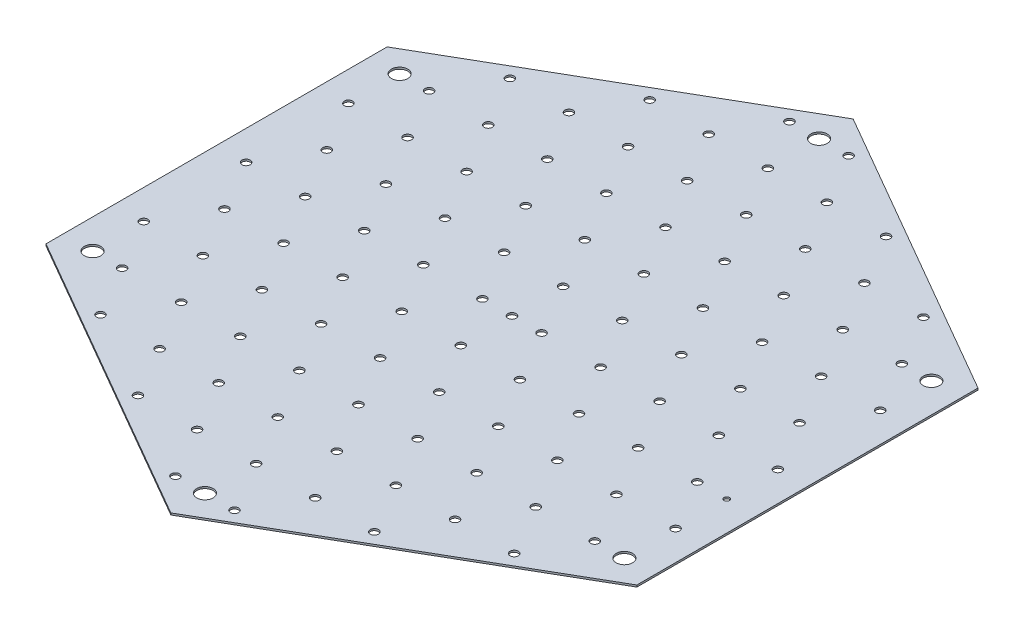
ISO-10303-21;
HEADER;
FILE_DESCRIPTION(('STEP AP214'),'2;1');
FILE_NAME('part.step','',(''),(''),'','','');
FILE_SCHEMA(('AUTOMOTIVE_DESIGN { 1 0 10303 214 1 1 1 1 }'));
ENDSEC;
DATA;
#1=APPLICATION_CONTEXT('core data for automotive mechanical design processes');
#2=APPLICATION_PROTOCOL_DEFINITION('international standard','automotive_design',2000,#1);
#3=PRODUCT_CONTEXT('',#1,'mechanical');
#4=PRODUCT('Part','Part','',(#3));
#5=PRODUCT_RELATED_PRODUCT_CATEGORY('part','',(#4));
#6=PRODUCT_DEFINITION_FORMATION('','',#4);
#7=PRODUCT_DEFINITION_CONTEXT('part definition',#1,'design');
#8=PRODUCT_DEFINITION('design','',#6,#7);
#9=PRODUCT_DEFINITION_SHAPE('','',#8);
#10=(LENGTH_UNIT() NAMED_UNIT(*) SI_UNIT(.MILLI.,.METRE.));
#11=(NAMED_UNIT(*) PLANE_ANGLE_UNIT() SI_UNIT($,.RADIAN.));
#12=(NAMED_UNIT(*) SI_UNIT($,.STERADIAN.) SOLID_ANGLE_UNIT());
#13=UNCERTAINTY_MEASURE_WITH_UNIT(LENGTH_MEASURE(1.E-05),#10,'distance_accuracy_value','');
#14=(GEOMETRIC_REPRESENTATION_CONTEXT(3) GLOBAL_UNCERTAINTY_ASSIGNED_CONTEXT((#13)) GLOBAL_UNIT_ASSIGNED_CONTEXT((#10,
#11,#12)) REPRESENTATION_CONTEXT('',''));
#15=CARTESIAN_POINT('',(0.,0.,0.));
#16=DIRECTION('',(0.,0.,1.));
#17=DIRECTION('',(1.,0.,0.));
#18=AXIS2_PLACEMENT_3D('',#15,#16,#17);
#19=CARTESIAN_POINT('',(54.1265877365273,0.34,-31.25));
#20=DIRECTION('',(-0.5,0.,0.866025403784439));
#21=DIRECTION('',(0.866025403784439,0.,0.5));
#22=AXIS2_PLACEMENT_3D('',#19,#20,#21);
#23=PLANE('',#22);
#24=DIRECTION('',(-0.866025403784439,0.,-0.5));
#25=VECTOR('',#24,1.);
#26=CARTESIAN_POINT('',(54.1265877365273,0.,-31.25));
#27=LINE('',#26,#25);
#28=CARTESIAN_POINT('',(54.1265877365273,0.,-31.25));
#29=VERTEX_POINT('',#28);
#30=CARTESIAN_POINT('',(0.,0.,-62.5));
#31=VERTEX_POINT('',#30);
#32=EDGE_CURVE('E117',#29,#31,#27,.T.);
#33=ORIENTED_EDGE('',*,*,#32,.T.);
#34=DIRECTION('',(0.,-1.,0.));
#35=VECTOR('',#34,1.);
#36=CARTESIAN_POINT('',(0.,0.34,-62.5));
#37=LINE('',#36,#35);
#38=CARTESIAN_POINT('',(0.,0.34,-62.5));
#39=VERTEX_POINT('',#38);
#40=EDGE_CURVE('E11',#39,#31,#37,.T.);
#41=ORIENTED_EDGE('',*,*,#40,.F.);
#42=DIRECTION('',(-0.866025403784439,0.,-0.5));
#43=VECTOR('',#42,1.);
#44=CARTESIAN_POINT('',(54.1265877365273,0.34,-31.25));
#45=LINE('',#44,#43);
#46=CARTESIAN_POINT('',(54.1265877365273,0.34,-31.25));
#47=VERTEX_POINT('',#46);
#48=EDGE_CURVE('E84',#47,#39,#45,.T.);
#49=ORIENTED_EDGE('',*,*,#48,.F.);
#50=DIRECTION('',(0.,-1.,0.));
#51=VECTOR('',#50,1.);
#52=CARTESIAN_POINT('',(54.1265877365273,0.34,-31.25));
#53=LINE('',#52,#51);
#54=EDGE_CURVE('E113',#47,#29,#53,.T.);
#55=ORIENTED_EDGE('',*,*,#54,.T.);
#56=EDGE_LOOP('',(#33,#41,#49,#55));
#57=FACE_BOUND('',#56,.T.);
#58=ADVANCED_FACE('F33',(#57),#23,.F.);
#59=CARTESIAN_POINT('',(0.,0.34,-62.5));
#60=DIRECTION('',(0.5,0.,0.866025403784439));
#61=DIRECTION('',(0.866025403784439,0.,-0.5));
#62=AXIS2_PLACEMENT_3D('',#59,#60,#61);
#63=PLANE('',#62);
#64=DIRECTION('',(0.,-1.,0.));
#65=VECTOR('',#64,1.);
#66=CARTESIAN_POINT('',(-54.1265877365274,0.34,-31.25));
#67=LINE('',#66,#65);
#68=CARTESIAN_POINT('',(-54.1265877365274,0.34,-31.25));
#69=VERTEX_POINT('',#68);
#70=CARTESIAN_POINT('',(-54.1265877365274,0.,-31.25));
#71=VERTEX_POINT('',#70);
#72=EDGE_CURVE('E41',#69,#71,#67,.T.);
#73=ORIENTED_EDGE('',*,*,#72,.F.);
#74=DIRECTION('',(-0.866025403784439,0.,0.5));
#75=VECTOR('',#74,1.);
#76=CARTESIAN_POINT('',(0.,0.34,-62.5));
#77=LINE('',#76,#75);
#78=EDGE_CURVE('E1874',#39,#69,#77,.T.);
#79=ORIENTED_EDGE('',*,*,#78,.F.);
#80=ORIENTED_EDGE('',*,*,#40,.T.);
#81=DIRECTION('',(-0.866025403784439,0.,0.5));
#82=VECTOR('',#81,1.);
#83=CARTESIAN_POINT('',(0.,0.,-62.5));
#84=LINE('',#83,#82);
#85=EDGE_CURVE('E119',#31,#71,#84,.T.);
#86=ORIENTED_EDGE('',*,*,#85,.T.);
#87=EDGE_LOOP('',(#73,#79,#80,#86));
#88=FACE_BOUND('',#87,.T.);
#89=ADVANCED_FACE('F154',(#88),#63,.F.);
#90=CARTESIAN_POINT('',(-54.1265877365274,0.34,-31.25));
#91=DIRECTION('',(1.,0.,0.));
#92=DIRECTION('',(0.,0.,-1.));
#93=AXIS2_PLACEMENT_3D('',#90,#91,#92);
#94=PLANE('',#93);
#95=DIRECTION('',(0.,0.,1.));
#96=VECTOR('',#95,1.);
#97=CARTESIAN_POINT('',(-54.1265877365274,0.,-31.25));
#98=LINE('',#97,#96);
#99=CARTESIAN_POINT('',(-54.1265877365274,0.,31.25));
#100=VERTEX_POINT('',#99);
#101=EDGE_CURVE('E122',#71,#100,#98,.T.);
#102=ORIENTED_EDGE('',*,*,#101,.T.);
#103=DIRECTION('',(0.,-1.,0.));
#104=VECTOR('',#103,1.);
#105=CARTESIAN_POINT('',(-54.1265877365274,0.34,31.25));
#106=LINE('',#105,#104);
#107=CARTESIAN_POINT('',(-54.1265877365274,0.34,31.25));
#108=VERTEX_POINT('',#107);
#109=EDGE_CURVE('E108',#108,#100,#106,.T.);
#110=ORIENTED_EDGE('',*,*,#109,.F.);
#111=DIRECTION('',(0.,0.,1.));
#112=VECTOR('',#111,1.);
#113=CARTESIAN_POINT('',(-54.1265877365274,0.34,-31.25));
#114=LINE('',#113,#112);
#115=EDGE_CURVE('E99',#69,#108,#114,.T.);
#116=ORIENTED_EDGE('',*,*,#115,.F.);
#117=ORIENTED_EDGE('',*,*,#72,.T.);
#118=EDGE_LOOP('',(#102,#110,#116,#117));
#119=FACE_BOUND('',#118,.T.);
#120=ADVANCED_FACE('F133',(#119),#94,.F.);
#121=CARTESIAN_POINT('',(-54.1265877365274,0.34,31.25));
#122=DIRECTION('',(0.5,0.,-0.866025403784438));
#123=DIRECTION('',(-0.866025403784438,0.,-0.5));
#124=AXIS2_PLACEMENT_3D('',#121,#122,#123);
#125=PLANE('',#124);
#126=DIRECTION('',(0.866025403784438,0.,0.5));
#127=VECTOR('',#126,1.);
#128=CARTESIAN_POINT('',(-54.1265877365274,0.,31.25));
#129=LINE('',#128,#127);
#130=CARTESIAN_POINT('',(0.,0.,62.5));
#131=VERTEX_POINT('',#130);
#132=EDGE_CURVE('E107',#100,#131,#129,.T.);
#133=ORIENTED_EDGE('',*,*,#132,.T.);
#134=DIRECTION('',(0.,-1.,0.));
#135=VECTOR('',#134,1.);
#136=CARTESIAN_POINT('',(0.,0.34,62.5));
#137=LINE('',#136,#135);
#138=CARTESIAN_POINT('',(0.,0.34,62.5));
#139=VERTEX_POINT('',#138);
#140=EDGE_CURVE('E104',#139,#131,#137,.T.);
#141=ORIENTED_EDGE('',*,*,#140,.F.);
#142=DIRECTION('',(0.866025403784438,0.,0.5));
#143=VECTOR('',#142,1.);
#144=CARTESIAN_POINT('',(-54.1265877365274,0.34,31.25));
#145=LINE('',#144,#143);
#146=EDGE_CURVE('E92',#108,#139,#145,.T.);
#147=ORIENTED_EDGE('',*,*,#146,.F.);
#148=ORIENTED_EDGE('',*,*,#109,.T.);
#149=EDGE_LOOP('',(#133,#141,#147,#148));
#150=FACE_BOUND('',#149,.T.);
#151=ADVANCED_FACE('F105',(#150),#125,.F.);
#152=CARTESIAN_POINT('',(0.,0.34,62.5));
#153=DIRECTION('',(-0.5,0.,-0.866025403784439));
#154=DIRECTION('',(-0.866025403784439,0.,0.5));
#155=AXIS2_PLACEMENT_3D('',#152,#153,#154);
#156=PLANE('',#155);
#157=DIRECTION('',(0.866025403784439,0.,-0.5));
#158=VECTOR('',#157,1.);
#159=CARTESIAN_POINT('',(0.,0.,62.5));
#160=LINE('',#159,#158);
#161=CARTESIAN_POINT('',(54.1265877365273,0.,31.25));
#162=VERTEX_POINT('',#161);
#163=EDGE_CURVE('E72',#131,#162,#160,.T.);
#164=ORIENTED_EDGE('',*,*,#163,.T.);
#165=DIRECTION('',(0.,-1.,0.));
#166=VECTOR('',#165,1.);
#167=CARTESIAN_POINT('',(54.1265877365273,0.34,31.25));
#168=LINE('',#167,#166);
#169=CARTESIAN_POINT('',(54.1265877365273,0.34,31.25));
#170=VERTEX_POINT('',#169);
#171=EDGE_CURVE('E109',#170,#162,#168,.T.);
#172=ORIENTED_EDGE('',*,*,#171,.F.);
#173=DIRECTION('',(0.866025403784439,0.,-0.5));
#174=VECTOR('',#173,1.);
#175=CARTESIAN_POINT('',(0.,0.34,62.5));
#176=LINE('',#175,#174);
#177=EDGE_CURVE('E97',#139,#170,#176,.T.);
#178=ORIENTED_EDGE('',*,*,#177,.F.);
#179=ORIENTED_EDGE('',*,*,#140,.T.);
#180=EDGE_LOOP('',(#164,#172,#178,#179));
#181=FACE_BOUND('',#180,.T.);
#182=ADVANCED_FACE('F111',(#181),#156,.F.);
#183=CARTESIAN_POINT('',(54.1265877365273,0.34,31.25));
#184=DIRECTION('',(-1.,0.,0.));
#185=DIRECTION('',(0.,0.,1.));
#186=AXIS2_PLACEMENT_3D('',#183,#184,#185);
#187=PLANE('',#186);
#188=ORIENTED_EDGE('',*,*,#54,.F.);
#189=DIRECTION('',(0.,0.,-1.));
#190=VECTOR('',#189,1.);
#191=CARTESIAN_POINT('',(54.1265877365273,0.34,31.25));
#192=LINE('',#191,#190);
#193=EDGE_CURVE('E49',#170,#47,#192,.T.);
#194=ORIENTED_EDGE('',*,*,#193,.F.);
#195=ORIENTED_EDGE('',*,*,#171,.T.);
#196=DIRECTION('',(0.,0.,-1.));
#197=VECTOR('',#196,1.);
#198=CARTESIAN_POINT('',(54.1265877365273,0.,31.25));
#199=LINE('',#198,#197);
#200=EDGE_CURVE('E78',#162,#29,#199,.T.);
#201=ORIENTED_EDGE('',*,*,#200,.T.);
#202=EDGE_LOOP('',(#188,#194,#195,#201));
#203=FACE_BOUND('',#202,.T.);
#204=ADVANCED_FACE('F142',(#203),#187,.F.);
#205=CARTESIAN_POINT('',(0.,0.34,0.));
#206=DIRECTION('',(0.,1.,0.));
#207=DIRECTION('',(0.,0.,1.));
#208=AXIS2_PLACEMENT_3D('',#205,#206,#207);
#209=PLANE('',#208);
#210=CARTESIAN_POINT('',(48.71385,0.34,9.37498480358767));
#211=DIRECTION('',(0.,1.,0.));
#212=DIRECTION('',(0.,0.,1.));
#213=AXIS2_PLACEMENT_3D('',#210,#211,#212);
#214=CIRCLE('',#213,0.499999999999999);
#215=CARTESIAN_POINT('',(48.71385,0.34,9.87498480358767));
#216=VERTEX_POINT('',#215);
#217=EDGE_CURVE('E1252',#216,#216,#214,.T.);
#218=ORIENTED_EDGE('',*,*,#217,.F.);
#219=EDGE_LOOP('',(#218));
#220=FACE_BOUND('',#219,.T.);
#221=CARTESIAN_POINT('',(48.71385,0.34,-18.7499696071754));
#222=DIRECTION('',(0.,1.,0.));
#223=DIRECTION('',(0.,0.,1.));
#224=AXIS2_PLACEMENT_3D('',#221,#222,#223);
#225=CIRCLE('',#224,0.749999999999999);
#226=CARTESIAN_POINT('',(48.71385,0.34,-17.9999696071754));
#227=VERTEX_POINT('',#226);
#228=EDGE_CURVE('E1254',#227,#227,#225,.T.);
#229=ORIENTED_EDGE('',*,*,#228,.F.);
#230=EDGE_LOOP('',(#229));
#231=FACE_BOUND('',#230,.T.);
#232=CARTESIAN_POINT('',(43.3012,0.34,-28.1249544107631));
#233=DIRECTION('',(0.,1.,0.));
#234=DIRECTION('',(0.,0.,1.));
#235=AXIS2_PLACEMENT_3D('',#232,#233,#234);
#236=CIRCLE('',#235,0.750000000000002);
#237=CARTESIAN_POINT('',(43.3012,0.34,-27.3749544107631));
#238=VERTEX_POINT('',#237);
#239=EDGE_CURVE('E1260',#238,#238,#236,.T.);
#240=ORIENTED_EDGE('',*,*,#239,.F.);
#241=EDGE_LOOP('',(#240));
#242=FACE_BOUND('',#241,.T.);
#243=CARTESIAN_POINT('',(37.88855,0.34,-37.4999392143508));
#244=DIRECTION('',(0.,1.,0.));
#245=DIRECTION('',(0.,0.,1.));
#246=AXIS2_PLACEMENT_3D('',#243,#244,#245);
#247=CIRCLE('',#246,0.750000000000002);
#248=CARTESIAN_POINT('',(37.88855,0.34,-36.7499392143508));
#249=VERTEX_POINT('',#248);
#250=EDGE_CURVE('E1266',#249,#249,#247,.T.);
#251=ORIENTED_EDGE('',*,*,#250,.F.);
#252=EDGE_LOOP('',(#251));
#253=FACE_BOUND('',#252,.T.);
#254=CARTESIAN_POINT('',(-21.6506,0.34,46.8749240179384));
#255=DIRECTION('',(0.,1.,0.));
#256=DIRECTION('',(0.,0.,1.));
#257=AXIS2_PLACEMENT_3D('',#254,#255,#256);
#258=CIRCLE('',#257,0.749999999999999);
#259=CARTESIAN_POINT('',(-21.6506,0.34,47.6249240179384));
#260=VERTEX_POINT('',#259);
#261=EDGE_CURVE('E1272',#260,#260,#258,.T.);
#262=ORIENTED_EDGE('',*,*,#261,.F.);
#263=EDGE_LOOP('',(#262));
#264=FACE_BOUND('',#263,.T.);
#265=CARTESIAN_POINT('',(-5.41265000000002,0.34,56.2499088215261));
#266=DIRECTION('',(0.,1.,0.));
#267=DIRECTION('',(0.,0.,1.));
#268=AXIS2_PLACEMENT_3D('',#265,#266,#267);
#269=CIRCLE('',#268,0.749999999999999);
#270=CARTESIAN_POINT('',(-5.41265000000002,0.34,56.9999088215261));
#271=VERTEX_POINT('',#270);
#272=EDGE_CURVE('E1278',#271,#271,#269,.T.);
#273=ORIENTED_EDGE('',*,*,#272,.F.);
#274=EDGE_LOOP('',(#273));
#275=FACE_BOUND('',#274,.T.);
#276=CARTESIAN_POINT('',(-10.8253,0.34,46.8749240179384));
#277=DIRECTION('',(0.,1.,0.));
#278=DIRECTION('',(0.,0.,1.));
#279=AXIS2_PLACEMENT_3D('',#276,#277,#278);
#280=CIRCLE('',#279,0.749999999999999);
#281=CARTESIAN_POINT('',(-10.8253,0.34,47.6249240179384));
#282=VERTEX_POINT('',#281);
#283=EDGE_CURVE('E1284',#282,#282,#280,.T.);
#284=ORIENTED_EDGE('',*,*,#283,.F.);
#285=EDGE_LOOP('',(#284));
#286=FACE_BOUND('',#285,.T.);
#287=CARTESIAN_POINT('',(-16.23795,0.34,37.4999392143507));
#288=DIRECTION('',(0.,1.,0.));
#289=DIRECTION('',(0.,0.,1.));
#290=AXIS2_PLACEMENT_3D('',#287,#288,#289);
#291=CIRCLE('',#290,0.749999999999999);
#292=CARTESIAN_POINT('',(-16.23795,0.34,38.2499392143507));
#293=VERTEX_POINT('',#292);
#294=EDGE_CURVE('E1290',#293,#293,#291,.T.);
#295=ORIENTED_EDGE('',*,*,#294,.F.);
#296=EDGE_LOOP('',(#295));
#297=FACE_BOUND('',#296,.T.);
#298=CARTESIAN_POINT('',(-48.71385,0.34,-18.7499696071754));
#299=DIRECTION('',(0.,1.,0.));
#300=DIRECTION('',(0.,0.,1.));
#301=AXIS2_PLACEMENT_3D('',#298,#299,#300);
#302=CIRCLE('',#301,0.749999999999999);
#303=CARTESIAN_POINT('',(-48.71385,0.34,-17.9999696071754));
#304=VERTEX_POINT('',#303);
#305=EDGE_CURVE('E1296',#304,#304,#302,.T.);
#306=ORIENTED_EDGE('',*,*,#305,.F.);
#307=EDGE_LOOP('',(#306));
#308=FACE_BOUND('',#307,.T.);
#309=CARTESIAN_POINT('',(5.41264999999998,0.34,56.2499088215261));
#310=DIRECTION('',(0.,1.,0.));
#311=DIRECTION('',(0.,0.,1.));
#312=AXIS2_PLACEMENT_3D('',#309,#310,#311);
#313=CIRCLE('',#312,0.750000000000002);
#314=CARTESIAN_POINT('',(5.41264999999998,0.34,56.9999088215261));
#315=VERTEX_POINT('',#314);
#316=EDGE_CURVE('E1302',#315,#315,#313,.T.);
#317=ORIENTED_EDGE('',*,*,#316,.F.);
#318=EDGE_LOOP('',(#317));
#319=FACE_BOUND('',#318,.T.);
#320=CARTESIAN_POINT('',(0.,0.34,46.8749240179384));
#321=DIRECTION('',(0.,1.,0.));
#322=DIRECTION('',(0.,0.,1.));
#323=AXIS2_PLACEMENT_3D('',#320,#321,#322);
#324=CIRCLE('',#323,0.750000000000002);
#325=CARTESIAN_POINT('',(0.,0.34,47.6249240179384));
#326=VERTEX_POINT('',#325);
#327=EDGE_CURVE('E1308',#326,#326,#324,.T.);
#328=ORIENTED_EDGE('',*,*,#327,.F.);
#329=EDGE_LOOP('',(#328));
#330=FACE_BOUND('',#329,.T.);
#331=CARTESIAN_POINT('',(-5.41265000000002,0.34,37.4999392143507));
#332=DIRECTION('',(0.,1.,0.));
#333=DIRECTION('',(0.,0.,1.));
#334=AXIS2_PLACEMENT_3D('',#331,#332,#333);
#335=CIRCLE('',#334,0.750000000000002);
#336=CARTESIAN_POINT('',(-5.41265000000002,0.34,38.2499392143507));
#337=VERTEX_POINT('',#336);
#338=EDGE_CURVE('E1314',#337,#337,#335,.T.);
#339=ORIENTED_EDGE('',*,*,#338,.F.);
#340=EDGE_LOOP('',(#339));
#341=FACE_BOUND('',#340,.T.);
#342=CARTESIAN_POINT('',(-10.8253,0.34,28.124954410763));
#343=DIRECTION('',(0.,1.,0.));
#344=DIRECTION('',(0.,0.,1.));
#345=AXIS2_PLACEMENT_3D('',#342,#343,#344);
#346=CIRCLE('',#345,0.750000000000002);
#347=CARTESIAN_POINT('',(-10.8253,0.34,28.874954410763));
#348=VERTEX_POINT('',#347);
#349=EDGE_CURVE('E1320',#348,#348,#346,.T.);
#350=ORIENTED_EDGE('',*,*,#349,.F.);
#351=EDGE_LOOP('',(#350));
#352=FACE_BOUND('',#351,.T.);
#353=CARTESIAN_POINT('',(-43.3012,0.34,-28.1249544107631));
#354=DIRECTION('',(0.,1.,0.));
#355=DIRECTION('',(0.,0.,1.));
#356=AXIS2_PLACEMENT_3D('',#353,#354,#355);
#357=CIRCLE('',#356,0.750000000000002);
#358=CARTESIAN_POINT('',(-43.3012,0.34,-27.3749544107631));
#359=VERTEX_POINT('',#358);
#360=EDGE_CURVE('E1326',#359,#359,#357,.T.);
#361=ORIENTED_EDGE('',*,*,#360,.F.);
#362=EDGE_LOOP('',(#361));
#363=FACE_BOUND('',#362,.T.);
#364=CARTESIAN_POINT('',(10.8253,0.34,46.8749240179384));
#365=DIRECTION('',(0.,1.,0.));
#366=DIRECTION('',(0.,0.,1.));
#367=AXIS2_PLACEMENT_3D('',#364,#365,#366);
#368=CIRCLE('',#367,0.75);
#369=CARTESIAN_POINT('',(10.8253,0.34,47.6249240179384));
#370=VERTEX_POINT('',#369);
#371=EDGE_CURVE('E1332',#370,#370,#368,.T.);
#372=ORIENTED_EDGE('',*,*,#371,.F.);
#373=EDGE_LOOP('',(#372));
#374=FACE_BOUND('',#373,.T.);
#375=CARTESIAN_POINT('',(5.41264999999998,0.34,37.4999392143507));
#376=DIRECTION('',(0.,1.,0.));
#377=DIRECTION('',(0.,0.,1.));
#378=AXIS2_PLACEMENT_3D('',#375,#376,#377);
#379=CIRCLE('',#378,0.75);
#380=CARTESIAN_POINT('',(5.41264999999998,0.34,38.2499392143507));
#381=VERTEX_POINT('',#380);
#382=EDGE_CURVE('E1338',#381,#381,#379,.T.);
#383=ORIENTED_EDGE('',*,*,#382,.F.);
#384=EDGE_LOOP('',(#383));
#385=FACE_BOUND('',#384,.T.);
#386=CARTESIAN_POINT('',(0.,0.34,28.124954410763));
#387=DIRECTION('',(0.,1.,0.));
#388=DIRECTION('',(0.,0.,1.));
#389=AXIS2_PLACEMENT_3D('',#386,#387,#388);
#390=CIRCLE('',#389,0.75);
#391=CARTESIAN_POINT('',(0.,0.34,28.874954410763));
#392=VERTEX_POINT('',#391);
#393=EDGE_CURVE('E1344',#392,#392,#390,.T.);
#394=ORIENTED_EDGE('',*,*,#393,.F.);
#395=EDGE_LOOP('',(#394));
#396=FACE_BOUND('',#395,.T.);
#397=CARTESIAN_POINT('',(-5.41265000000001,0.34,18.7499696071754));
#398=DIRECTION('',(0.,1.,0.));
#399=DIRECTION('',(0.,0.,1.));
#400=AXIS2_PLACEMENT_3D('',#397,#398,#399);
#401=CIRCLE('',#400,0.75);
#402=CARTESIAN_POINT('',(-5.41265000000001,0.34,19.4999696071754));
#403=VERTEX_POINT('',#402);
#404=EDGE_CURVE('E1350',#403,#403,#401,.T.);
#405=ORIENTED_EDGE('',*,*,#404,.F.);
#406=EDGE_LOOP('',(#405));
#407=FACE_BOUND('',#406,.T.);
#408=CARTESIAN_POINT('',(-37.88855,0.34,-37.4999392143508));
#409=DIRECTION('',(0.,1.,0.));
#410=DIRECTION('',(0.,0.,1.));
#411=AXIS2_PLACEMENT_3D('',#408,#409,#410);
#412=CIRCLE('',#411,0.75);
#413=CARTESIAN_POINT('',(-37.88855,0.34,-36.7499392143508));
#414=VERTEX_POINT('',#413);
#415=EDGE_CURVE('E1356',#414,#414,#412,.T.);
#416=ORIENTED_EDGE('',*,*,#415,.F.);
#417=EDGE_LOOP('',(#416));
#418=FACE_BOUND('',#417,.T.);
#419=CARTESIAN_POINT('',(21.6506,0.34,46.8749240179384));
#420=DIRECTION('',(0.,1.,0.));
#421=DIRECTION('',(0.,0.,1.));
#422=AXIS2_PLACEMENT_3D('',#419,#420,#421);
#423=CIRCLE('',#422,0.75);
#424=CARTESIAN_POINT('',(21.6506,0.34,47.6249240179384));
#425=VERTEX_POINT('',#424);
#426=EDGE_CURVE('E1362',#425,#425,#423,.T.);
#427=ORIENTED_EDGE('',*,*,#426,.F.);
#428=EDGE_LOOP('',(#427));
#429=FACE_BOUND('',#428,.T.);
#430=CARTESIAN_POINT('',(16.23795,0.34,37.4999392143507));
#431=DIRECTION('',(0.,1.,0.));
#432=DIRECTION('',(0.,0.,1.));
#433=AXIS2_PLACEMENT_3D('',#430,#431,#432);
#434=CIRCLE('',#433,0.75);
#435=CARTESIAN_POINT('',(16.23795,0.34,38.2499392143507));
#436=VERTEX_POINT('',#435);
#437=EDGE_CURVE('E1368',#436,#436,#434,.T.);
#438=ORIENTED_EDGE('',*,*,#437,.F.);
#439=EDGE_LOOP('',(#438));
#440=FACE_BOUND('',#439,.T.);
#441=CARTESIAN_POINT('',(10.8253,0.34,28.124954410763));
#442=DIRECTION('',(0.,1.,0.));
#443=DIRECTION('',(0.,0.,1.));
#444=AXIS2_PLACEMENT_3D('',#441,#442,#443);
#445=CIRCLE('',#444,0.75);
#446=CARTESIAN_POINT('',(10.8253,0.34,28.874954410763));
#447=VERTEX_POINT('',#446);
#448=EDGE_CURVE('E1374',#447,#447,#445,.T.);
#449=ORIENTED_EDGE('',*,*,#448,.F.);
#450=EDGE_LOOP('',(#449));
#451=FACE_BOUND('',#450,.T.);
#452=CARTESIAN_POINT('',(5.41264999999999,0.34,18.7499696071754));
#453=DIRECTION('',(0.,1.,0.));
#454=DIRECTION('',(0.,0.,1.));
#455=AXIS2_PLACEMENT_3D('',#452,#453,#454);
#456=CIRCLE('',#455,0.75);
#457=CARTESIAN_POINT('',(5.41264999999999,0.34,19.4999696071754));
#458=VERTEX_POINT('',#457);
#459=EDGE_CURVE('E1380',#458,#458,#456,.T.);
#460=ORIENTED_EDGE('',*,*,#459,.F.);
#461=EDGE_LOOP('',(#460));
#462=FACE_BOUND('',#461,.T.);
#463=CARTESIAN_POINT('',(0.,0.34,9.37498480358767));
#464=DIRECTION('',(0.,1.,0.));
#465=DIRECTION('',(0.,0.,1.));
#466=AXIS2_PLACEMENT_3D('',#463,#464,#465);
#467=CIRCLE('',#466,0.75);
#468=CARTESIAN_POINT('',(0.,0.34,10.1249848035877));
#469=VERTEX_POINT('',#468);
#470=EDGE_CURVE('E1386',#469,#469,#467,.T.);
#471=ORIENTED_EDGE('',*,*,#470,.F.);
#472=EDGE_LOOP('',(#471));
#473=FACE_BOUND('',#472,.T.);
#474=CARTESIAN_POINT('',(-27.06325,0.34,-37.4999392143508));
#475=DIRECTION('',(0.,1.,0.));
#476=DIRECTION('',(0.,0.,1.));
#477=AXIS2_PLACEMENT_3D('',#474,#475,#476);
#478=CIRCLE('',#477,0.749999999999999);
#479=CARTESIAN_POINT('',(-27.06325,0.34,-36.7499392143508));
#480=VERTEX_POINT('',#479);
#481=EDGE_CURVE('E1392',#480,#480,#478,.T.);
#482=ORIENTED_EDGE('',*,*,#481,.F.);
#483=EDGE_LOOP('',(#482));
#484=FACE_BOUND('',#483,.T.);
#485=CARTESIAN_POINT('',(-32.4759,0.34,-28.1249544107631));
#486=DIRECTION('',(0.,1.,0.));
#487=DIRECTION('',(0.,0.,1.));
#488=AXIS2_PLACEMENT_3D('',#485,#486,#487);
#489=CIRCLE('',#488,0.749999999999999);
#490=CARTESIAN_POINT('',(-32.4759,0.34,-27.3749544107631));
#491=VERTEX_POINT('',#490);
#492=EDGE_CURVE('E1398',#491,#491,#489,.T.);
#493=ORIENTED_EDGE('',*,*,#492,.F.);
#494=EDGE_LOOP('',(#493));
#495=FACE_BOUND('',#494,.T.);
#496=CARTESIAN_POINT('',(-37.88855,0.34,-18.7499696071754));
#497=DIRECTION('',(0.,1.,0.));
#498=DIRECTION('',(0.,0.,1.));
#499=AXIS2_PLACEMENT_3D('',#496,#497,#498);
#500=CIRCLE('',#499,0.749999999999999);
#501=CARTESIAN_POINT('',(-37.88855,0.34,-17.9999696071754));
#502=VERTEX_POINT('',#501);
#503=EDGE_CURVE('E1404',#502,#502,#500,.T.);
#504=ORIENTED_EDGE('',*,*,#503,.F.);
#505=EDGE_LOOP('',(#504));
#506=FACE_BOUND('',#505,.T.);
#507=CARTESIAN_POINT('',(-43.3012,0.34,-9.3749848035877));
#508=DIRECTION('',(0.,1.,0.));
#509=DIRECTION('',(0.,0.,1.));
#510=AXIS2_PLACEMENT_3D('',#507,#508,#509);
#511=CIRCLE('',#510,0.749999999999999);
#512=CARTESIAN_POINT('',(-43.3012,0.34,-8.6249848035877));
#513=VERTEX_POINT('',#512);
#514=EDGE_CURVE('E1410',#513,#513,#511,.T.);
#515=ORIENTED_EDGE('',*,*,#514,.F.);
#516=EDGE_LOOP('',(#515));
#517=FACE_BOUND('',#516,.T.);
#518=CARTESIAN_POINT('',(-21.6506,0.34,-28.1249544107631));
#519=DIRECTION('',(0.,1.,0.));
#520=DIRECTION('',(0.,0.,1.));
#521=AXIS2_PLACEMENT_3D('',#518,#519,#520);
#522=CIRCLE('',#521,0.749999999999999);
#523=CARTESIAN_POINT('',(-21.6506,0.34,-27.3749544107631));
#524=VERTEX_POINT('',#523);
#525=EDGE_CURVE('E1416',#524,#524,#522,.T.);
#526=ORIENTED_EDGE('',*,*,#525,.F.);
#527=EDGE_LOOP('',(#526));
#528=FACE_BOUND('',#527,.T.);
#529=CARTESIAN_POINT('',(-27.06325,0.34,-18.7499696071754));
#530=DIRECTION('',(0.,1.,0.));
#531=DIRECTION('',(0.,0.,1.));
#532=AXIS2_PLACEMENT_3D('',#529,#530,#531);
#533=CIRCLE('',#532,0.749999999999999);
#534=CARTESIAN_POINT('',(-27.06325,0.34,-17.9999696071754));
#535=VERTEX_POINT('',#534);
#536=EDGE_CURVE('E1422',#535,#535,#533,.T.);
#537=ORIENTED_EDGE('',*,*,#536,.F.);
#538=EDGE_LOOP('',(#537));
#539=FACE_BOUND('',#538,.T.);
#540=CARTESIAN_POINT('',(-32.4759,0.34,-9.3749848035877));
#541=DIRECTION('',(0.,1.,0.));
#542=DIRECTION('',(0.,0.,1.));
#543=AXIS2_PLACEMENT_3D('',#540,#541,#542);
#544=CIRCLE('',#543,0.749999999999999);
#545=CARTESIAN_POINT('',(-32.4759,0.34,-8.6249848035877));
#546=VERTEX_POINT('',#545);
#547=EDGE_CURVE('E1428',#546,#546,#544,.T.);
#548=ORIENTED_EDGE('',*,*,#547,.F.);
#549=EDGE_LOOP('',(#548));
#550=FACE_BOUND('',#549,.T.);
#551=CARTESIAN_POINT('',(-48.71385,0.34,18.7499696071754));
#552=DIRECTION('',(0.,1.,0.));
#553=DIRECTION('',(0.,0.,1.));
#554=AXIS2_PLACEMENT_3D('',#551,#552,#553);
#555=CIRCLE('',#554,0.749999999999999);
#556=CARTESIAN_POINT('',(-48.71385,0.34,19.4999696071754));
#557=VERTEX_POINT('',#556);
#558=EDGE_CURVE('E1434',#557,#557,#555,.T.);
#559=ORIENTED_EDGE('',*,*,#558,.F.);
#560=EDGE_LOOP('',(#559));
#561=FACE_BOUND('',#560,.T.);
#562=CARTESIAN_POINT('',(-43.3012,0.34,9.37498480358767));
#563=DIRECTION('',(0.,1.,0.));
#564=DIRECTION('',(0.,0.,1.));
#565=AXIS2_PLACEMENT_3D('',#562,#563,#564);
#566=CIRCLE('',#565,0.749999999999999);
#567=CARTESIAN_POINT('',(-43.3012,0.34,10.1249848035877));
#568=VERTEX_POINT('',#567);
#569=EDGE_CURVE('E1440',#568,#568,#566,.T.);
#570=ORIENTED_EDGE('',*,*,#569,.F.);
#571=EDGE_LOOP('',(#570));
#572=FACE_BOUND('',#571,.T.);
#573=CARTESIAN_POINT('',(-43.3012,0.34,28.124954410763));
#574=DIRECTION('',(0.,1.,0.));
#575=DIRECTION('',(0.,0.,1.));
#576=AXIS2_PLACEMENT_3D('',#573,#574,#575);
#577=CIRCLE('',#576,0.750000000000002);
#578=CARTESIAN_POINT('',(-43.3012,0.34,28.874954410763));
#579=VERTEX_POINT('',#578);
#580=EDGE_CURVE('E1446',#579,#579,#577,.T.);
#581=ORIENTED_EDGE('',*,*,#580,.F.);
#582=EDGE_LOOP('',(#581));
#583=FACE_BOUND('',#582,.T.);
#584=CARTESIAN_POINT('',(-37.88855,0.34,18.7499696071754));
#585=DIRECTION('',(0.,1.,0.));
#586=DIRECTION('',(0.,0.,1.));
#587=AXIS2_PLACEMENT_3D('',#584,#585,#586);
#588=CIRCLE('',#587,0.750000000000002);
#589=CARTESIAN_POINT('',(-37.88855,0.34,19.4999696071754));
#590=VERTEX_POINT('',#589);
#591=EDGE_CURVE('E1452',#590,#590,#588,.T.);
#592=ORIENTED_EDGE('',*,*,#591,.F.);
#593=EDGE_LOOP('',(#592));
#594=FACE_BOUND('',#593,.T.);
#595=CARTESIAN_POINT('',(-32.4759,0.34,9.37498480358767));
#596=DIRECTION('',(0.,1.,0.));
#597=DIRECTION('',(0.,0.,1.));
#598=AXIS2_PLACEMENT_3D('',#595,#596,#597);
#599=CIRCLE('',#598,0.750000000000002);
#600=CARTESIAN_POINT('',(-32.4759,0.34,10.1249848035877));
#601=VERTEX_POINT('',#600);
#602=EDGE_CURVE('E1458',#601,#601,#599,.T.);
#603=ORIENTED_EDGE('',*,*,#602,.F.);
#604=EDGE_LOOP('',(#603));
#605=FACE_BOUND('',#604,.T.);
#606=CARTESIAN_POINT('',(-16.23795,0.34,-18.7499696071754));
#607=DIRECTION('',(0.,1.,0.));
#608=DIRECTION('',(0.,0.,1.));
#609=AXIS2_PLACEMENT_3D('',#606,#607,#608);
#610=CIRCLE('',#609,0.750000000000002);
#611=CARTESIAN_POINT('',(-16.23795,0.34,-17.9999696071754));
#612=VERTEX_POINT('',#611);
#613=EDGE_CURVE('E1464',#612,#612,#610,.T.);
#614=ORIENTED_EDGE('',*,*,#613,.F.);
#615=EDGE_LOOP('',(#614));
#616=FACE_BOUND('',#615,.T.);
#617=CARTESIAN_POINT('',(-21.6506,0.34,-9.3749848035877));
#618=DIRECTION('',(0.,1.,0.));
#619=DIRECTION('',(0.,0.,1.));
#620=AXIS2_PLACEMENT_3D('',#617,#618,#619);
#621=CIRCLE('',#620,0.750000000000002);
#622=CARTESIAN_POINT('',(-21.6506,0.34,-8.6249848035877));
#623=VERTEX_POINT('',#622);
#624=EDGE_CURVE('E1470',#623,#623,#621,.T.);
#625=ORIENTED_EDGE('',*,*,#624,.F.);
#626=EDGE_LOOP('',(#625));
#627=FACE_BOUND('',#626,.T.);
#628=CARTESIAN_POINT('',(-37.88855,0.34,37.4999392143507));
#629=DIRECTION('',(0.,1.,0.));
#630=DIRECTION('',(0.,0.,1.));
#631=AXIS2_PLACEMENT_3D('',#628,#629,#630);
#632=CIRCLE('',#631,0.75);
#633=CARTESIAN_POINT('',(-37.88855,0.34,38.2499392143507));
#634=VERTEX_POINT('',#633);
#635=EDGE_CURVE('E1476',#634,#634,#632,.T.);
#636=ORIENTED_EDGE('',*,*,#635,.F.);
#637=EDGE_LOOP('',(#636));
#638=FACE_BOUND('',#637,.T.);
#639=CARTESIAN_POINT('',(-32.4759,0.34,28.124954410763));
#640=DIRECTION('',(0.,1.,0.));
#641=DIRECTION('',(0.,0.,1.));
#642=AXIS2_PLACEMENT_3D('',#639,#640,#641);
#643=CIRCLE('',#642,0.75);
#644=CARTESIAN_POINT('',(-32.4759,0.34,28.874954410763));
#645=VERTEX_POINT('',#644);
#646=EDGE_CURVE('E1482',#645,#645,#643,.T.);
#647=ORIENTED_EDGE('',*,*,#646,.F.);
#648=EDGE_LOOP('',(#647));
#649=FACE_BOUND('',#648,.T.);
#650=CARTESIAN_POINT('',(-27.06325,0.34,18.7499696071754));
#651=DIRECTION('',(0.,1.,0.));
#652=DIRECTION('',(0.,0.,1.));
#653=AXIS2_PLACEMENT_3D('',#650,#651,#652);
#654=CIRCLE('',#653,0.75);
#655=CARTESIAN_POINT('',(-27.06325,0.34,19.4999696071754));
#656=VERTEX_POINT('',#655);
#657=EDGE_CURVE('E1488',#656,#656,#654,.T.);
#658=ORIENTED_EDGE('',*,*,#657,.F.);
#659=EDGE_LOOP('',(#658));
#660=FACE_BOUND('',#659,.T.);
#661=CARTESIAN_POINT('',(-21.6506,0.34,9.37498480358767));
#662=DIRECTION('',(0.,1.,0.));
#663=DIRECTION('',(0.,0.,1.));
#664=AXIS2_PLACEMENT_3D('',#661,#662,#663);
#665=CIRCLE('',#664,0.75);
#666=CARTESIAN_POINT('',(-21.6506,0.34,10.1249848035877));
#667=VERTEX_POINT('',#666);
#668=EDGE_CURVE('E1494',#667,#667,#665,.T.);
#669=ORIENTED_EDGE('',*,*,#668,.F.);
#670=EDGE_LOOP('',(#669));
#671=FACE_BOUND('',#670,.T.);
#672=CARTESIAN_POINT('',(-10.8253,0.34,-9.3749848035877));
#673=DIRECTION('',(0.,1.,0.));
#674=DIRECTION('',(0.,0.,1.));
#675=AXIS2_PLACEMENT_3D('',#672,#673,#674);
#676=CIRCLE('',#675,0.75);
#677=CARTESIAN_POINT('',(-10.8253,0.34,-8.6249848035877));
#678=VERTEX_POINT('',#677);
#679=EDGE_CURVE('E1500',#678,#678,#676,.T.);
#680=ORIENTED_EDGE('',*,*,#679,.F.);
#681=EDGE_LOOP('',(#680));
#682=FACE_BOUND('',#681,.T.);
#683=CARTESIAN_POINT('',(-27.06325,0.34,37.4999392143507));
#684=DIRECTION('',(0.,1.,0.));
#685=DIRECTION('',(0.,0.,1.));
#686=AXIS2_PLACEMENT_3D('',#683,#684,#685);
#687=CIRCLE('',#686,0.75);
#688=CARTESIAN_POINT('',(-27.06325,0.34,38.2499392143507));
#689=VERTEX_POINT('',#688);
#690=EDGE_CURVE('E1506',#689,#689,#687,.T.);
#691=ORIENTED_EDGE('',*,*,#690,.F.);
#692=EDGE_LOOP('',(#691));
#693=FACE_BOUND('',#692,.T.);
#694=CARTESIAN_POINT('',(-21.6506,0.34,28.124954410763));
#695=DIRECTION('',(0.,1.,0.));
#696=DIRECTION('',(0.,0.,1.));
#697=AXIS2_PLACEMENT_3D('',#694,#695,#696);
#698=CIRCLE('',#697,0.75);
#699=CARTESIAN_POINT('',(-21.6506,0.34,28.874954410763));
#700=VERTEX_POINT('',#699);
#701=EDGE_CURVE('E1512',#700,#700,#698,.T.);
#702=ORIENTED_EDGE('',*,*,#701,.F.);
#703=EDGE_LOOP('',(#702));
#704=FACE_BOUND('',#703,.T.);
#705=CARTESIAN_POINT('',(-16.23795,0.34,18.7499696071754));
#706=DIRECTION('',(0.,1.,0.));
#707=DIRECTION('',(0.,0.,1.));
#708=AXIS2_PLACEMENT_3D('',#705,#706,#707);
#709=CIRCLE('',#708,0.75);
#710=CARTESIAN_POINT('',(-16.23795,0.34,19.4999696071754));
#711=VERTEX_POINT('',#710);
#712=EDGE_CURVE('E1518',#711,#711,#709,.T.);
#713=ORIENTED_EDGE('',*,*,#712,.F.);
#714=EDGE_LOOP('',(#713));
#715=FACE_BOUND('',#714,.T.);
#716=CARTESIAN_POINT('',(-10.8253,0.34,9.37498480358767));
#717=DIRECTION('',(0.,1.,0.));
#718=DIRECTION('',(0.,0.,1.));
#719=AXIS2_PLACEMENT_3D('',#716,#717,#718);
#720=CIRCLE('',#719,0.75);
#721=CARTESIAN_POINT('',(-10.8253,0.34,10.1249848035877));
#722=VERTEX_POINT('',#721);
#723=EDGE_CURVE('E1524',#722,#722,#720,.T.);
#724=ORIENTED_EDGE('',*,*,#723,.F.);
#725=EDGE_LOOP('',(#724));
#726=FACE_BOUND('',#725,.T.);
#727=CARTESIAN_POINT('',(21.6506,0.34,-46.8749240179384));
#728=DIRECTION('',(0.,1.,0.));
#729=DIRECTION('',(0.,0.,1.));
#730=AXIS2_PLACEMENT_3D('',#727,#728,#729);
#731=CIRCLE('',#730,0.749999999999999);
#732=CARTESIAN_POINT('',(21.6506,0.34,-46.1249240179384));
#733=VERTEX_POINT('',#732);
#734=EDGE_CURVE('E1530',#733,#733,#731,.T.);
#735=ORIENTED_EDGE('',*,*,#734,.F.);
#736=EDGE_LOOP('',(#735));
#737=FACE_BOUND('',#736,.T.);
#738=CARTESIAN_POINT('',(27.06325,0.34,-37.4999392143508));
#739=DIRECTION('',(0.,1.,0.));
#740=DIRECTION('',(0.,0.,1.));
#741=AXIS2_PLACEMENT_3D('',#738,#739,#740);
#742=CIRCLE('',#741,0.749999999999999);
#743=CARTESIAN_POINT('',(27.06325,0.34,-36.7499392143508));
#744=VERTEX_POINT('',#743);
#745=EDGE_CURVE('E1536',#744,#744,#742,.T.);
#746=ORIENTED_EDGE('',*,*,#745,.F.);
#747=EDGE_LOOP('',(#746));
#748=FACE_BOUND('',#747,.T.);
#749=CARTESIAN_POINT('',(32.4759,0.34,-28.1249544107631));
#750=DIRECTION('',(0.,1.,0.));
#751=DIRECTION('',(0.,0.,1.));
#752=AXIS2_PLACEMENT_3D('',#749,#750,#751);
#753=CIRCLE('',#752,0.749999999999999);
#754=CARTESIAN_POINT('',(32.4759,0.34,-27.3749544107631));
#755=VERTEX_POINT('',#754);
#756=EDGE_CURVE('E1542',#755,#755,#753,.T.);
#757=ORIENTED_EDGE('',*,*,#756,.F.);
#758=EDGE_LOOP('',(#757));
#759=FACE_BOUND('',#758,.T.);
#760=CARTESIAN_POINT('',(37.88855,0.34,-18.7499696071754));
#761=DIRECTION('',(0.,1.,0.));
#762=DIRECTION('',(0.,0.,1.));
#763=AXIS2_PLACEMENT_3D('',#760,#761,#762);
#764=CIRCLE('',#763,0.749999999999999);
#765=CARTESIAN_POINT('',(37.88855,0.34,-17.9999696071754));
#766=VERTEX_POINT('',#765);
#767=EDGE_CURVE('E1548',#766,#766,#764,.T.);
#768=ORIENTED_EDGE('',*,*,#767,.F.);
#769=EDGE_LOOP('',(#768));
#770=FACE_BOUND('',#769,.T.);
#771=CARTESIAN_POINT('',(43.3012,0.34,-9.3749848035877));
#772=DIRECTION('',(0.,1.,0.));
#773=DIRECTION('',(0.,0.,1.));
#774=AXIS2_PLACEMENT_3D('',#771,#772,#773);
#775=CIRCLE('',#774,0.749999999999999);
#776=CARTESIAN_POINT('',(43.3012,0.34,-8.6249848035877));
#777=VERTEX_POINT('',#776);
#778=EDGE_CURVE('E1554',#777,#777,#775,.T.);
#779=ORIENTED_EDGE('',*,*,#778,.F.);
#780=EDGE_LOOP('',(#779));
#781=FACE_BOUND('',#780,.T.);
#782=CARTESIAN_POINT('',(48.71385,0.34,18.7499696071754));
#783=DIRECTION('',(0.,1.,0.));
#784=DIRECTION('',(0.,0.,1.));
#785=AXIS2_PLACEMENT_3D('',#782,#783,#784);
#786=CIRCLE('',#785,0.749999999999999);
#787=CARTESIAN_POINT('',(48.71385,0.34,19.4999696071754));
#788=VERTEX_POINT('',#787);
#789=EDGE_CURVE('E1560',#788,#788,#786,.T.);
#790=ORIENTED_EDGE('',*,*,#789,.F.);
#791=EDGE_LOOP('',(#790));
#792=FACE_BOUND('',#791,.T.);
#793=CARTESIAN_POINT('',(43.3012,0.34,9.37498480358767));
#794=DIRECTION('',(0.,1.,0.));
#795=DIRECTION('',(0.,0.,1.));
#796=AXIS2_PLACEMENT_3D('',#793,#794,#795);
#797=CIRCLE('',#796,0.749999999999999);
#798=CARTESIAN_POINT('',(43.3012,0.34,10.1249848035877));
#799=VERTEX_POINT('',#798);
#800=EDGE_CURVE('E1566',#799,#799,#797,.T.);
#801=ORIENTED_EDGE('',*,*,#800,.F.);
#802=EDGE_LOOP('',(#801));
#803=FACE_BOUND('',#802,.T.);
#804=CARTESIAN_POINT('',(5.41265000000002,0.34,-56.2499088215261));
#805=DIRECTION('',(0.,1.,0.));
#806=DIRECTION('',(0.,0.,1.));
#807=AXIS2_PLACEMENT_3D('',#804,#805,#806);
#808=CIRCLE('',#807,0.749999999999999);
#809=CARTESIAN_POINT('',(5.41265000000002,0.34,-55.4999088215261));
#810=VERTEX_POINT('',#809);
#811=EDGE_CURVE('E1572',#810,#810,#808,.T.);
#812=ORIENTED_EDGE('',*,*,#811,.F.);
#813=EDGE_LOOP('',(#812));
#814=FACE_BOUND('',#813,.T.);
#815=CARTESIAN_POINT('',(10.8253,0.34,-46.8749240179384));
#816=DIRECTION('',(0.,1.,0.));
#817=DIRECTION('',(0.,0.,1.));
#818=AXIS2_PLACEMENT_3D('',#815,#816,#817);
#819=CIRCLE('',#818,0.749999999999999);
#820=CARTESIAN_POINT('',(10.8253,0.34,-46.1249240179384));
#821=VERTEX_POINT('',#820);
#822=EDGE_CURVE('E1578',#821,#821,#819,.T.);
#823=ORIENTED_EDGE('',*,*,#822,.F.);
#824=EDGE_LOOP('',(#823));
#825=FACE_BOUND('',#824,.T.);
#826=CARTESIAN_POINT('',(16.23795,0.34,-37.4999392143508));
#827=DIRECTION('',(0.,1.,0.));
#828=DIRECTION('',(0.,0.,1.));
#829=AXIS2_PLACEMENT_3D('',#826,#827,#828);
#830=CIRCLE('',#829,0.749999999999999);
#831=CARTESIAN_POINT('',(16.23795,0.34,-36.7499392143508));
#832=VERTEX_POINT('',#831);
#833=EDGE_CURVE('E1584',#832,#832,#830,.T.);
#834=ORIENTED_EDGE('',*,*,#833,.F.);
#835=EDGE_LOOP('',(#834));
#836=FACE_BOUND('',#835,.T.);
#837=CARTESIAN_POINT('',(21.6506,0.34,-28.1249544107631));
#838=DIRECTION('',(0.,1.,0.));
#839=DIRECTION('',(0.,0.,1.));
#840=AXIS2_PLACEMENT_3D('',#837,#838,#839);
#841=CIRCLE('',#840,0.749999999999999);
#842=CARTESIAN_POINT('',(21.6506,0.34,-27.3749544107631));
#843=VERTEX_POINT('',#842);
#844=EDGE_CURVE('E1590',#843,#843,#841,.T.);
#845=ORIENTED_EDGE('',*,*,#844,.F.);
#846=EDGE_LOOP('',(#845));
#847=FACE_BOUND('',#846,.T.);
#848=CARTESIAN_POINT('',(27.06325,0.34,-18.7499696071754));
#849=DIRECTION('',(0.,1.,0.));
#850=DIRECTION('',(0.,0.,1.));
#851=AXIS2_PLACEMENT_3D('',#848,#849,#850);
#852=CIRCLE('',#851,0.749999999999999);
#853=CARTESIAN_POINT('',(27.06325,0.34,-17.9999696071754));
#854=VERTEX_POINT('',#853);
#855=EDGE_CURVE('E1596',#854,#854,#852,.T.);
#856=ORIENTED_EDGE('',*,*,#855,.F.);
#857=EDGE_LOOP('',(#856));
#858=FACE_BOUND('',#857,.T.);
#859=CARTESIAN_POINT('',(32.4759,0.34,-9.3749848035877));
#860=DIRECTION('',(0.,1.,0.));
#861=DIRECTION('',(0.,0.,1.));
#862=AXIS2_PLACEMENT_3D('',#859,#860,#861);
#863=CIRCLE('',#862,0.749999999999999);
#864=CARTESIAN_POINT('',(32.4759,0.34,-8.6249848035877));
#865=VERTEX_POINT('',#864);
#866=EDGE_CURVE('E1602',#865,#865,#863,.T.);
#867=ORIENTED_EDGE('',*,*,#866,.F.);
#868=EDGE_LOOP('',(#867));
#869=FACE_BOUND('',#868,.T.);
#870=CARTESIAN_POINT('',(43.3012,0.34,28.124954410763));
#871=DIRECTION('',(0.,1.,0.));
#872=DIRECTION('',(0.,0.,1.));
#873=AXIS2_PLACEMENT_3D('',#870,#871,#872);
#874=CIRCLE('',#873,0.750000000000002);
#875=CARTESIAN_POINT('',(43.3012,0.34,28.874954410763));
#876=VERTEX_POINT('',#875);
#877=EDGE_CURVE('E1608',#876,#876,#874,.T.);
#878=ORIENTED_EDGE('',*,*,#877,.F.);
#879=EDGE_LOOP('',(#878));
#880=FACE_BOUND('',#879,.T.);
#881=CARTESIAN_POINT('',(37.88855,0.34,18.7499696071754));
#882=DIRECTION('',(0.,1.,0.));
#883=DIRECTION('',(0.,0.,1.));
#884=AXIS2_PLACEMENT_3D('',#881,#882,#883);
#885=CIRCLE('',#884,0.750000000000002);
#886=CARTESIAN_POINT('',(37.88855,0.34,19.4999696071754));
#887=VERTEX_POINT('',#886);
#888=EDGE_CURVE('E1614',#887,#887,#885,.T.);
#889=ORIENTED_EDGE('',*,*,#888,.F.);
#890=EDGE_LOOP('',(#889));
#891=FACE_BOUND('',#890,.T.);
#892=CARTESIAN_POINT('',(32.4759,0.34,9.37498480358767));
#893=DIRECTION('',(0.,1.,0.));
#894=DIRECTION('',(0.,0.,1.));
#895=AXIS2_PLACEMENT_3D('',#892,#893,#894);
#896=CIRCLE('',#895,0.750000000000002);
#897=CARTESIAN_POINT('',(32.4759,0.34,10.1249848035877));
#898=VERTEX_POINT('',#897);
#899=EDGE_CURVE('E1620',#898,#898,#896,.T.);
#900=ORIENTED_EDGE('',*,*,#899,.F.);
#901=EDGE_LOOP('',(#900));
#902=FACE_BOUND('',#901,.T.);
#903=CARTESIAN_POINT('',(-5.41264999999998,0.34,-56.2499088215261));
#904=DIRECTION('',(0.,1.,0.));
#905=DIRECTION('',(0.,0.,1.));
#906=AXIS2_PLACEMENT_3D('',#903,#904,#905);
#907=CIRCLE('',#906,0.750000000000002);
#908=CARTESIAN_POINT('',(-5.41264999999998,0.34,-55.4999088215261));
#909=VERTEX_POINT('',#908);
#910=EDGE_CURVE('E1626',#909,#909,#907,.T.);
#911=ORIENTED_EDGE('',*,*,#910,.F.);
#912=EDGE_LOOP('',(#911));
#913=FACE_BOUND('',#912,.T.);
#914=CARTESIAN_POINT('',(0.,0.34,-46.8749240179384));
#915=DIRECTION('',(0.,1.,0.));
#916=DIRECTION('',(0.,0.,1.));
#917=AXIS2_PLACEMENT_3D('',#914,#915,#916);
#918=CIRCLE('',#917,0.750000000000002);
#919=CARTESIAN_POINT('',(0.,0.34,-46.1249240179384));
#920=VERTEX_POINT('',#919);
#921=EDGE_CURVE('E1632',#920,#920,#918,.T.);
#922=ORIENTED_EDGE('',*,*,#921,.F.);
#923=EDGE_LOOP('',(#922));
#924=FACE_BOUND('',#923,.T.);
#925=CARTESIAN_POINT('',(5.41265000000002,0.34,-37.4999392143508));
#926=DIRECTION('',(0.,1.,0.));
#927=DIRECTION('',(0.,0.,1.));
#928=AXIS2_PLACEMENT_3D('',#925,#926,#927);
#929=CIRCLE('',#928,0.750000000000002);
#930=CARTESIAN_POINT('',(5.41265000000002,0.34,-36.7499392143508));
#931=VERTEX_POINT('',#930);
#932=EDGE_CURVE('E1638',#931,#931,#929,.T.);
#933=ORIENTED_EDGE('',*,*,#932,.F.);
#934=EDGE_LOOP('',(#933));
#935=FACE_BOUND('',#934,.T.);
#936=CARTESIAN_POINT('',(10.8253,0.34,-28.1249544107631));
#937=DIRECTION('',(0.,1.,0.));
#938=DIRECTION('',(0.,0.,1.));
#939=AXIS2_PLACEMENT_3D('',#936,#937,#938);
#940=CIRCLE('',#939,0.750000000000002);
#941=CARTESIAN_POINT('',(10.8253,0.34,-27.3749544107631));
#942=VERTEX_POINT('',#941);
#943=EDGE_CURVE('E1644',#942,#942,#940,.T.);
#944=ORIENTED_EDGE('',*,*,#943,.F.);
#945=EDGE_LOOP('',(#944));
#946=FACE_BOUND('',#945,.T.);
#947=CARTESIAN_POINT('',(16.23795,0.34,-18.7499696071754));
#948=DIRECTION('',(0.,1.,0.));
#949=DIRECTION('',(0.,0.,1.));
#950=AXIS2_PLACEMENT_3D('',#947,#948,#949);
#951=CIRCLE('',#950,0.750000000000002);
#952=CARTESIAN_POINT('',(16.23795,0.34,-17.9999696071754));
#953=VERTEX_POINT('',#952);
#954=EDGE_CURVE('E1650',#953,#953,#951,.T.);
#955=ORIENTED_EDGE('',*,*,#954,.F.);
#956=EDGE_LOOP('',(#955));
#957=FACE_BOUND('',#956,.T.);
#958=CARTESIAN_POINT('',(21.6506,0.34,-9.3749848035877));
#959=DIRECTION('',(0.,1.,0.));
#960=DIRECTION('',(0.,0.,1.));
#961=AXIS2_PLACEMENT_3D('',#958,#959,#960);
#962=CIRCLE('',#961,0.750000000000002);
#963=CARTESIAN_POINT('',(21.6506,0.34,-8.6249848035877));
#964=VERTEX_POINT('',#963);
#965=EDGE_CURVE('E1656',#964,#964,#962,.T.);
#966=ORIENTED_EDGE('',*,*,#965,.F.);
#967=EDGE_LOOP('',(#966));
#968=FACE_BOUND('',#967,.T.);
#969=CARTESIAN_POINT('',(-10.8253,0.34,-46.8749240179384));
#970=DIRECTION('',(0.,1.,0.));
#971=DIRECTION('',(0.,0.,1.));
#972=AXIS2_PLACEMENT_3D('',#969,#970,#971);
#973=CIRCLE('',#972,0.750000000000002);
#974=CARTESIAN_POINT('',(-10.8253,0.34,-46.1249240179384));
#975=VERTEX_POINT('',#974);
#976=EDGE_CURVE('E1662',#975,#975,#973,.T.);
#977=ORIENTED_EDGE('',*,*,#976,.F.);
#978=EDGE_LOOP('',(#977));
#979=FACE_BOUND('',#978,.T.);
#980=CARTESIAN_POINT('',(-5.41264999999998,0.34,-37.4999392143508));
#981=DIRECTION('',(0.,1.,0.));
#982=DIRECTION('',(0.,0.,1.));
#983=AXIS2_PLACEMENT_3D('',#980,#981,#982);
#984=CIRCLE('',#983,0.750000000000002);
#985=CARTESIAN_POINT('',(-5.41264999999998,0.34,-36.7499392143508));
#986=VERTEX_POINT('',#985);
#987=EDGE_CURVE('E1668',#986,#986,#984,.T.);
#988=ORIENTED_EDGE('',*,*,#987,.F.);
#989=EDGE_LOOP('',(#988));
#990=FACE_BOUND('',#989,.T.);
#991=CARTESIAN_POINT('',(0.,0.34,-28.1249544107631));
#992=DIRECTION('',(0.,1.,0.));
#993=DIRECTION('',(0.,0.,1.));
#994=AXIS2_PLACEMENT_3D('',#991,#992,#993);
#995=CIRCLE('',#994,0.750000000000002);
#996=CARTESIAN_POINT('',(0.,0.34,-27.3749544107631));
#997=VERTEX_POINT('',#996);
#998=EDGE_CURVE('E1674',#997,#997,#995,.T.);
#999=ORIENTED_EDGE('',*,*,#998,.F.);
#1000=EDGE_LOOP('',(#999));
#1001=FACE_BOUND('',#1000,.T.);
#1002=CARTESIAN_POINT('',(5.41265000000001,0.34,-18.7499696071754));
#1003=DIRECTION('',(0.,1.,0.));
#1004=DIRECTION('',(0.,0.,1.));
#1005=AXIS2_PLACEMENT_3D('',#1002,#1003,#1004);
#1006=CIRCLE('',#1005,0.750000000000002);
#1007=CARTESIAN_POINT('',(5.41265000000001,0.34,-17.9999696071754));
#1008=VERTEX_POINT('',#1007);
#1009=EDGE_CURVE('E1680',#1008,#1008,#1006,.T.);
#1010=ORIENTED_EDGE('',*,*,#1009,.F.);
#1011=EDGE_LOOP('',(#1010));
#1012=FACE_BOUND('',#1011,.T.);
#1013=CARTESIAN_POINT('',(10.8253,0.34,-9.3749848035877));
#1014=DIRECTION('',(0.,1.,0.));
#1015=DIRECTION('',(0.,0.,1.));
#1016=AXIS2_PLACEMENT_3D('',#1013,#1014,#1015);
#1017=CIRCLE('',#1016,0.750000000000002);
#1018=CARTESIAN_POINT('',(10.8253,0.34,-8.6249848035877));
#1019=VERTEX_POINT('',#1018);
#1020=EDGE_CURVE('E1686',#1019,#1019,#1017,.T.);
#1021=ORIENTED_EDGE('',*,*,#1020,.F.);
#1022=EDGE_LOOP('',(#1021));
#1023=FACE_BOUND('',#1022,.T.);
#1024=CARTESIAN_POINT('',(37.88855,0.34,37.4999392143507));
#1025=DIRECTION('',(0.,1.,0.));
#1026=DIRECTION('',(0.,0.,1.));
#1027=AXIS2_PLACEMENT_3D('',#1024,#1025,#1026);
#1028=CIRCLE('',#1027,0.750000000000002);
#1029=CARTESIAN_POINT('',(37.88855,0.34,38.2499392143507));
#1030=VERTEX_POINT('',#1029);
#1031=EDGE_CURVE('E1692',#1030,#1030,#1028,.T.);
#1032=ORIENTED_EDGE('',*,*,#1031,.F.);
#1033=EDGE_LOOP('',(#1032));
#1034=FACE_BOUND('',#1033,.T.);
#1035=CARTESIAN_POINT('',(32.4759,0.34,28.124954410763));
#1036=DIRECTION('',(0.,1.,0.));
#1037=DIRECTION('',(0.,0.,1.));
#1038=AXIS2_PLACEMENT_3D('',#1035,#1036,#1037);
#1039=CIRCLE('',#1038,0.750000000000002);
#1040=CARTESIAN_POINT('',(32.4759,0.34,28.874954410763));
#1041=VERTEX_POINT('',#1040);
#1042=EDGE_CURVE('E1698',#1041,#1041,#1039,.T.);
#1043=ORIENTED_EDGE('',*,*,#1042,.F.);
#1044=EDGE_LOOP('',(#1043));
#1045=FACE_BOUND('',#1044,.T.);
#1046=CARTESIAN_POINT('',(27.06325,0.34,18.7499696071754));
#1047=DIRECTION('',(0.,1.,0.));
#1048=DIRECTION('',(0.,0.,1.));
#1049=AXIS2_PLACEMENT_3D('',#1046,#1047,#1048);
#1050=CIRCLE('',#1049,0.750000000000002);
#1051=CARTESIAN_POINT('',(27.06325,0.34,19.4999696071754));
#1052=VERTEX_POINT('',#1051);
#1053=EDGE_CURVE('E1704',#1052,#1052,#1050,.T.);
#1054=ORIENTED_EDGE('',*,*,#1053,.F.);
#1055=EDGE_LOOP('',(#1054));
#1056=FACE_BOUND('',#1055,.T.);
#1057=CARTESIAN_POINT('',(21.6506,0.34,9.37498480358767));
#1058=DIRECTION('',(0.,1.,0.));
#1059=DIRECTION('',(0.,0.,1.));
#1060=AXIS2_PLACEMENT_3D('',#1057,#1058,#1059);
#1061=CIRCLE('',#1060,0.750000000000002);
#1062=CARTESIAN_POINT('',(21.6506,0.34,10.1249848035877));
#1063=VERTEX_POINT('',#1062);
#1064=EDGE_CURVE('E1710',#1063,#1063,#1061,.T.);
#1065=ORIENTED_EDGE('',*,*,#1064,.F.);
#1066=EDGE_LOOP('',(#1065));
#1067=FACE_BOUND('',#1066,.T.);
#1068=CARTESIAN_POINT('',(27.06325,0.34,37.4999392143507));
#1069=DIRECTION('',(0.,1.,0.));
#1070=DIRECTION('',(0.,0.,1.));
#1071=AXIS2_PLACEMENT_3D('',#1068,#1069,#1070);
#1072=CIRCLE('',#1071,0.75);
#1073=CARTESIAN_POINT('',(27.06325,0.34,38.2499392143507));
#1074=VERTEX_POINT('',#1073);
#1075=EDGE_CURVE('E1716',#1074,#1074,#1072,.T.);
#1076=ORIENTED_EDGE('',*,*,#1075,.F.);
#1077=EDGE_LOOP('',(#1076));
#1078=FACE_BOUND('',#1077,.T.);
#1079=CARTESIAN_POINT('',(21.6506,0.34,28.124954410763));
#1080=DIRECTION('',(0.,1.,0.));
#1081=DIRECTION('',(0.,0.,1.));
#1082=AXIS2_PLACEMENT_3D('',#1079,#1080,#1081);
#1083=CIRCLE('',#1082,0.75);
#1084=CARTESIAN_POINT('',(21.6506,0.34,28.874954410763));
#1085=VERTEX_POINT('',#1084);
#1086=EDGE_CURVE('E1722',#1085,#1085,#1083,.T.);
#1087=ORIENTED_EDGE('',*,*,#1086,.F.);
#1088=EDGE_LOOP('',(#1087));
#1089=FACE_BOUND('',#1088,.T.);
#1090=CARTESIAN_POINT('',(16.23795,0.34,18.7499696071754));
#1091=DIRECTION('',(0.,1.,0.));
#1092=DIRECTION('',(0.,0.,1.));
#1093=AXIS2_PLACEMENT_3D('',#1090,#1091,#1092);
#1094=CIRCLE('',#1093,0.75);
#1095=CARTESIAN_POINT('',(16.23795,0.34,19.4999696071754));
#1096=VERTEX_POINT('',#1095);
#1097=EDGE_CURVE('E1728',#1096,#1096,#1094,.T.);
#1098=ORIENTED_EDGE('',*,*,#1097,.F.);
#1099=EDGE_LOOP('',(#1098));
#1100=FACE_BOUND('',#1099,.T.);
#1101=CARTESIAN_POINT('',(10.8253,0.34,9.37498480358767));
#1102=DIRECTION('',(0.,1.,0.));
#1103=DIRECTION('',(0.,0.,1.));
#1104=AXIS2_PLACEMENT_3D('',#1101,#1102,#1103);
#1105=CIRCLE('',#1104,0.75);
#1106=CARTESIAN_POINT('',(10.8253,0.34,10.1249848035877));
#1107=VERTEX_POINT('',#1106);
#1108=EDGE_CURVE('E1734',#1107,#1107,#1105,.T.);
#1109=ORIENTED_EDGE('',*,*,#1108,.F.);
#1110=EDGE_LOOP('',(#1109));
#1111=FACE_BOUND('',#1110,.T.);
#1112=CARTESIAN_POINT('',(-21.6506,0.34,-46.8749240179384));
#1113=DIRECTION('',(0.,1.,0.));
#1114=DIRECTION('',(0.,0.,1.));
#1115=AXIS2_PLACEMENT_3D('',#1112,#1113,#1114);
#1116=CIRCLE('',#1115,0.75);
#1117=CARTESIAN_POINT('',(-21.6506,0.34,-46.1249240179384));
#1118=VERTEX_POINT('',#1117);
#1119=EDGE_CURVE('E1740',#1118,#1118,#1116,.T.);
#1120=ORIENTED_EDGE('',*,*,#1119,.F.);
#1121=EDGE_LOOP('',(#1120));
#1122=FACE_BOUND('',#1121,.T.);
#1123=CARTESIAN_POINT('',(-16.23795,0.34,-37.4999392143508));
#1124=DIRECTION('',(0.,1.,0.));
#1125=DIRECTION('',(0.,0.,1.));
#1126=AXIS2_PLACEMENT_3D('',#1123,#1124,#1125);
#1127=CIRCLE('',#1126,0.75);
#1128=CARTESIAN_POINT('',(-16.23795,0.34,-36.7499392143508));
#1129=VERTEX_POINT('',#1128);
#1130=EDGE_CURVE('E1746',#1129,#1129,#1127,.T.);
#1131=ORIENTED_EDGE('',*,*,#1130,.F.);
#1132=EDGE_LOOP('',(#1131));
#1133=FACE_BOUND('',#1132,.T.);
#1134=CARTESIAN_POINT('',(-10.8253,0.34,-28.1249544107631));
#1135=DIRECTION('',(0.,1.,0.));
#1136=DIRECTION('',(0.,0.,1.));
#1137=AXIS2_PLACEMENT_3D('',#1134,#1135,#1136);
#1138=CIRCLE('',#1137,0.75);
#1139=CARTESIAN_POINT('',(-10.8253,0.34,-27.3749544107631));
#1140=VERTEX_POINT('',#1139);
#1141=EDGE_CURVE('E1752',#1140,#1140,#1138,.T.);
#1142=ORIENTED_EDGE('',*,*,#1141,.F.);
#1143=EDGE_LOOP('',(#1142));
#1144=FACE_BOUND('',#1143,.T.);
#1145=CARTESIAN_POINT('',(-5.41264999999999,0.34,-18.7499696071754));
#1146=DIRECTION('',(0.,1.,0.));
#1147=DIRECTION('',(0.,0.,1.));
#1148=AXIS2_PLACEMENT_3D('',#1145,#1146,#1147);
#1149=CIRCLE('',#1148,0.75);
#1150=CARTESIAN_POINT('',(-5.41264999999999,0.34,-17.9999696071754));
#1151=VERTEX_POINT('',#1150);
#1152=EDGE_CURVE('E1758',#1151,#1151,#1149,.T.);
#1153=ORIENTED_EDGE('',*,*,#1152,.F.);
#1154=EDGE_LOOP('',(#1153));
#1155=FACE_BOUND('',#1154,.T.);
#1156=CARTESIAN_POINT('',(0.,0.34,-9.3749848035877));
#1157=DIRECTION('',(0.,1.,0.));
#1158=DIRECTION('',(0.,0.,1.));
#1159=AXIS2_PLACEMENT_3D('',#1156,#1157,#1158);
#1160=CIRCLE('',#1159,0.75);
#1161=CARTESIAN_POINT('',(0.,0.34,-8.6249848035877));
#1162=VERTEX_POINT('',#1161);
#1163=EDGE_CURVE('E1764',#1162,#1162,#1160,.T.);
#1164=ORIENTED_EDGE('',*,*,#1163,.F.);
#1165=EDGE_LOOP('',(#1164));
#1166=FACE_BOUND('',#1165,.T.);
#1167=CARTESIAN_POINT('',(-48.71385,0.34,0.));
#1168=DIRECTION('',(0.,1.,0.));
#1169=DIRECTION('',(0.,0.,1.));
#1170=AXIS2_PLACEMENT_3D('',#1167,#1168,#1169);
#1171=CIRCLE('',#1170,0.749999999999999);
#1172=CARTESIAN_POINT('',(-48.71385,0.34,0.749999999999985));
#1173=VERTEX_POINT('',#1172);
#1174=EDGE_CURVE('E1770',#1173,#1173,#1171,.T.);
#1175=ORIENTED_EDGE('',*,*,#1174,.F.);
#1176=EDGE_LOOP('',(#1175));
#1177=FACE_BOUND('',#1176,.T.);
#1178=CARTESIAN_POINT('',(-37.88855,0.34,0.));
#1179=DIRECTION('',(0.,1.,0.));
#1180=DIRECTION('',(0.,0.,1.));
#1181=AXIS2_PLACEMENT_3D('',#1178,#1179,#1180);
#1182=CIRCLE('',#1181,0.749999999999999);
#1183=CARTESIAN_POINT('',(-37.88855,0.34,0.749999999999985));
#1184=VERTEX_POINT('',#1183);
#1185=EDGE_CURVE('E1776',#1184,#1184,#1182,.T.);
#1186=ORIENTED_EDGE('',*,*,#1185,.F.);
#1187=EDGE_LOOP('',(#1186));
#1188=FACE_BOUND('',#1187,.T.);
#1189=CARTESIAN_POINT('',(-27.06325,0.34,0.));
#1190=DIRECTION('',(0.,1.,0.));
#1191=DIRECTION('',(0.,0.,1.));
#1192=AXIS2_PLACEMENT_3D('',#1189,#1190,#1191);
#1193=CIRCLE('',#1192,0.750000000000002);
#1194=CARTESIAN_POINT('',(-27.06325,0.34,0.749999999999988));
#1195=VERTEX_POINT('',#1194);
#1196=EDGE_CURVE('E1782',#1195,#1195,#1193,.T.);
#1197=ORIENTED_EDGE('',*,*,#1196,.F.);
#1198=EDGE_LOOP('',(#1197));
#1199=FACE_BOUND('',#1198,.T.);
#1200=CARTESIAN_POINT('',(-16.23795,0.34,0.));
#1201=DIRECTION('',(0.,1.,0.));
#1202=DIRECTION('',(0.,0.,1.));
#1203=AXIS2_PLACEMENT_3D('',#1200,#1201,#1202);
#1204=CIRCLE('',#1203,0.75);
#1205=CARTESIAN_POINT('',(-16.23795,0.34,0.749999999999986));
#1206=VERTEX_POINT('',#1205);
#1207=EDGE_CURVE('E1788',#1206,#1206,#1204,.T.);
#1208=ORIENTED_EDGE('',*,*,#1207,.F.);
#1209=EDGE_LOOP('',(#1208));
#1210=FACE_BOUND('',#1209,.T.);
#1211=CARTESIAN_POINT('',(-5.41265,0.34,0.));
#1212=DIRECTION('',(0.,1.,0.));
#1213=DIRECTION('',(0.,0.,1.));
#1214=AXIS2_PLACEMENT_3D('',#1211,#1212,#1213);
#1215=CIRCLE('',#1214,0.75);
#1216=CARTESIAN_POINT('',(-5.41265,0.34,0.749999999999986));
#1217=VERTEX_POINT('',#1216);
#1218=EDGE_CURVE('E1794',#1217,#1217,#1215,.T.);
#1219=ORIENTED_EDGE('',*,*,#1218,.F.);
#1220=EDGE_LOOP('',(#1219));
#1221=FACE_BOUND('',#1220,.T.);
#1222=CARTESIAN_POINT('',(48.71385,0.34,0.));
#1223=DIRECTION('',(0.,1.,0.));
#1224=DIRECTION('',(0.,0.,1.));
#1225=AXIS2_PLACEMENT_3D('',#1222,#1223,#1224);
#1226=CIRCLE('',#1225,0.749999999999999);
#1227=CARTESIAN_POINT('',(48.71385,0.34,0.749999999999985));
#1228=VERTEX_POINT('',#1227);
#1229=EDGE_CURVE('E1800',#1228,#1228,#1226,.T.);
#1230=ORIENTED_EDGE('',*,*,#1229,.F.);
#1231=EDGE_LOOP('',(#1230));
#1232=FACE_BOUND('',#1231,.T.);
#1233=CARTESIAN_POINT('',(37.88855,0.34,0.));
#1234=DIRECTION('',(0.,1.,0.));
#1235=DIRECTION('',(0.,0.,1.));
#1236=AXIS2_PLACEMENT_3D('',#1233,#1234,#1235);
#1237=CIRCLE('',#1236,0.749999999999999);
#1238=CARTESIAN_POINT('',(37.88855,0.34,0.749999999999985));
#1239=VERTEX_POINT('',#1238);
#1240=EDGE_CURVE('E1806',#1239,#1239,#1237,.T.);
#1241=ORIENTED_EDGE('',*,*,#1240,.F.);
#1242=EDGE_LOOP('',(#1241));
#1243=FACE_BOUND('',#1242,.T.);
#1244=CARTESIAN_POINT('',(27.06325,0.34,0.));
#1245=DIRECTION('',(0.,1.,0.));
#1246=DIRECTION('',(0.,0.,1.));
#1247=AXIS2_PLACEMENT_3D('',#1244,#1245,#1246);
#1248=CIRCLE('',#1247,0.750000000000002);
#1249=CARTESIAN_POINT('',(27.06325,0.34,0.749999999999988));
#1250=VERTEX_POINT('',#1249);
#1251=EDGE_CURVE('E1812',#1250,#1250,#1248,.T.);
#1252=ORIENTED_EDGE('',*,*,#1251,.F.);
#1253=EDGE_LOOP('',(#1252));
#1254=FACE_BOUND('',#1253,.T.);
#1255=CARTESIAN_POINT('',(16.23795,0.34,0.));
#1256=DIRECTION('',(0.,1.,0.));
#1257=DIRECTION('',(0.,0.,1.));
#1258=AXIS2_PLACEMENT_3D('',#1255,#1256,#1257);
#1259=CIRCLE('',#1258,0.750000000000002);
#1260=CARTESIAN_POINT('',(16.23795,0.34,0.749999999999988));
#1261=VERTEX_POINT('',#1260);
#1262=EDGE_CURVE('E1818',#1261,#1261,#1259,.T.);
#1263=ORIENTED_EDGE('',*,*,#1262,.F.);
#1264=EDGE_LOOP('',(#1263));
#1265=FACE_BOUND('',#1264,.T.);
#1266=CARTESIAN_POINT('',(5.41265,0.34,0.));
#1267=DIRECTION('',(0.,1.,0.));
#1268=DIRECTION('',(0.,0.,1.));
#1269=AXIS2_PLACEMENT_3D('',#1266,#1267,#1268);
#1270=CIRCLE('',#1269,0.75);
#1271=CARTESIAN_POINT('',(5.41265,0.34,0.749999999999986));
#1272=VERTEX_POINT('',#1271);
#1273=EDGE_CURVE('E1824',#1272,#1272,#1270,.T.);
#1274=ORIENTED_EDGE('',*,*,#1273,.F.);
#1275=EDGE_LOOP('',(#1274));
#1276=FACE_BOUND('',#1275,.T.);
#1277=CARTESIAN_POINT('',(48.7165877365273,0.34,-28.1265350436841));
#1278=DIRECTION('',(0.,1.,0.));
#1279=DIRECTION('',(0.,0.,1.));
#1280=AXIS2_PLACEMENT_3D('',#1277,#1278,#1279);
#1281=CIRCLE('',#1280,1.5);
#1282=CARTESIAN_POINT('',(48.7165877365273,0.34,-26.6265350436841));
#1283=VERTEX_POINT('',#1282);
#1284=EDGE_CURVE('E1830',#1283,#1283,#1281,.T.);
#1285=ORIENTED_EDGE('',*,*,#1284,.F.);
#1286=EDGE_LOOP('',(#1285));
#1287=FACE_BOUND('',#1286,.T.);
#1288=CARTESIAN_POINT('',(48.7165877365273,0.34,28.1265350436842));
#1289=DIRECTION('',(0.,1.,0.));
#1290=DIRECTION('',(0.,0.,1.));
#1291=AXIS2_PLACEMENT_3D('',#1288,#1289,#1290);
#1292=CIRCLE('',#1291,1.5);
#1293=CARTESIAN_POINT('',(48.7165877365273,0.34,29.6265350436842));
#1294=VERTEX_POINT('',#1293);
#1295=EDGE_CURVE('E1836',#1294,#1294,#1292,.T.);
#1296=ORIENTED_EDGE('',*,*,#1295,.F.);
#1297=EDGE_LOOP('',(#1296));
#1298=FACE_BOUND('',#1297,.T.);
#1299=CARTESIAN_POINT('',(0.,0.34,56.2530700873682));
#1300=DIRECTION('',(0.,1.,0.));
#1301=DIRECTION('',(0.,0.,1.));
#1302=AXIS2_PLACEMENT_3D('',#1299,#1300,#1301);
#1303=CIRCLE('',#1302,1.5);
#1304=CARTESIAN_POINT('',(0.,0.34,57.7530700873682));
#1305=VERTEX_POINT('',#1304);
#1306=EDGE_CURVE('E1842',#1305,#1305,#1303,.T.);
#1307=ORIENTED_EDGE('',*,*,#1306,.F.);
#1308=EDGE_LOOP('',(#1307));
#1309=FACE_BOUND('',#1308,.T.);
#1310=CARTESIAN_POINT('',(-48.7165877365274,0.34,28.1265350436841));
#1311=DIRECTION('',(0.,1.,0.));
#1312=DIRECTION('',(0.,0.,1.));
#1313=AXIS2_PLACEMENT_3D('',#1310,#1311,#1312);
#1314=CIRCLE('',#1313,1.5);
#1315=CARTESIAN_POINT('',(-48.7165877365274,0.34,29.6265350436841));
#1316=VERTEX_POINT('',#1315);
#1317=EDGE_CURVE('E1848',#1316,#1316,#1314,.T.);
#1318=ORIENTED_EDGE('',*,*,#1317,.F.);
#1319=EDGE_LOOP('',(#1318));
#1320=FACE_BOUND('',#1319,.T.);
#1321=CARTESIAN_POINT('',(-48.7139289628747,0.34,-28.125));
#1322=DIRECTION('',(0.,1.,0.));
#1323=DIRECTION('',(0.,0.,1.));
#1324=AXIS2_PLACEMENT_3D('',#1321,#1322,#1323);
#1325=CIRCLE('',#1324,1.5);
#1326=CARTESIAN_POINT('',(-48.7139289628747,0.34,-26.625));
#1327=VERTEX_POINT('',#1326);
#1328=EDGE_CURVE('E1854',#1327,#1327,#1325,.T.);
#1329=ORIENTED_EDGE('',*,*,#1328,.F.);
#1330=EDGE_LOOP('',(#1329));
#1331=FACE_BOUND('',#1330,.T.);
#1332=CARTESIAN_POINT('',(0.,0.34,-56.2530700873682));
#1333=DIRECTION('',(0.,1.,0.));
#1334=DIRECTION('',(0.,0.,1.));
#1335=AXIS2_PLACEMENT_3D('',#1332,#1333,#1334);
#1336=CIRCLE('',#1335,1.5);
#1337=CARTESIAN_POINT('',(0.,0.34,-54.7530700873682));
#1338=VERTEX_POINT('',#1337);
#1339=EDGE_CURVE('E1860',#1338,#1338,#1336,.T.);
#1340=ORIENTED_EDGE('',*,*,#1339,.F.);
#1341=EDGE_LOOP('',(#1340));
#1342=FACE_BOUND('',#1341,.T.);
#1343=ORIENTED_EDGE('',*,*,#115,.T.);
#1344=ORIENTED_EDGE('',*,*,#146,.T.);
#1345=ORIENTED_EDGE('',*,*,#177,.T.);
#1346=ORIENTED_EDGE('',*,*,#193,.T.);
#1347=ORIENTED_EDGE('',*,*,#48,.T.);
#1348=ORIENTED_EDGE('',*,*,#78,.T.);
#1349=EDGE_LOOP('',(#1343,#1344,#1345,#1346,#1347,#1348));
#1350=FACE_BOUND('',#1349,.T.);
#1351=CARTESIAN_POINT('',(0.,0.34,0.));
#1352=DIRECTION('',(0.,1.,0.));
#1353=DIRECTION('',(0.,0.,1.));
#1354=AXIS2_PLACEMENT_3D('',#1351,#1352,#1353);
#1355=CIRCLE('',#1354,0.75);
#1356=CARTESIAN_POINT('',(0.,0.34,0.75));
#1357=VERTEX_POINT('',#1356);
#1358=EDGE_CURVE('E1866',#1357,#1357,#1355,.T.);
#1359=ORIENTED_EDGE('',*,*,#1358,.F.);
#1360=EDGE_LOOP('',(#1359));
#1361=FACE_BOUND('',#1360,.T.);
#1362=ADVANCED_FACE('F94',(#220,#231,#242,#253,#264,#275,#286,#297,#308,#319,#330,#341,#352,
#363,#374,#385,#396,#407,#418,#429,#440,#451,#462,#473,#484,#495,#506,#517,#528,#539,#550,#561,
#572,#583,#594,#605,#616,#627,#638,#649,#660,#671,#682,#693,#704,#715,#726,#737,#748,#759,#770,
#781,#792,#803,#814,#825,#836,#847,#858,#869,#880,#891,#902,#913,#924,#935,#946,#957,#968,#979,
#990,#1001,#1012,#1023,#1034,#1045,#1056,#1067,#1078,#1089,#1100,#1111,#1122,#1133,#1144,#1155,
#1166,#1177,#1188,#1199,#1210,#1221,#1232,#1243,#1254,#1265,#1276,#1287,#1298,#1309,#1320,#1331,
#1342,#1350,#1361),#209,.T.);
#1363=CARTESIAN_POINT('',(0.,0.,0.));
#1364=DIRECTION('',(0.,1.,0.));
#1365=DIRECTION('',(0.,0.,1.));
#1366=AXIS2_PLACEMENT_3D('',#1363,#1364,#1365);
#1367=PLANE('',#1366);
#1368=CARTESIAN_POINT('',(48.71385,0.,9.37498480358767));
#1369=DIRECTION('',(0.,1.,0.));
#1370=DIRECTION('',(0.,0.,1.));
#1371=AXIS2_PLACEMENT_3D('',#1368,#1369,#1370);
#1372=CIRCLE('',#1371,0.499999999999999);
#1373=CARTESIAN_POINT('',(48.71385,0.,9.87498480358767));
#1374=VERTEX_POINT('',#1373);
#1375=EDGE_CURVE('E1249',#1374,#1374,#1372,.T.);
#1376=ORIENTED_EDGE('',*,*,#1375,.T.);
#1377=EDGE_LOOP('',(#1376));
#1378=FACE_BOUND('',#1377,.T.);
#1379=CARTESIAN_POINT('',(48.71385,0.,-18.7499696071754));
#1380=DIRECTION('',(0.,1.,0.));
#1381=DIRECTION('',(0.,0.,1.));
#1382=AXIS2_PLACEMENT_3D('',#1379,#1380,#1381);
#1383=CIRCLE('',#1382,0.749999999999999);
#1384=CARTESIAN_POINT('',(48.71385,0.,-17.9999696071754));
#1385=VERTEX_POINT('',#1384);
#1386=EDGE_CURVE('E1257',#1385,#1385,#1383,.T.);
#1387=ORIENTED_EDGE('',*,*,#1386,.T.);
#1388=EDGE_LOOP('',(#1387));
#1389=FACE_BOUND('',#1388,.T.);
#1390=CARTESIAN_POINT('',(43.3012,0.,-28.1249544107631));
#1391=DIRECTION('',(0.,1.,0.));
#1392=DIRECTION('',(0.,0.,1.));
#1393=AXIS2_PLACEMENT_3D('',#1390,#1391,#1392);
#1394=CIRCLE('',#1393,0.750000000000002);
#1395=CARTESIAN_POINT('',(43.3012,0.,-27.3749544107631));
#1396=VERTEX_POINT('',#1395);
#1397=EDGE_CURVE('E1263',#1396,#1396,#1394,.T.);
#1398=ORIENTED_EDGE('',*,*,#1397,.T.);
#1399=EDGE_LOOP('',(#1398));
#1400=FACE_BOUND('',#1399,.T.);
#1401=CARTESIAN_POINT('',(37.88855,0.,-37.4999392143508));
#1402=DIRECTION('',(0.,1.,0.));
#1403=DIRECTION('',(0.,0.,1.));
#1404=AXIS2_PLACEMENT_3D('',#1401,#1402,#1403);
#1405=CIRCLE('',#1404,0.750000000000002);
#1406=CARTESIAN_POINT('',(37.88855,0.,-36.7499392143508));
#1407=VERTEX_POINT('',#1406);
#1408=EDGE_CURVE('E1269',#1407,#1407,#1405,.T.);
#1409=ORIENTED_EDGE('',*,*,#1408,.T.);
#1410=EDGE_LOOP('',(#1409));
#1411=FACE_BOUND('',#1410,.T.);
#1412=CARTESIAN_POINT('',(-21.6506,0.,46.8749240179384));
#1413=DIRECTION('',(0.,1.,0.));
#1414=DIRECTION('',(0.,0.,1.));
#1415=AXIS2_PLACEMENT_3D('',#1412,#1413,#1414);
#1416=CIRCLE('',#1415,0.749999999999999);
#1417=CARTESIAN_POINT('',(-21.6506,0.,47.6249240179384));
#1418=VERTEX_POINT('',#1417);
#1419=EDGE_CURVE('E1275',#1418,#1418,#1416,.T.);
#1420=ORIENTED_EDGE('',*,*,#1419,.T.);
#1421=EDGE_LOOP('',(#1420));
#1422=FACE_BOUND('',#1421,.T.);
#1423=CARTESIAN_POINT('',(-5.41265000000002,0.,56.2499088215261));
#1424=DIRECTION('',(0.,1.,0.));
#1425=DIRECTION('',(0.,0.,1.));
#1426=AXIS2_PLACEMENT_3D('',#1423,#1424,#1425);
#1427=CIRCLE('',#1426,0.749999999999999);
#1428=CARTESIAN_POINT('',(-5.41265000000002,0.,56.9999088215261));
#1429=VERTEX_POINT('',#1428);
#1430=EDGE_CURVE('E1281',#1429,#1429,#1427,.T.);
#1431=ORIENTED_EDGE('',*,*,#1430,.T.);
#1432=EDGE_LOOP('',(#1431));
#1433=FACE_BOUND('',#1432,.T.);
#1434=CARTESIAN_POINT('',(-10.8253,0.,46.8749240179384));
#1435=DIRECTION('',(0.,1.,0.));
#1436=DIRECTION('',(0.,0.,1.));
#1437=AXIS2_PLACEMENT_3D('',#1434,#1435,#1436);
#1438=CIRCLE('',#1437,0.749999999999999);
#1439=CARTESIAN_POINT('',(-10.8253,0.,47.6249240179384));
#1440=VERTEX_POINT('',#1439);
#1441=EDGE_CURVE('E1287',#1440,#1440,#1438,.T.);
#1442=ORIENTED_EDGE('',*,*,#1441,.T.);
#1443=EDGE_LOOP('',(#1442));
#1444=FACE_BOUND('',#1443,.T.);
#1445=CARTESIAN_POINT('',(-16.23795,0.,37.4999392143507));
#1446=DIRECTION('',(0.,1.,0.));
#1447=DIRECTION('',(0.,0.,1.));
#1448=AXIS2_PLACEMENT_3D('',#1445,#1446,#1447);
#1449=CIRCLE('',#1448,0.749999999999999);
#1450=CARTESIAN_POINT('',(-16.23795,0.,38.2499392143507));
#1451=VERTEX_POINT('',#1450);
#1452=EDGE_CURVE('E1293',#1451,#1451,#1449,.T.);
#1453=ORIENTED_EDGE('',*,*,#1452,.T.);
#1454=EDGE_LOOP('',(#1453));
#1455=FACE_BOUND('',#1454,.T.);
#1456=CARTESIAN_POINT('',(-48.71385,0.,-18.7499696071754));
#1457=DIRECTION('',(0.,1.,0.));
#1458=DIRECTION('',(0.,0.,1.));
#1459=AXIS2_PLACEMENT_3D('',#1456,#1457,#1458);
#1460=CIRCLE('',#1459,0.749999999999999);
#1461=CARTESIAN_POINT('',(-48.71385,0.,-17.9999696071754));
#1462=VERTEX_POINT('',#1461);
#1463=EDGE_CURVE('E1299',#1462,#1462,#1460,.T.);
#1464=ORIENTED_EDGE('',*,*,#1463,.T.);
#1465=EDGE_LOOP('',(#1464));
#1466=FACE_BOUND('',#1465,.T.);
#1467=CARTESIAN_POINT('',(5.41264999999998,0.,56.2499088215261));
#1468=DIRECTION('',(0.,1.,0.));
#1469=DIRECTION('',(0.,0.,1.));
#1470=AXIS2_PLACEMENT_3D('',#1467,#1468,#1469);
#1471=CIRCLE('',#1470,0.750000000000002);
#1472=CARTESIAN_POINT('',(5.41264999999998,0.,56.9999088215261));
#1473=VERTEX_POINT('',#1472);
#1474=EDGE_CURVE('E1305',#1473,#1473,#1471,.T.);
#1475=ORIENTED_EDGE('',*,*,#1474,.T.);
#1476=EDGE_LOOP('',(#1475));
#1477=FACE_BOUND('',#1476,.T.);
#1478=CARTESIAN_POINT('',(0.,0.,46.8749240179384));
#1479=DIRECTION('',(0.,1.,0.));
#1480=DIRECTION('',(0.,0.,1.));
#1481=AXIS2_PLACEMENT_3D('',#1478,#1479,#1480);
#1482=CIRCLE('',#1481,0.750000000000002);
#1483=CARTESIAN_POINT('',(0.,0.,47.6249240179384));
#1484=VERTEX_POINT('',#1483);
#1485=EDGE_CURVE('E1311',#1484,#1484,#1482,.T.);
#1486=ORIENTED_EDGE('',*,*,#1485,.T.);
#1487=EDGE_LOOP('',(#1486));
#1488=FACE_BOUND('',#1487,.T.);
#1489=CARTESIAN_POINT('',(-5.41265000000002,0.,37.4999392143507));
#1490=DIRECTION('',(0.,1.,0.));
#1491=DIRECTION('',(0.,0.,1.));
#1492=AXIS2_PLACEMENT_3D('',#1489,#1490,#1491);
#1493=CIRCLE('',#1492,0.750000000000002);
#1494=CARTESIAN_POINT('',(-5.41265000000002,0.,38.2499392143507));
#1495=VERTEX_POINT('',#1494);
#1496=EDGE_CURVE('E1317',#1495,#1495,#1493,.T.);
#1497=ORIENTED_EDGE('',*,*,#1496,.T.);
#1498=EDGE_LOOP('',(#1497));
#1499=FACE_BOUND('',#1498,.T.);
#1500=CARTESIAN_POINT('',(-10.8253,0.,28.124954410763));
#1501=DIRECTION('',(0.,1.,0.));
#1502=DIRECTION('',(0.,0.,1.));
#1503=AXIS2_PLACEMENT_3D('',#1500,#1501,#1502);
#1504=CIRCLE('',#1503,0.750000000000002);
#1505=CARTESIAN_POINT('',(-10.8253,0.,28.874954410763));
#1506=VERTEX_POINT('',#1505);
#1507=EDGE_CURVE('E1323',#1506,#1506,#1504,.T.);
#1508=ORIENTED_EDGE('',*,*,#1507,.T.);
#1509=EDGE_LOOP('',(#1508));
#1510=FACE_BOUND('',#1509,.T.);
#1511=CARTESIAN_POINT('',(-43.3012,0.,-28.1249544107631));
#1512=DIRECTION('',(0.,1.,0.));
#1513=DIRECTION('',(0.,0.,1.));
#1514=AXIS2_PLACEMENT_3D('',#1511,#1512,#1513);
#1515=CIRCLE('',#1514,0.750000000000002);
#1516=CARTESIAN_POINT('',(-43.3012,0.,-27.3749544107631));
#1517=VERTEX_POINT('',#1516);
#1518=EDGE_CURVE('E1329',#1517,#1517,#1515,.T.);
#1519=ORIENTED_EDGE('',*,*,#1518,.T.);
#1520=EDGE_LOOP('',(#1519));
#1521=FACE_BOUND('',#1520,.T.);
#1522=CARTESIAN_POINT('',(10.8253,0.,46.8749240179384));
#1523=DIRECTION('',(0.,1.,0.));
#1524=DIRECTION('',(0.,0.,1.));
#1525=AXIS2_PLACEMENT_3D('',#1522,#1523,#1524);
#1526=CIRCLE('',#1525,0.75);
#1527=CARTESIAN_POINT('',(10.8253,0.,47.6249240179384));
#1528=VERTEX_POINT('',#1527);
#1529=EDGE_CURVE('E1335',#1528,#1528,#1526,.T.);
#1530=ORIENTED_EDGE('',*,*,#1529,.T.);
#1531=EDGE_LOOP('',(#1530));
#1532=FACE_BOUND('',#1531,.T.);
#1533=CARTESIAN_POINT('',(5.41264999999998,0.,37.4999392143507));
#1534=DIRECTION('',(0.,1.,0.));
#1535=DIRECTION('',(0.,0.,1.));
#1536=AXIS2_PLACEMENT_3D('',#1533,#1534,#1535);
#1537=CIRCLE('',#1536,0.75);
#1538=CARTESIAN_POINT('',(5.41264999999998,0.,38.2499392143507));
#1539=VERTEX_POINT('',#1538);
#1540=EDGE_CURVE('E1341',#1539,#1539,#1537,.T.);
#1541=ORIENTED_EDGE('',*,*,#1540,.T.);
#1542=EDGE_LOOP('',(#1541));
#1543=FACE_BOUND('',#1542,.T.);
#1544=CARTESIAN_POINT('',(0.,0.,28.124954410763));
#1545=DIRECTION('',(0.,1.,0.));
#1546=DIRECTION('',(0.,0.,1.));
#1547=AXIS2_PLACEMENT_3D('',#1544,#1545,#1546);
#1548=CIRCLE('',#1547,0.75);
#1549=CARTESIAN_POINT('',(0.,0.,28.874954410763));
#1550=VERTEX_POINT('',#1549);
#1551=EDGE_CURVE('E1347',#1550,#1550,#1548,.T.);
#1552=ORIENTED_EDGE('',*,*,#1551,.T.);
#1553=EDGE_LOOP('',(#1552));
#1554=FACE_BOUND('',#1553,.T.);
#1555=CARTESIAN_POINT('',(-5.41265000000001,0.,18.7499696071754));
#1556=DIRECTION('',(0.,1.,0.));
#1557=DIRECTION('',(0.,0.,1.));
#1558=AXIS2_PLACEMENT_3D('',#1555,#1556,#1557);
#1559=CIRCLE('',#1558,0.75);
#1560=CARTESIAN_POINT('',(-5.41265000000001,0.,19.4999696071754));
#1561=VERTEX_POINT('',#1560);
#1562=EDGE_CURVE('E1353',#1561,#1561,#1559,.T.);
#1563=ORIENTED_EDGE('',*,*,#1562,.T.);
#1564=EDGE_LOOP('',(#1563));
#1565=FACE_BOUND('',#1564,.T.);
#1566=CARTESIAN_POINT('',(-37.88855,0.,-37.4999392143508));
#1567=DIRECTION('',(0.,1.,0.));
#1568=DIRECTION('',(0.,0.,1.));
#1569=AXIS2_PLACEMENT_3D('',#1566,#1567,#1568);
#1570=CIRCLE('',#1569,0.75);
#1571=CARTESIAN_POINT('',(-37.88855,0.,-36.7499392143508));
#1572=VERTEX_POINT('',#1571);
#1573=EDGE_CURVE('E1359',#1572,#1572,#1570,.T.);
#1574=ORIENTED_EDGE('',*,*,#1573,.T.);
#1575=EDGE_LOOP('',(#1574));
#1576=FACE_BOUND('',#1575,.T.);
#1577=CARTESIAN_POINT('',(21.6506,0.,46.8749240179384));
#1578=DIRECTION('',(0.,1.,0.));
#1579=DIRECTION('',(0.,0.,1.));
#1580=AXIS2_PLACEMENT_3D('',#1577,#1578,#1579);
#1581=CIRCLE('',#1580,0.75);
#1582=CARTESIAN_POINT('',(21.6506,0.,47.6249240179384));
#1583=VERTEX_POINT('',#1582);
#1584=EDGE_CURVE('E1365',#1583,#1583,#1581,.T.);
#1585=ORIENTED_EDGE('',*,*,#1584,.T.);
#1586=EDGE_LOOP('',(#1585));
#1587=FACE_BOUND('',#1586,.T.);
#1588=CARTESIAN_POINT('',(16.23795,0.,37.4999392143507));
#1589=DIRECTION('',(0.,1.,0.));
#1590=DIRECTION('',(0.,0.,1.));
#1591=AXIS2_PLACEMENT_3D('',#1588,#1589,#1590);
#1592=CIRCLE('',#1591,0.75);
#1593=CARTESIAN_POINT('',(16.23795,0.,38.2499392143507));
#1594=VERTEX_POINT('',#1593);
#1595=EDGE_CURVE('E1371',#1594,#1594,#1592,.T.);
#1596=ORIENTED_EDGE('',*,*,#1595,.T.);
#1597=EDGE_LOOP('',(#1596));
#1598=FACE_BOUND('',#1597,.T.);
#1599=CARTESIAN_POINT('',(10.8253,0.,28.124954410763));
#1600=DIRECTION('',(0.,1.,0.));
#1601=DIRECTION('',(0.,0.,1.));
#1602=AXIS2_PLACEMENT_3D('',#1599,#1600,#1601);
#1603=CIRCLE('',#1602,0.75);
#1604=CARTESIAN_POINT('',(10.8253,0.,28.874954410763));
#1605=VERTEX_POINT('',#1604);
#1606=EDGE_CURVE('E1377',#1605,#1605,#1603,.T.);
#1607=ORIENTED_EDGE('',*,*,#1606,.T.);
#1608=EDGE_LOOP('',(#1607));
#1609=FACE_BOUND('',#1608,.T.);
#1610=CARTESIAN_POINT('',(5.41264999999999,0.,18.7499696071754));
#1611=DIRECTION('',(0.,1.,0.));
#1612=DIRECTION('',(0.,0.,1.));
#1613=AXIS2_PLACEMENT_3D('',#1610,#1611,#1612);
#1614=CIRCLE('',#1613,0.75);
#1615=CARTESIAN_POINT('',(5.41264999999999,0.,19.4999696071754));
#1616=VERTEX_POINT('',#1615);
#1617=EDGE_CURVE('E1383',#1616,#1616,#1614,.T.);
#1618=ORIENTED_EDGE('',*,*,#1617,.T.);
#1619=EDGE_LOOP('',(#1618));
#1620=FACE_BOUND('',#1619,.T.);
#1621=CARTESIAN_POINT('',(0.,0.,9.37498480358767));
#1622=DIRECTION('',(0.,1.,0.));
#1623=DIRECTION('',(0.,0.,1.));
#1624=AXIS2_PLACEMENT_3D('',#1621,#1622,#1623);
#1625=CIRCLE('',#1624,0.75);
#1626=CARTESIAN_POINT('',(0.,0.,10.1249848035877));
#1627=VERTEX_POINT('',#1626);
#1628=EDGE_CURVE('E1389',#1627,#1627,#1625,.T.);
#1629=ORIENTED_EDGE('',*,*,#1628,.T.);
#1630=EDGE_LOOP('',(#1629));
#1631=FACE_BOUND('',#1630,.T.);
#1632=CARTESIAN_POINT('',(-27.06325,0.,-37.4999392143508));
#1633=DIRECTION('',(0.,1.,0.));
#1634=DIRECTION('',(0.,0.,1.));
#1635=AXIS2_PLACEMENT_3D('',#1632,#1633,#1634);
#1636=CIRCLE('',#1635,0.749999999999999);
#1637=CARTESIAN_POINT('',(-27.06325,0.,-36.7499392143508));
#1638=VERTEX_POINT('',#1637);
#1639=EDGE_CURVE('E1395',#1638,#1638,#1636,.T.);
#1640=ORIENTED_EDGE('',*,*,#1639,.T.);
#1641=EDGE_LOOP('',(#1640));
#1642=FACE_BOUND('',#1641,.T.);
#1643=CARTESIAN_POINT('',(-32.4759,0.,-28.1249544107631));
#1644=DIRECTION('',(0.,1.,0.));
#1645=DIRECTION('',(0.,0.,1.));
#1646=AXIS2_PLACEMENT_3D('',#1643,#1644,#1645);
#1647=CIRCLE('',#1646,0.749999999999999);
#1648=CARTESIAN_POINT('',(-32.4759,0.,-27.3749544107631));
#1649=VERTEX_POINT('',#1648);
#1650=EDGE_CURVE('E1401',#1649,#1649,#1647,.T.);
#1651=ORIENTED_EDGE('',*,*,#1650,.T.);
#1652=EDGE_LOOP('',(#1651));
#1653=FACE_BOUND('',#1652,.T.);
#1654=CARTESIAN_POINT('',(-37.88855,0.,-18.7499696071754));
#1655=DIRECTION('',(0.,1.,0.));
#1656=DIRECTION('',(0.,0.,1.));
#1657=AXIS2_PLACEMENT_3D('',#1654,#1655,#1656);
#1658=CIRCLE('',#1657,0.749999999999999);
#1659=CARTESIAN_POINT('',(-37.88855,0.,-17.9999696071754));
#1660=VERTEX_POINT('',#1659);
#1661=EDGE_CURVE('E1407',#1660,#1660,#1658,.T.);
#1662=ORIENTED_EDGE('',*,*,#1661,.T.);
#1663=EDGE_LOOP('',(#1662));
#1664=FACE_BOUND('',#1663,.T.);
#1665=CARTESIAN_POINT('',(-43.3012,0.,-9.3749848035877));
#1666=DIRECTION('',(0.,1.,0.));
#1667=DIRECTION('',(0.,0.,1.));
#1668=AXIS2_PLACEMENT_3D('',#1665,#1666,#1667);
#1669=CIRCLE('',#1668,0.749999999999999);
#1670=CARTESIAN_POINT('',(-43.3012,0.,-8.6249848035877));
#1671=VERTEX_POINT('',#1670);
#1672=EDGE_CURVE('E1413',#1671,#1671,#1669,.T.);
#1673=ORIENTED_EDGE('',*,*,#1672,.T.);
#1674=EDGE_LOOP('',(#1673));
#1675=FACE_BOUND('',#1674,.T.);
#1676=CARTESIAN_POINT('',(-21.6506,0.,-28.1249544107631));
#1677=DIRECTION('',(0.,1.,0.));
#1678=DIRECTION('',(0.,0.,1.));
#1679=AXIS2_PLACEMENT_3D('',#1676,#1677,#1678);
#1680=CIRCLE('',#1679,0.749999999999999);
#1681=CARTESIAN_POINT('',(-21.6506,0.,-27.3749544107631));
#1682=VERTEX_POINT('',#1681);
#1683=EDGE_CURVE('E1419',#1682,#1682,#1680,.T.);
#1684=ORIENTED_EDGE('',*,*,#1683,.T.);
#1685=EDGE_LOOP('',(#1684));
#1686=FACE_BOUND('',#1685,.T.);
#1687=CARTESIAN_POINT('',(-27.06325,0.,-18.7499696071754));
#1688=DIRECTION('',(0.,1.,0.));
#1689=DIRECTION('',(0.,0.,1.));
#1690=AXIS2_PLACEMENT_3D('',#1687,#1688,#1689);
#1691=CIRCLE('',#1690,0.749999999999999);
#1692=CARTESIAN_POINT('',(-27.06325,0.,-17.9999696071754));
#1693=VERTEX_POINT('',#1692);
#1694=EDGE_CURVE('E1425',#1693,#1693,#1691,.T.);
#1695=ORIENTED_EDGE('',*,*,#1694,.T.);
#1696=EDGE_LOOP('',(#1695));
#1697=FACE_BOUND('',#1696,.T.);
#1698=CARTESIAN_POINT('',(-32.4759,0.,-9.3749848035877));
#1699=DIRECTION('',(0.,1.,0.));
#1700=DIRECTION('',(0.,0.,1.));
#1701=AXIS2_PLACEMENT_3D('',#1698,#1699,#1700);
#1702=CIRCLE('',#1701,0.749999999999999);
#1703=CARTESIAN_POINT('',(-32.4759,0.,-8.6249848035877));
#1704=VERTEX_POINT('',#1703);
#1705=EDGE_CURVE('E1431',#1704,#1704,#1702,.T.);
#1706=ORIENTED_EDGE('',*,*,#1705,.T.);
#1707=EDGE_LOOP('',(#1706));
#1708=FACE_BOUND('',#1707,.T.);
#1709=CARTESIAN_POINT('',(-48.71385,0.,18.7499696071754));
#1710=DIRECTION('',(0.,1.,0.));
#1711=DIRECTION('',(0.,0.,1.));
#1712=AXIS2_PLACEMENT_3D('',#1709,#1710,#1711);
#1713=CIRCLE('',#1712,0.749999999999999);
#1714=CARTESIAN_POINT('',(-48.71385,0.,19.4999696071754));
#1715=VERTEX_POINT('',#1714);
#1716=EDGE_CURVE('E1437',#1715,#1715,#1713,.T.);
#1717=ORIENTED_EDGE('',*,*,#1716,.T.);
#1718=EDGE_LOOP('',(#1717));
#1719=FACE_BOUND('',#1718,.T.);
#1720=CARTESIAN_POINT('',(-43.3012,0.,9.37498480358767));
#1721=DIRECTION('',(0.,1.,0.));
#1722=DIRECTION('',(0.,0.,1.));
#1723=AXIS2_PLACEMENT_3D('',#1720,#1721,#1722);
#1724=CIRCLE('',#1723,0.749999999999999);
#1725=CARTESIAN_POINT('',(-43.3012,0.,10.1249848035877));
#1726=VERTEX_POINT('',#1725);
#1727=EDGE_CURVE('E1443',#1726,#1726,#1724,.T.);
#1728=ORIENTED_EDGE('',*,*,#1727,.T.);
#1729=EDGE_LOOP('',(#1728));
#1730=FACE_BOUND('',#1729,.T.);
#1731=CARTESIAN_POINT('',(-43.3012,0.,28.124954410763));
#1732=DIRECTION('',(0.,1.,0.));
#1733=DIRECTION('',(0.,0.,1.));
#1734=AXIS2_PLACEMENT_3D('',#1731,#1732,#1733);
#1735=CIRCLE('',#1734,0.750000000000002);
#1736=CARTESIAN_POINT('',(-43.3012,0.,28.874954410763));
#1737=VERTEX_POINT('',#1736);
#1738=EDGE_CURVE('E1449',#1737,#1737,#1735,.T.);
#1739=ORIENTED_EDGE('',*,*,#1738,.T.);
#1740=EDGE_LOOP('',(#1739));
#1741=FACE_BOUND('',#1740,.T.);
#1742=CARTESIAN_POINT('',(-37.88855,0.,18.7499696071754));
#1743=DIRECTION('',(0.,1.,0.));
#1744=DIRECTION('',(0.,0.,1.));
#1745=AXIS2_PLACEMENT_3D('',#1742,#1743,#1744);
#1746=CIRCLE('',#1745,0.750000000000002);
#1747=CARTESIAN_POINT('',(-37.88855,0.,19.4999696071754));
#1748=VERTEX_POINT('',#1747);
#1749=EDGE_CURVE('E1455',#1748,#1748,#1746,.T.);
#1750=ORIENTED_EDGE('',*,*,#1749,.T.);
#1751=EDGE_LOOP('',(#1750));
#1752=FACE_BOUND('',#1751,.T.);
#1753=CARTESIAN_POINT('',(-32.4759,0.,9.37498480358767));
#1754=DIRECTION('',(0.,1.,0.));
#1755=DIRECTION('',(0.,0.,1.));
#1756=AXIS2_PLACEMENT_3D('',#1753,#1754,#1755);
#1757=CIRCLE('',#1756,0.750000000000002);
#1758=CARTESIAN_POINT('',(-32.4759,0.,10.1249848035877));
#1759=VERTEX_POINT('',#1758);
#1760=EDGE_CURVE('E1461',#1759,#1759,#1757,.T.);
#1761=ORIENTED_EDGE('',*,*,#1760,.T.);
#1762=EDGE_LOOP('',(#1761));
#1763=FACE_BOUND('',#1762,.T.);
#1764=CARTESIAN_POINT('',(-16.23795,0.,-18.7499696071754));
#1765=DIRECTION('',(0.,1.,0.));
#1766=DIRECTION('',(0.,0.,1.));
#1767=AXIS2_PLACEMENT_3D('',#1764,#1765,#1766);
#1768=CIRCLE('',#1767,0.750000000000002);
#1769=CARTESIAN_POINT('',(-16.23795,0.,-17.9999696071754));
#1770=VERTEX_POINT('',#1769);
#1771=EDGE_CURVE('E1467',#1770,#1770,#1768,.T.);
#1772=ORIENTED_EDGE('',*,*,#1771,.T.);
#1773=EDGE_LOOP('',(#1772));
#1774=FACE_BOUND('',#1773,.T.);
#1775=CARTESIAN_POINT('',(-21.6506,0.,-9.3749848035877));
#1776=DIRECTION('',(0.,1.,0.));
#1777=DIRECTION('',(0.,0.,1.));
#1778=AXIS2_PLACEMENT_3D('',#1775,#1776,#1777);
#1779=CIRCLE('',#1778,0.750000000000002);
#1780=CARTESIAN_POINT('',(-21.6506,0.,-8.6249848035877));
#1781=VERTEX_POINT('',#1780);
#1782=EDGE_CURVE('E1473',#1781,#1781,#1779,.T.);
#1783=ORIENTED_EDGE('',*,*,#1782,.T.);
#1784=EDGE_LOOP('',(#1783));
#1785=FACE_BOUND('',#1784,.T.);
#1786=CARTESIAN_POINT('',(-37.88855,0.,37.4999392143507));
#1787=DIRECTION('',(0.,1.,0.));
#1788=DIRECTION('',(0.,0.,1.));
#1789=AXIS2_PLACEMENT_3D('',#1786,#1787,#1788);
#1790=CIRCLE('',#1789,0.75);
#1791=CARTESIAN_POINT('',(-37.88855,0.,38.2499392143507));
#1792=VERTEX_POINT('',#1791);
#1793=EDGE_CURVE('E1479',#1792,#1792,#1790,.T.);
#1794=ORIENTED_EDGE('',*,*,#1793,.T.);
#1795=EDGE_LOOP('',(#1794));
#1796=FACE_BOUND('',#1795,.T.);
#1797=CARTESIAN_POINT('',(-32.4759,0.,28.124954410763));
#1798=DIRECTION('',(0.,1.,0.));
#1799=DIRECTION('',(0.,0.,1.));
#1800=AXIS2_PLACEMENT_3D('',#1797,#1798,#1799);
#1801=CIRCLE('',#1800,0.75);
#1802=CARTESIAN_POINT('',(-32.4759,0.,28.874954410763));
#1803=VERTEX_POINT('',#1802);
#1804=EDGE_CURVE('E1485',#1803,#1803,#1801,.T.);
#1805=ORIENTED_EDGE('',*,*,#1804,.T.);
#1806=EDGE_LOOP('',(#1805));
#1807=FACE_BOUND('',#1806,.T.);
#1808=CARTESIAN_POINT('',(-27.06325,0.,18.7499696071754));
#1809=DIRECTION('',(0.,1.,0.));
#1810=DIRECTION('',(0.,0.,1.));
#1811=AXIS2_PLACEMENT_3D('',#1808,#1809,#1810);
#1812=CIRCLE('',#1811,0.75);
#1813=CARTESIAN_POINT('',(-27.06325,0.,19.4999696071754));
#1814=VERTEX_POINT('',#1813);
#1815=EDGE_CURVE('E1491',#1814,#1814,#1812,.T.);
#1816=ORIENTED_EDGE('',*,*,#1815,.T.);
#1817=EDGE_LOOP('',(#1816));
#1818=FACE_BOUND('',#1817,.T.);
#1819=CARTESIAN_POINT('',(-21.6506,0.,9.37498480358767));
#1820=DIRECTION('',(0.,1.,0.));
#1821=DIRECTION('',(0.,0.,1.));
#1822=AXIS2_PLACEMENT_3D('',#1819,#1820,#1821);
#1823=CIRCLE('',#1822,0.75);
#1824=CARTESIAN_POINT('',(-21.6506,0.,10.1249848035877));
#1825=VERTEX_POINT('',#1824);
#1826=EDGE_CURVE('E1497',#1825,#1825,#1823,.T.);
#1827=ORIENTED_EDGE('',*,*,#1826,.T.);
#1828=EDGE_LOOP('',(#1827));
#1829=FACE_BOUND('',#1828,.T.);
#1830=CARTESIAN_POINT('',(-10.8253,0.,-9.3749848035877));
#1831=DIRECTION('',(0.,1.,0.));
#1832=DIRECTION('',(0.,0.,1.));
#1833=AXIS2_PLACEMENT_3D('',#1830,#1831,#1832);
#1834=CIRCLE('',#1833,0.75);
#1835=CARTESIAN_POINT('',(-10.8253,0.,-8.6249848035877));
#1836=VERTEX_POINT('',#1835);
#1837=EDGE_CURVE('E1503',#1836,#1836,#1834,.T.);
#1838=ORIENTED_EDGE('',*,*,#1837,.T.);
#1839=EDGE_LOOP('',(#1838));
#1840=FACE_BOUND('',#1839,.T.);
#1841=CARTESIAN_POINT('',(-27.06325,0.,37.4999392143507));
#1842=DIRECTION('',(0.,1.,0.));
#1843=DIRECTION('',(0.,0.,1.));
#1844=AXIS2_PLACEMENT_3D('',#1841,#1842,#1843);
#1845=CIRCLE('',#1844,0.75);
#1846=CARTESIAN_POINT('',(-27.06325,0.,38.2499392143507));
#1847=VERTEX_POINT('',#1846);
#1848=EDGE_CURVE('E1509',#1847,#1847,#1845,.T.);
#1849=ORIENTED_EDGE('',*,*,#1848,.T.);
#1850=EDGE_LOOP('',(#1849));
#1851=FACE_BOUND('',#1850,.T.);
#1852=CARTESIAN_POINT('',(-21.6506,0.,28.124954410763));
#1853=DIRECTION('',(0.,1.,0.));
#1854=DIRECTION('',(0.,0.,1.));
#1855=AXIS2_PLACEMENT_3D('',#1852,#1853,#1854);
#1856=CIRCLE('',#1855,0.75);
#1857=CARTESIAN_POINT('',(-21.6506,0.,28.874954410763));
#1858=VERTEX_POINT('',#1857);
#1859=EDGE_CURVE('E1515',#1858,#1858,#1856,.T.);
#1860=ORIENTED_EDGE('',*,*,#1859,.T.);
#1861=EDGE_LOOP('',(#1860));
#1862=FACE_BOUND('',#1861,.T.);
#1863=CARTESIAN_POINT('',(-16.23795,0.,18.7499696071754));
#1864=DIRECTION('',(0.,1.,0.));
#1865=DIRECTION('',(0.,0.,1.));
#1866=AXIS2_PLACEMENT_3D('',#1863,#1864,#1865);
#1867=CIRCLE('',#1866,0.75);
#1868=CARTESIAN_POINT('',(-16.23795,0.,19.4999696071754));
#1869=VERTEX_POINT('',#1868);
#1870=EDGE_CURVE('E1521',#1869,#1869,#1867,.T.);
#1871=ORIENTED_EDGE('',*,*,#1870,.T.);
#1872=EDGE_LOOP('',(#1871));
#1873=FACE_BOUND('',#1872,.T.);
#1874=CARTESIAN_POINT('',(-10.8253,0.,9.37498480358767));
#1875=DIRECTION('',(0.,1.,0.));
#1876=DIRECTION('',(0.,0.,1.));
#1877=AXIS2_PLACEMENT_3D('',#1874,#1875,#1876);
#1878=CIRCLE('',#1877,0.75);
#1879=CARTESIAN_POINT('',(-10.8253,0.,10.1249848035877));
#1880=VERTEX_POINT('',#1879);
#1881=EDGE_CURVE('E1527',#1880,#1880,#1878,.T.);
#1882=ORIENTED_EDGE('',*,*,#1881,.T.);
#1883=EDGE_LOOP('',(#1882));
#1884=FACE_BOUND('',#1883,.T.);
#1885=CARTESIAN_POINT('',(21.6506,0.,-46.8749240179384));
#1886=DIRECTION('',(0.,1.,0.));
#1887=DIRECTION('',(0.,0.,1.));
#1888=AXIS2_PLACEMENT_3D('',#1885,#1886,#1887);
#1889=CIRCLE('',#1888,0.749999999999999);
#1890=CARTESIAN_POINT('',(21.6506,0.,-46.1249240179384));
#1891=VERTEX_POINT('',#1890);
#1892=EDGE_CURVE('E1533',#1891,#1891,#1889,.T.);
#1893=ORIENTED_EDGE('',*,*,#1892,.T.);
#1894=EDGE_LOOP('',(#1893));
#1895=FACE_BOUND('',#1894,.T.);
#1896=CARTESIAN_POINT('',(27.06325,0.,-37.4999392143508));
#1897=DIRECTION('',(0.,1.,0.));
#1898=DIRECTION('',(0.,0.,1.));
#1899=AXIS2_PLACEMENT_3D('',#1896,#1897,#1898);
#1900=CIRCLE('',#1899,0.749999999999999);
#1901=CARTESIAN_POINT('',(27.06325,0.,-36.7499392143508));
#1902=VERTEX_POINT('',#1901);
#1903=EDGE_CURVE('E1539',#1902,#1902,#1900,.T.);
#1904=ORIENTED_EDGE('',*,*,#1903,.T.);
#1905=EDGE_LOOP('',(#1904));
#1906=FACE_BOUND('',#1905,.T.);
#1907=CARTESIAN_POINT('',(32.4759,0.,-28.1249544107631));
#1908=DIRECTION('',(0.,1.,0.));
#1909=DIRECTION('',(0.,0.,1.));
#1910=AXIS2_PLACEMENT_3D('',#1907,#1908,#1909);
#1911=CIRCLE('',#1910,0.749999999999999);
#1912=CARTESIAN_POINT('',(32.4759,0.,-27.3749544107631));
#1913=VERTEX_POINT('',#1912);
#1914=EDGE_CURVE('E1545',#1913,#1913,#1911,.T.);
#1915=ORIENTED_EDGE('',*,*,#1914,.T.);
#1916=EDGE_LOOP('',(#1915));
#1917=FACE_BOUND('',#1916,.T.);
#1918=CARTESIAN_POINT('',(37.88855,0.,-18.7499696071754));
#1919=DIRECTION('',(0.,1.,0.));
#1920=DIRECTION('',(0.,0.,1.));
#1921=AXIS2_PLACEMENT_3D('',#1918,#1919,#1920);
#1922=CIRCLE('',#1921,0.749999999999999);
#1923=CARTESIAN_POINT('',(37.88855,0.,-17.9999696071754));
#1924=VERTEX_POINT('',#1923);
#1925=EDGE_CURVE('E1551',#1924,#1924,#1922,.T.);
#1926=ORIENTED_EDGE('',*,*,#1925,.T.);
#1927=EDGE_LOOP('',(#1926));
#1928=FACE_BOUND('',#1927,.T.);
#1929=CARTESIAN_POINT('',(43.3012,0.,-9.3749848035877));
#1930=DIRECTION('',(0.,1.,0.));
#1931=DIRECTION('',(0.,0.,1.));
#1932=AXIS2_PLACEMENT_3D('',#1929,#1930,#1931);
#1933=CIRCLE('',#1932,0.749999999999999);
#1934=CARTESIAN_POINT('',(43.3012,0.,-8.6249848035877));
#1935=VERTEX_POINT('',#1934);
#1936=EDGE_CURVE('E1557',#1935,#1935,#1933,.T.);
#1937=ORIENTED_EDGE('',*,*,#1936,.T.);
#1938=EDGE_LOOP('',(#1937));
#1939=FACE_BOUND('',#1938,.T.);
#1940=CARTESIAN_POINT('',(48.71385,0.,18.7499696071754));
#1941=DIRECTION('',(0.,1.,0.));
#1942=DIRECTION('',(0.,0.,1.));
#1943=AXIS2_PLACEMENT_3D('',#1940,#1941,#1942);
#1944=CIRCLE('',#1943,0.749999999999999);
#1945=CARTESIAN_POINT('',(48.71385,0.,19.4999696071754));
#1946=VERTEX_POINT('',#1945);
#1947=EDGE_CURVE('E1563',#1946,#1946,#1944,.T.);
#1948=ORIENTED_EDGE('',*,*,#1947,.T.);
#1949=EDGE_LOOP('',(#1948));
#1950=FACE_BOUND('',#1949,.T.);
#1951=CARTESIAN_POINT('',(43.3012,0.,9.37498480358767));
#1952=DIRECTION('',(0.,1.,0.));
#1953=DIRECTION('',(0.,0.,1.));
#1954=AXIS2_PLACEMENT_3D('',#1951,#1952,#1953);
#1955=CIRCLE('',#1954,0.749999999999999);
#1956=CARTESIAN_POINT('',(43.3012,0.,10.1249848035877));
#1957=VERTEX_POINT('',#1956);
#1958=EDGE_CURVE('E1569',#1957,#1957,#1955,.T.);
#1959=ORIENTED_EDGE('',*,*,#1958,.T.);
#1960=EDGE_LOOP('',(#1959));
#1961=FACE_BOUND('',#1960,.T.);
#1962=CARTESIAN_POINT('',(5.41265000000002,0.,-56.2499088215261));
#1963=DIRECTION('',(0.,1.,0.));
#1964=DIRECTION('',(0.,0.,1.));
#1965=AXIS2_PLACEMENT_3D('',#1962,#1963,#1964);
#1966=CIRCLE('',#1965,0.749999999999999);
#1967=CARTESIAN_POINT('',(5.41265000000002,0.,-55.4999088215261));
#1968=VERTEX_POINT('',#1967);
#1969=EDGE_CURVE('E1575',#1968,#1968,#1966,.T.);
#1970=ORIENTED_EDGE('',*,*,#1969,.T.);
#1971=EDGE_LOOP('',(#1970));
#1972=FACE_BOUND('',#1971,.T.);
#1973=CARTESIAN_POINT('',(10.8253,0.,-46.8749240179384));
#1974=DIRECTION('',(0.,1.,0.));
#1975=DIRECTION('',(0.,0.,1.));
#1976=AXIS2_PLACEMENT_3D('',#1973,#1974,#1975);
#1977=CIRCLE('',#1976,0.749999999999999);
#1978=CARTESIAN_POINT('',(10.8253,0.,-46.1249240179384));
#1979=VERTEX_POINT('',#1978);
#1980=EDGE_CURVE('E1581',#1979,#1979,#1977,.T.);
#1981=ORIENTED_EDGE('',*,*,#1980,.T.);
#1982=EDGE_LOOP('',(#1981));
#1983=FACE_BOUND('',#1982,.T.);
#1984=CARTESIAN_POINT('',(16.23795,0.,-37.4999392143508));
#1985=DIRECTION('',(0.,1.,0.));
#1986=DIRECTION('',(0.,0.,1.));
#1987=AXIS2_PLACEMENT_3D('',#1984,#1985,#1986);
#1988=CIRCLE('',#1987,0.749999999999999);
#1989=CARTESIAN_POINT('',(16.23795,0.,-36.7499392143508));
#1990=VERTEX_POINT('',#1989);
#1991=EDGE_CURVE('E1587',#1990,#1990,#1988,.T.);
#1992=ORIENTED_EDGE('',*,*,#1991,.T.);
#1993=EDGE_LOOP('',(#1992));
#1994=FACE_BOUND('',#1993,.T.);
#1995=CARTESIAN_POINT('',(21.6506,0.,-28.1249544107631));
#1996=DIRECTION('',(0.,1.,0.));
#1997=DIRECTION('',(0.,0.,1.));
#1998=AXIS2_PLACEMENT_3D('',#1995,#1996,#1997);
#1999=CIRCLE('',#1998,0.749999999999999);
#2000=CARTESIAN_POINT('',(21.6506,0.,-27.3749544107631));
#2001=VERTEX_POINT('',#2000);
#2002=EDGE_CURVE('E1593',#2001,#2001,#1999,.T.);
#2003=ORIENTED_EDGE('',*,*,#2002,.T.);
#2004=EDGE_LOOP('',(#2003));
#2005=FACE_BOUND('',#2004,.T.);
#2006=CARTESIAN_POINT('',(27.06325,0.,-18.7499696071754));
#2007=DIRECTION('',(0.,1.,0.));
#2008=DIRECTION('',(0.,0.,1.));
#2009=AXIS2_PLACEMENT_3D('',#2006,#2007,#2008);
#2010=CIRCLE('',#2009,0.749999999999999);
#2011=CARTESIAN_POINT('',(27.06325,0.,-17.9999696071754));
#2012=VERTEX_POINT('',#2011);
#2013=EDGE_CURVE('E1599',#2012,#2012,#2010,.T.);
#2014=ORIENTED_EDGE('',*,*,#2013,.T.);
#2015=EDGE_LOOP('',(#2014));
#2016=FACE_BOUND('',#2015,.T.);
#2017=CARTESIAN_POINT('',(32.4759,0.,-9.3749848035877));
#2018=DIRECTION('',(0.,1.,0.));
#2019=DIRECTION('',(0.,0.,1.));
#2020=AXIS2_PLACEMENT_3D('',#2017,#2018,#2019);
#2021=CIRCLE('',#2020,0.749999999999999);
#2022=CARTESIAN_POINT('',(32.4759,0.,-8.6249848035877));
#2023=VERTEX_POINT('',#2022);
#2024=EDGE_CURVE('E1605',#2023,#2023,#2021,.T.);
#2025=ORIENTED_EDGE('',*,*,#2024,.T.);
#2026=EDGE_LOOP('',(#2025));
#2027=FACE_BOUND('',#2026,.T.);
#2028=CARTESIAN_POINT('',(43.3012,0.,28.124954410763));
#2029=DIRECTION('',(0.,1.,0.));
#2030=DIRECTION('',(0.,0.,1.));
#2031=AXIS2_PLACEMENT_3D('',#2028,#2029,#2030);
#2032=CIRCLE('',#2031,0.750000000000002);
#2033=CARTESIAN_POINT('',(43.3012,0.,28.874954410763));
#2034=VERTEX_POINT('',#2033);
#2035=EDGE_CURVE('E1611',#2034,#2034,#2032,.T.);
#2036=ORIENTED_EDGE('',*,*,#2035,.T.);
#2037=EDGE_LOOP('',(#2036));
#2038=FACE_BOUND('',#2037,.T.);
#2039=CARTESIAN_POINT('',(37.88855,0.,18.7499696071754));
#2040=DIRECTION('',(0.,1.,0.));
#2041=DIRECTION('',(0.,0.,1.));
#2042=AXIS2_PLACEMENT_3D('',#2039,#2040,#2041);
#2043=CIRCLE('',#2042,0.750000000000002);
#2044=CARTESIAN_POINT('',(37.88855,0.,19.4999696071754));
#2045=VERTEX_POINT('',#2044);
#2046=EDGE_CURVE('E1617',#2045,#2045,#2043,.T.);
#2047=ORIENTED_EDGE('',*,*,#2046,.T.);
#2048=EDGE_LOOP('',(#2047));
#2049=FACE_BOUND('',#2048,.T.);
#2050=CARTESIAN_POINT('',(32.4759,0.,9.37498480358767));
#2051=DIRECTION('',(0.,1.,0.));
#2052=DIRECTION('',(0.,0.,1.));
#2053=AXIS2_PLACEMENT_3D('',#2050,#2051,#2052);
#2054=CIRCLE('',#2053,0.750000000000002);
#2055=CARTESIAN_POINT('',(32.4759,0.,10.1249848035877));
#2056=VERTEX_POINT('',#2055);
#2057=EDGE_CURVE('E1623',#2056,#2056,#2054,.T.);
#2058=ORIENTED_EDGE('',*,*,#2057,.T.);
#2059=EDGE_LOOP('',(#2058));
#2060=FACE_BOUND('',#2059,.T.);
#2061=CARTESIAN_POINT('',(-5.41264999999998,0.,-56.2499088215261));
#2062=DIRECTION('',(0.,1.,0.));
#2063=DIRECTION('',(0.,0.,1.));
#2064=AXIS2_PLACEMENT_3D('',#2061,#2062,#2063);
#2065=CIRCLE('',#2064,0.750000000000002);
#2066=CARTESIAN_POINT('',(-5.41264999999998,0.,-55.4999088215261));
#2067=VERTEX_POINT('',#2066);
#2068=EDGE_CURVE('E1629',#2067,#2067,#2065,.T.);
#2069=ORIENTED_EDGE('',*,*,#2068,.T.);
#2070=EDGE_LOOP('',(#2069));
#2071=FACE_BOUND('',#2070,.T.);
#2072=CARTESIAN_POINT('',(0.,0.,-46.8749240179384));
#2073=DIRECTION('',(0.,1.,0.));
#2074=DIRECTION('',(0.,0.,1.));
#2075=AXIS2_PLACEMENT_3D('',#2072,#2073,#2074);
#2076=CIRCLE('',#2075,0.750000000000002);
#2077=CARTESIAN_POINT('',(0.,0.,-46.1249240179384));
#2078=VERTEX_POINT('',#2077);
#2079=EDGE_CURVE('E1635',#2078,#2078,#2076,.T.);
#2080=ORIENTED_EDGE('',*,*,#2079,.T.);
#2081=EDGE_LOOP('',(#2080));
#2082=FACE_BOUND('',#2081,.T.);
#2083=CARTESIAN_POINT('',(5.41265000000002,0.,-37.4999392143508));
#2084=DIRECTION('',(0.,1.,0.));
#2085=DIRECTION('',(0.,0.,1.));
#2086=AXIS2_PLACEMENT_3D('',#2083,#2084,#2085);
#2087=CIRCLE('',#2086,0.750000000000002);
#2088=CARTESIAN_POINT('',(5.41265000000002,0.,-36.7499392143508));
#2089=VERTEX_POINT('',#2088);
#2090=EDGE_CURVE('E1641',#2089,#2089,#2087,.T.);
#2091=ORIENTED_EDGE('',*,*,#2090,.T.);
#2092=EDGE_LOOP('',(#2091));
#2093=FACE_BOUND('',#2092,.T.);
#2094=CARTESIAN_POINT('',(10.8253,0.,-28.1249544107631));
#2095=DIRECTION('',(0.,1.,0.));
#2096=DIRECTION('',(0.,0.,1.));
#2097=AXIS2_PLACEMENT_3D('',#2094,#2095,#2096);
#2098=CIRCLE('',#2097,0.750000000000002);
#2099=CARTESIAN_POINT('',(10.8253,0.,-27.3749544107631));
#2100=VERTEX_POINT('',#2099);
#2101=EDGE_CURVE('E1647',#2100,#2100,#2098,.T.);
#2102=ORIENTED_EDGE('',*,*,#2101,.T.);
#2103=EDGE_LOOP('',(#2102));
#2104=FACE_BOUND('',#2103,.T.);
#2105=CARTESIAN_POINT('',(16.23795,0.,-18.7499696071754));
#2106=DIRECTION('',(0.,1.,0.));
#2107=DIRECTION('',(0.,0.,1.));
#2108=AXIS2_PLACEMENT_3D('',#2105,#2106,#2107);
#2109=CIRCLE('',#2108,0.750000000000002);
#2110=CARTESIAN_POINT('',(16.23795,0.,-17.9999696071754));
#2111=VERTEX_POINT('',#2110);
#2112=EDGE_CURVE('E1653',#2111,#2111,#2109,.T.);
#2113=ORIENTED_EDGE('',*,*,#2112,.T.);
#2114=EDGE_LOOP('',(#2113));
#2115=FACE_BOUND('',#2114,.T.);
#2116=CARTESIAN_POINT('',(21.6506,0.,-9.3749848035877));
#2117=DIRECTION('',(0.,1.,0.));
#2118=DIRECTION('',(0.,0.,1.));
#2119=AXIS2_PLACEMENT_3D('',#2116,#2117,#2118);
#2120=CIRCLE('',#2119,0.750000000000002);
#2121=CARTESIAN_POINT('',(21.6506,0.,-8.6249848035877));
#2122=VERTEX_POINT('',#2121);
#2123=EDGE_CURVE('E1659',#2122,#2122,#2120,.T.);
#2124=ORIENTED_EDGE('',*,*,#2123,.T.);
#2125=EDGE_LOOP('',(#2124));
#2126=FACE_BOUND('',#2125,.T.);
#2127=CARTESIAN_POINT('',(-10.8253,0.,-46.8749240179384));
#2128=DIRECTION('',(0.,1.,0.));
#2129=DIRECTION('',(0.,0.,1.));
#2130=AXIS2_PLACEMENT_3D('',#2127,#2128,#2129);
#2131=CIRCLE('',#2130,0.750000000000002);
#2132=CARTESIAN_POINT('',(-10.8253,0.,-46.1249240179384));
#2133=VERTEX_POINT('',#2132);
#2134=EDGE_CURVE('E1665',#2133,#2133,#2131,.T.);
#2135=ORIENTED_EDGE('',*,*,#2134,.T.);
#2136=EDGE_LOOP('',(#2135));
#2137=FACE_BOUND('',#2136,.T.);
#2138=CARTESIAN_POINT('',(-5.41264999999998,0.,-37.4999392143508));
#2139=DIRECTION('',(0.,1.,0.));
#2140=DIRECTION('',(0.,0.,1.));
#2141=AXIS2_PLACEMENT_3D('',#2138,#2139,#2140);
#2142=CIRCLE('',#2141,0.750000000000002);
#2143=CARTESIAN_POINT('',(-5.41264999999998,0.,-36.7499392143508));
#2144=VERTEX_POINT('',#2143);
#2145=EDGE_CURVE('E1671',#2144,#2144,#2142,.T.);
#2146=ORIENTED_EDGE('',*,*,#2145,.T.);
#2147=EDGE_LOOP('',(#2146));
#2148=FACE_BOUND('',#2147,.T.);
#2149=CARTESIAN_POINT('',(0.,0.,-28.1249544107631));
#2150=DIRECTION('',(0.,1.,0.));
#2151=DIRECTION('',(0.,0.,1.));
#2152=AXIS2_PLACEMENT_3D('',#2149,#2150,#2151);
#2153=CIRCLE('',#2152,0.750000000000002);
#2154=CARTESIAN_POINT('',(0.,0.,-27.3749544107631));
#2155=VERTEX_POINT('',#2154);
#2156=EDGE_CURVE('E1677',#2155,#2155,#2153,.T.);
#2157=ORIENTED_EDGE('',*,*,#2156,.T.);
#2158=EDGE_LOOP('',(#2157));
#2159=FACE_BOUND('',#2158,.T.);
#2160=CARTESIAN_POINT('',(5.41265000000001,0.,-18.7499696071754));
#2161=DIRECTION('',(0.,1.,0.));
#2162=DIRECTION('',(0.,0.,1.));
#2163=AXIS2_PLACEMENT_3D('',#2160,#2161,#2162);
#2164=CIRCLE('',#2163,0.750000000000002);
#2165=CARTESIAN_POINT('',(5.41265000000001,0.,-17.9999696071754));
#2166=VERTEX_POINT('',#2165);
#2167=EDGE_CURVE('E1683',#2166,#2166,#2164,.T.);
#2168=ORIENTED_EDGE('',*,*,#2167,.T.);
#2169=EDGE_LOOP('',(#2168));
#2170=FACE_BOUND('',#2169,.T.);
#2171=CARTESIAN_POINT('',(10.8253,0.,-9.3749848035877));
#2172=DIRECTION('',(0.,1.,0.));
#2173=DIRECTION('',(0.,0.,1.));
#2174=AXIS2_PLACEMENT_3D('',#2171,#2172,#2173);
#2175=CIRCLE('',#2174,0.750000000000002);
#2176=CARTESIAN_POINT('',(10.8253,0.,-8.6249848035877));
#2177=VERTEX_POINT('',#2176);
#2178=EDGE_CURVE('E1689',#2177,#2177,#2175,.T.);
#2179=ORIENTED_EDGE('',*,*,#2178,.T.);
#2180=EDGE_LOOP('',(#2179));
#2181=FACE_BOUND('',#2180,.T.);
#2182=CARTESIAN_POINT('',(37.88855,0.,37.4999392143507));
#2183=DIRECTION('',(0.,1.,0.));
#2184=DIRECTION('',(0.,0.,1.));
#2185=AXIS2_PLACEMENT_3D('',#2182,#2183,#2184);
#2186=CIRCLE('',#2185,0.750000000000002);
#2187=CARTESIAN_POINT('',(37.88855,0.,38.2499392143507));
#2188=VERTEX_POINT('',#2187);
#2189=EDGE_CURVE('E1695',#2188,#2188,#2186,.T.);
#2190=ORIENTED_EDGE('',*,*,#2189,.T.);
#2191=EDGE_LOOP('',(#2190));
#2192=FACE_BOUND('',#2191,.T.);
#2193=CARTESIAN_POINT('',(32.4759,0.,28.124954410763));
#2194=DIRECTION('',(0.,1.,0.));
#2195=DIRECTION('',(0.,0.,1.));
#2196=AXIS2_PLACEMENT_3D('',#2193,#2194,#2195);
#2197=CIRCLE('',#2196,0.750000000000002);
#2198=CARTESIAN_POINT('',(32.4759,0.,28.874954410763));
#2199=VERTEX_POINT('',#2198);
#2200=EDGE_CURVE('E1701',#2199,#2199,#2197,.T.);
#2201=ORIENTED_EDGE('',*,*,#2200,.T.);
#2202=EDGE_LOOP('',(#2201));
#2203=FACE_BOUND('',#2202,.T.);
#2204=CARTESIAN_POINT('',(27.06325,0.,18.7499696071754));
#2205=DIRECTION('',(0.,1.,0.));
#2206=DIRECTION('',(0.,0.,1.));
#2207=AXIS2_PLACEMENT_3D('',#2204,#2205,#2206);
#2208=CIRCLE('',#2207,0.750000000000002);
#2209=CARTESIAN_POINT('',(27.06325,0.,19.4999696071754));
#2210=VERTEX_POINT('',#2209);
#2211=EDGE_CURVE('E1707',#2210,#2210,#2208,.T.);
#2212=ORIENTED_EDGE('',*,*,#2211,.T.);
#2213=EDGE_LOOP('',(#2212));
#2214=FACE_BOUND('',#2213,.T.);
#2215=CARTESIAN_POINT('',(21.6506,0.,9.37498480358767));
#2216=DIRECTION('',(0.,1.,0.));
#2217=DIRECTION('',(0.,0.,1.));
#2218=AXIS2_PLACEMENT_3D('',#2215,#2216,#2217);
#2219=CIRCLE('',#2218,0.750000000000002);
#2220=CARTESIAN_POINT('',(21.6506,0.,10.1249848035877));
#2221=VERTEX_POINT('',#2220);
#2222=EDGE_CURVE('E1713',#2221,#2221,#2219,.T.);
#2223=ORIENTED_EDGE('',*,*,#2222,.T.);
#2224=EDGE_LOOP('',(#2223));
#2225=FACE_BOUND('',#2224,.T.);
#2226=CARTESIAN_POINT('',(27.06325,0.,37.4999392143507));
#2227=DIRECTION('',(0.,1.,0.));
#2228=DIRECTION('',(0.,0.,1.));
#2229=AXIS2_PLACEMENT_3D('',#2226,#2227,#2228);
#2230=CIRCLE('',#2229,0.75);
#2231=CARTESIAN_POINT('',(27.06325,0.,38.2499392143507));
#2232=VERTEX_POINT('',#2231);
#2233=EDGE_CURVE('E1719',#2232,#2232,#2230,.T.);
#2234=ORIENTED_EDGE('',*,*,#2233,.T.);
#2235=EDGE_LOOP('',(#2234));
#2236=FACE_BOUND('',#2235,.T.);
#2237=CARTESIAN_POINT('',(21.6506,0.,28.124954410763));
#2238=DIRECTION('',(0.,1.,0.));
#2239=DIRECTION('',(0.,0.,1.));
#2240=AXIS2_PLACEMENT_3D('',#2237,#2238,#2239);
#2241=CIRCLE('',#2240,0.75);
#2242=CARTESIAN_POINT('',(21.6506,0.,28.874954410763));
#2243=VERTEX_POINT('',#2242);
#2244=EDGE_CURVE('E1725',#2243,#2243,#2241,.T.);
#2245=ORIENTED_EDGE('',*,*,#2244,.T.);
#2246=EDGE_LOOP('',(#2245));
#2247=FACE_BOUND('',#2246,.T.);
#2248=CARTESIAN_POINT('',(16.23795,0.,18.7499696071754));
#2249=DIRECTION('',(0.,1.,0.));
#2250=DIRECTION('',(0.,0.,1.));
#2251=AXIS2_PLACEMENT_3D('',#2248,#2249,#2250);
#2252=CIRCLE('',#2251,0.75);
#2253=CARTESIAN_POINT('',(16.23795,0.,19.4999696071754));
#2254=VERTEX_POINT('',#2253);
#2255=EDGE_CURVE('E1731',#2254,#2254,#2252,.T.);
#2256=ORIENTED_EDGE('',*,*,#2255,.T.);
#2257=EDGE_LOOP('',(#2256));
#2258=FACE_BOUND('',#2257,.T.);
#2259=CARTESIAN_POINT('',(10.8253,0.,9.37498480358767));
#2260=DIRECTION('',(0.,1.,0.));
#2261=DIRECTION('',(0.,0.,1.));
#2262=AXIS2_PLACEMENT_3D('',#2259,#2260,#2261);
#2263=CIRCLE('',#2262,0.75);
#2264=CARTESIAN_POINT('',(10.8253,0.,10.1249848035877));
#2265=VERTEX_POINT('',#2264);
#2266=EDGE_CURVE('E1737',#2265,#2265,#2263,.T.);
#2267=ORIENTED_EDGE('',*,*,#2266,.T.);
#2268=EDGE_LOOP('',(#2267));
#2269=FACE_BOUND('',#2268,.T.);
#2270=CARTESIAN_POINT('',(-21.6506,0.,-46.8749240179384));
#2271=DIRECTION('',(0.,1.,0.));
#2272=DIRECTION('',(0.,0.,1.));
#2273=AXIS2_PLACEMENT_3D('',#2270,#2271,#2272);
#2274=CIRCLE('',#2273,0.75);
#2275=CARTESIAN_POINT('',(-21.6506,0.,-46.1249240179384));
#2276=VERTEX_POINT('',#2275);
#2277=EDGE_CURVE('E1743',#2276,#2276,#2274,.T.);
#2278=ORIENTED_EDGE('',*,*,#2277,.T.);
#2279=EDGE_LOOP('',(#2278));
#2280=FACE_BOUND('',#2279,.T.);
#2281=CARTESIAN_POINT('',(-16.23795,0.,-37.4999392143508));
#2282=DIRECTION('',(0.,1.,0.));
#2283=DIRECTION('',(0.,0.,1.));
#2284=AXIS2_PLACEMENT_3D('',#2281,#2282,#2283);
#2285=CIRCLE('',#2284,0.75);
#2286=CARTESIAN_POINT('',(-16.23795,0.,-36.7499392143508));
#2287=VERTEX_POINT('',#2286);
#2288=EDGE_CURVE('E1749',#2287,#2287,#2285,.T.);
#2289=ORIENTED_EDGE('',*,*,#2288,.T.);
#2290=EDGE_LOOP('',(#2289));
#2291=FACE_BOUND('',#2290,.T.);
#2292=CARTESIAN_POINT('',(-10.8253,0.,-28.1249544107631));
#2293=DIRECTION('',(0.,1.,0.));
#2294=DIRECTION('',(0.,0.,1.));
#2295=AXIS2_PLACEMENT_3D('',#2292,#2293,#2294);
#2296=CIRCLE('',#2295,0.75);
#2297=CARTESIAN_POINT('',(-10.8253,0.,-27.3749544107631));
#2298=VERTEX_POINT('',#2297);
#2299=EDGE_CURVE('E1755',#2298,#2298,#2296,.T.);
#2300=ORIENTED_EDGE('',*,*,#2299,.T.);
#2301=EDGE_LOOP('',(#2300));
#2302=FACE_BOUND('',#2301,.T.);
#2303=CARTESIAN_POINT('',(-5.41264999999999,0.,-18.7499696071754));
#2304=DIRECTION('',(0.,1.,0.));
#2305=DIRECTION('',(0.,0.,1.));
#2306=AXIS2_PLACEMENT_3D('',#2303,#2304,#2305);
#2307=CIRCLE('',#2306,0.75);
#2308=CARTESIAN_POINT('',(-5.41264999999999,0.,-17.9999696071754));
#2309=VERTEX_POINT('',#2308);
#2310=EDGE_CURVE('E1761',#2309,#2309,#2307,.T.);
#2311=ORIENTED_EDGE('',*,*,#2310,.T.);
#2312=EDGE_LOOP('',(#2311));
#2313=FACE_BOUND('',#2312,.T.);
#2314=CARTESIAN_POINT('',(0.,0.,-9.3749848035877));
#2315=DIRECTION('',(0.,1.,0.));
#2316=DIRECTION('',(0.,0.,1.));
#2317=AXIS2_PLACEMENT_3D('',#2314,#2315,#2316);
#2318=CIRCLE('',#2317,0.75);
#2319=CARTESIAN_POINT('',(0.,0.,-8.6249848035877));
#2320=VERTEX_POINT('',#2319);
#2321=EDGE_CURVE('E1767',#2320,#2320,#2318,.T.);
#2322=ORIENTED_EDGE('',*,*,#2321,.T.);
#2323=EDGE_LOOP('',(#2322));
#2324=FACE_BOUND('',#2323,.T.);
#2325=CARTESIAN_POINT('',(-48.71385,0.,0.));
#2326=DIRECTION('',(0.,1.,0.));
#2327=DIRECTION('',(0.,0.,1.));
#2328=AXIS2_PLACEMENT_3D('',#2325,#2326,#2327);
#2329=CIRCLE('',#2328,0.749999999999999);
#2330=CARTESIAN_POINT('',(-48.71385,0.,0.749999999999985));
#2331=VERTEX_POINT('',#2330);
#2332=EDGE_CURVE('E1773',#2331,#2331,#2329,.T.);
#2333=ORIENTED_EDGE('',*,*,#2332,.T.);
#2334=EDGE_LOOP('',(#2333));
#2335=FACE_BOUND('',#2334,.T.);
#2336=CARTESIAN_POINT('',(-37.88855,0.,0.));
#2337=DIRECTION('',(0.,1.,0.));
#2338=DIRECTION('',(0.,0.,1.));
#2339=AXIS2_PLACEMENT_3D('',#2336,#2337,#2338);
#2340=CIRCLE('',#2339,0.749999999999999);
#2341=CARTESIAN_POINT('',(-37.88855,0.,0.749999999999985));
#2342=VERTEX_POINT('',#2341);
#2343=EDGE_CURVE('E1779',#2342,#2342,#2340,.T.);
#2344=ORIENTED_EDGE('',*,*,#2343,.T.);
#2345=EDGE_LOOP('',(#2344));
#2346=FACE_BOUND('',#2345,.T.);
#2347=CARTESIAN_POINT('',(-27.06325,0.,0.));
#2348=DIRECTION('',(0.,1.,0.));
#2349=DIRECTION('',(0.,0.,1.));
#2350=AXIS2_PLACEMENT_3D('',#2347,#2348,#2349);
#2351=CIRCLE('',#2350,0.750000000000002);
#2352=CARTESIAN_POINT('',(-27.06325,0.,0.749999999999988));
#2353=VERTEX_POINT('',#2352);
#2354=EDGE_CURVE('E1785',#2353,#2353,#2351,.T.);
#2355=ORIENTED_EDGE('',*,*,#2354,.T.);
#2356=EDGE_LOOP('',(#2355));
#2357=FACE_BOUND('',#2356,.T.);
#2358=CARTESIAN_POINT('',(-16.23795,0.,0.));
#2359=DIRECTION('',(0.,1.,0.));
#2360=DIRECTION('',(0.,0.,1.));
#2361=AXIS2_PLACEMENT_3D('',#2358,#2359,#2360);
#2362=CIRCLE('',#2361,0.75);
#2363=CARTESIAN_POINT('',(-16.23795,0.,0.749999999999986));
#2364=VERTEX_POINT('',#2363);
#2365=EDGE_CURVE('E1791',#2364,#2364,#2362,.T.);
#2366=ORIENTED_EDGE('',*,*,#2365,.T.);
#2367=EDGE_LOOP('',(#2366));
#2368=FACE_BOUND('',#2367,.T.);
#2369=CARTESIAN_POINT('',(-5.41265,0.,0.));
#2370=DIRECTION('',(0.,1.,0.));
#2371=DIRECTION('',(0.,0.,1.));
#2372=AXIS2_PLACEMENT_3D('',#2369,#2370,#2371);
#2373=CIRCLE('',#2372,0.75);
#2374=CARTESIAN_POINT('',(-5.41265,0.,0.749999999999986));
#2375=VERTEX_POINT('',#2374);
#2376=EDGE_CURVE('E1797',#2375,#2375,#2373,.T.);
#2377=ORIENTED_EDGE('',*,*,#2376,.T.);
#2378=EDGE_LOOP('',(#2377));
#2379=FACE_BOUND('',#2378,.T.);
#2380=CARTESIAN_POINT('',(48.71385,0.,0.));
#2381=DIRECTION('',(0.,1.,0.));
#2382=DIRECTION('',(0.,0.,1.));
#2383=AXIS2_PLACEMENT_3D('',#2380,#2381,#2382);
#2384=CIRCLE('',#2383,0.749999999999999);
#2385=CARTESIAN_POINT('',(48.71385,0.,0.749999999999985));
#2386=VERTEX_POINT('',#2385);
#2387=EDGE_CURVE('E1803',#2386,#2386,#2384,.T.);
#2388=ORIENTED_EDGE('',*,*,#2387,.T.);
#2389=EDGE_LOOP('',(#2388));
#2390=FACE_BOUND('',#2389,.T.);
#2391=CARTESIAN_POINT('',(37.88855,0.,0.));
#2392=DIRECTION('',(0.,1.,0.));
#2393=DIRECTION('',(0.,0.,1.));
#2394=AXIS2_PLACEMENT_3D('',#2391,#2392,#2393);
#2395=CIRCLE('',#2394,0.749999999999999);
#2396=CARTESIAN_POINT('',(37.88855,0.,0.749999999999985));
#2397=VERTEX_POINT('',#2396);
#2398=EDGE_CURVE('E1809',#2397,#2397,#2395,.T.);
#2399=ORIENTED_EDGE('',*,*,#2398,.T.);
#2400=EDGE_LOOP('',(#2399));
#2401=FACE_BOUND('',#2400,.T.);
#2402=CARTESIAN_POINT('',(27.06325,0.,0.));
#2403=DIRECTION('',(0.,1.,0.));
#2404=DIRECTION('',(0.,0.,1.));
#2405=AXIS2_PLACEMENT_3D('',#2402,#2403,#2404);
#2406=CIRCLE('',#2405,0.750000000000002);
#2407=CARTESIAN_POINT('',(27.06325,0.,0.749999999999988));
#2408=VERTEX_POINT('',#2407);
#2409=EDGE_CURVE('E1815',#2408,#2408,#2406,.T.);
#2410=ORIENTED_EDGE('',*,*,#2409,.T.);
#2411=EDGE_LOOP('',(#2410));
#2412=FACE_BOUND('',#2411,.T.);
#2413=CARTESIAN_POINT('',(16.23795,0.,0.));
#2414=DIRECTION('',(0.,1.,0.));
#2415=DIRECTION('',(0.,0.,1.));
#2416=AXIS2_PLACEMENT_3D('',#2413,#2414,#2415);
#2417=CIRCLE('',#2416,0.750000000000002);
#2418=CARTESIAN_POINT('',(16.23795,0.,0.749999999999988));
#2419=VERTEX_POINT('',#2418);
#2420=EDGE_CURVE('E1821',#2419,#2419,#2417,.T.);
#2421=ORIENTED_EDGE('',*,*,#2420,.T.);
#2422=EDGE_LOOP('',(#2421));
#2423=FACE_BOUND('',#2422,.T.);
#2424=CARTESIAN_POINT('',(5.41265,0.,0.));
#2425=DIRECTION('',(0.,1.,0.));
#2426=DIRECTION('',(0.,0.,1.));
#2427=AXIS2_PLACEMENT_3D('',#2424,#2425,#2426);
#2428=CIRCLE('',#2427,0.75);
#2429=CARTESIAN_POINT('',(5.41265,0.,0.749999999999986));
#2430=VERTEX_POINT('',#2429);
#2431=EDGE_CURVE('E1827',#2430,#2430,#2428,.T.);
#2432=ORIENTED_EDGE('',*,*,#2431,.T.);
#2433=EDGE_LOOP('',(#2432));
#2434=FACE_BOUND('',#2433,.T.);
#2435=CARTESIAN_POINT('',(48.7165877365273,0.,-28.1265350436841));
#2436=DIRECTION('',(0.,1.,0.));
#2437=DIRECTION('',(0.,0.,1.));
#2438=AXIS2_PLACEMENT_3D('',#2435,#2436,#2437);
#2439=CIRCLE('',#2438,1.5);
#2440=CARTESIAN_POINT('',(48.7165877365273,0.,-26.6265350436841));
#2441=VERTEX_POINT('',#2440);
#2442=EDGE_CURVE('E1833',#2441,#2441,#2439,.T.);
#2443=ORIENTED_EDGE('',*,*,#2442,.T.);
#2444=EDGE_LOOP('',(#2443));
#2445=FACE_BOUND('',#2444,.T.);
#2446=CARTESIAN_POINT('',(48.7165877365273,0.,28.1265350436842));
#2447=DIRECTION('',(0.,1.,0.));
#2448=DIRECTION('',(0.,0.,1.));
#2449=AXIS2_PLACEMENT_3D('',#2446,#2447,#2448);
#2450=CIRCLE('',#2449,1.5);
#2451=CARTESIAN_POINT('',(48.7165877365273,0.,29.6265350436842));
#2452=VERTEX_POINT('',#2451);
#2453=EDGE_CURVE('E1839',#2452,#2452,#2450,.T.);
#2454=ORIENTED_EDGE('',*,*,#2453,.T.);
#2455=EDGE_LOOP('',(#2454));
#2456=FACE_BOUND('',#2455,.T.);
#2457=CARTESIAN_POINT('',(0.,0.,56.2530700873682));
#2458=DIRECTION('',(0.,1.,0.));
#2459=DIRECTION('',(0.,0.,1.));
#2460=AXIS2_PLACEMENT_3D('',#2457,#2458,#2459);
#2461=CIRCLE('',#2460,1.5);
#2462=CARTESIAN_POINT('',(0.,0.,57.7530700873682));
#2463=VERTEX_POINT('',#2462);
#2464=EDGE_CURVE('E1845',#2463,#2463,#2461,.T.);
#2465=ORIENTED_EDGE('',*,*,#2464,.T.);
#2466=EDGE_LOOP('',(#2465));
#2467=FACE_BOUND('',#2466,.T.);
#2468=CARTESIAN_POINT('',(-48.7165877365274,0.,28.1265350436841));
#2469=DIRECTION('',(0.,1.,0.));
#2470=DIRECTION('',(0.,0.,1.));
#2471=AXIS2_PLACEMENT_3D('',#2468,#2469,#2470);
#2472=CIRCLE('',#2471,1.5);
#2473=CARTESIAN_POINT('',(-48.7165877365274,0.,29.6265350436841));
#2474=VERTEX_POINT('',#2473);
#2475=EDGE_CURVE('E1851',#2474,#2474,#2472,.T.);
#2476=ORIENTED_EDGE('',*,*,#2475,.T.);
#2477=EDGE_LOOP('',(#2476));
#2478=FACE_BOUND('',#2477,.T.);
#2479=CARTESIAN_POINT('',(-48.7139289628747,0.,-28.125));
#2480=DIRECTION('',(0.,1.,0.));
#2481=DIRECTION('',(0.,0.,1.));
#2482=AXIS2_PLACEMENT_3D('',#2479,#2480,#2481);
#2483=CIRCLE('',#2482,1.5);
#2484=CARTESIAN_POINT('',(-48.7139289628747,0.,-26.625));
#2485=VERTEX_POINT('',#2484);
#2486=EDGE_CURVE('E1857',#2485,#2485,#2483,.T.);
#2487=ORIENTED_EDGE('',*,*,#2486,.T.);
#2488=EDGE_LOOP('',(#2487));
#2489=FACE_BOUND('',#2488,.T.);
#2490=CARTESIAN_POINT('',(0.,0.,-56.2530700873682));
#2491=DIRECTION('',(0.,1.,0.));
#2492=DIRECTION('',(0.,0.,1.));
#2493=AXIS2_PLACEMENT_3D('',#2490,#2491,#2492);
#2494=CIRCLE('',#2493,1.5);
#2495=CARTESIAN_POINT('',(0.,0.,-54.7530700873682));
#2496=VERTEX_POINT('',#2495);
#2497=EDGE_CURVE('E1863',#2496,#2496,#2494,.T.);
#2498=ORIENTED_EDGE('',*,*,#2497,.T.);
#2499=EDGE_LOOP('',(#2498));
#2500=FACE_BOUND('',#2499,.T.);
#2501=ORIENTED_EDGE('',*,*,#132,.F.);
#2502=ORIENTED_EDGE('',*,*,#101,.F.);
#2503=ORIENTED_EDGE('',*,*,#85,.F.);
#2504=ORIENTED_EDGE('',*,*,#32,.F.);
#2505=ORIENTED_EDGE('',*,*,#200,.F.);
#2506=ORIENTED_EDGE('',*,*,#163,.F.);
#2507=EDGE_LOOP('',(#2501,#2502,#2503,#2504,#2505,#2506));
#2508=FACE_BOUND('',#2507,.T.);
#2509=CARTESIAN_POINT('',(0.,0.,0.));
#2510=DIRECTION('',(0.,1.,0.));
#2511=DIRECTION('',(0.,0.,1.));
#2512=AXIS2_PLACEMENT_3D('',#2509,#2510,#2511);
#2513=CIRCLE('',#2512,0.75);
#2514=CARTESIAN_POINT('',(0.,0.,0.75));
#2515=VERTEX_POINT('',#2514);
#2516=EDGE_CURVE('E120',#2515,#2515,#2513,.T.);
#2517=ORIENTED_EDGE('',*,*,#2516,.T.);
#2518=EDGE_LOOP('',(#2517));
#2519=FACE_BOUND('',#2518,.T.);
#2520=ADVANCED_FACE('F137',(#1378,#1389,#1400,#1411,#1422,#1433,#1444,#1455,#1466,#1477,#1488,
#1499,#1510,#1521,#1532,#1543,#1554,#1565,#1576,#1587,#1598,#1609,#1620,#1631,#1642,#1653,#1664,
#1675,#1686,#1697,#1708,#1719,#1730,#1741,#1752,#1763,#1774,#1785,#1796,#1807,#1818,#1829,#1840,
#1851,#1862,#1873,#1884,#1895,#1906,#1917,#1928,#1939,#1950,#1961,#1972,#1983,#1994,#2005,#2016,
#2027,#2038,#2049,#2060,#2071,#2082,#2093,#2104,#2115,#2126,#2137,#2148,#2159,#2170,#2181,#2192,
#2203,#2214,#2225,#2236,#2247,#2258,#2269,#2280,#2291,#2302,#2313,#2324,#2335,#2346,#2357,#2368,
#2379,#2390,#2401,#2412,#2423,#2434,#2445,#2456,#2467,#2478,#2489,#2500,#2508,#2519),#1367,.F.);
#2521=CARTESIAN_POINT('',(0.,0.,0.));
#2522=DIRECTION('',(0.,1.,0.));
#2523=DIRECTION('',(0.,0.,1.));
#2524=AXIS2_PLACEMENT_3D('',#2521,#2522,#2523);
#2525=CYLINDRICAL_SURFACE('',#2524,0.75);
#2526=ORIENTED_EDGE('',*,*,#2516,.F.);
#2527=EDGE_LOOP('',(#2526));
#2528=FACE_BOUND('',#2527,.T.);
#2529=ORIENTED_EDGE('',*,*,#1358,.T.);
#2530=EDGE_LOOP('',(#2529));
#2531=FACE_BOUND('',#2530,.T.);
#2532=ADVANCED_FACE('F178',(#2528,#2531),#2525,.F.);
#2533=CARTESIAN_POINT('',(0.,0.,-56.2530700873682));
#2534=DIRECTION('',(0.,1.,0.));
#2535=DIRECTION('',(0.,0.,1.));
#2536=AXIS2_PLACEMENT_3D('',#2533,#2534,#2535);
#2537=CYLINDRICAL_SURFACE('',#2536,1.5);
#2538=ORIENTED_EDGE('',*,*,#2497,.F.);
#2539=EDGE_LOOP('',(#2538));
#2540=FACE_BOUND('',#2539,.T.);
#2541=ORIENTED_EDGE('',*,*,#1339,.T.);
#2542=EDGE_LOOP('',(#2541));
#2543=FACE_BOUND('',#2542,.T.);
#2544=ADVANCED_FACE('F182',(#2540,#2543),#2537,.F.);
#2545=CARTESIAN_POINT('',(-48.7139289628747,0.,-28.125));
#2546=DIRECTION('',(0.,1.,0.));
#2547=DIRECTION('',(0.,0.,1.));
#2548=AXIS2_PLACEMENT_3D('',#2545,#2546,#2547);
#2549=CYLINDRICAL_SURFACE('',#2548,1.5);
#2550=ORIENTED_EDGE('',*,*,#2486,.F.);
#2551=EDGE_LOOP('',(#2550));
#2552=FACE_BOUND('',#2551,.T.);
#2553=ORIENTED_EDGE('',*,*,#1328,.T.);
#2554=EDGE_LOOP('',(#2553));
#2555=FACE_BOUND('',#2554,.T.);
#2556=ADVANCED_FACE('F211',(#2552,#2555),#2549,.F.);
#2557=CARTESIAN_POINT('',(-48.7165877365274,0.,28.1265350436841));
#2558=DIRECTION('',(0.,1.,0.));
#2559=DIRECTION('',(0.,0.,1.));
#2560=AXIS2_PLACEMENT_3D('',#2557,#2558,#2559);
#2561=CYLINDRICAL_SURFACE('',#2560,1.5);
#2562=ORIENTED_EDGE('',*,*,#2475,.F.);
#2563=EDGE_LOOP('',(#2562));
#2564=FACE_BOUND('',#2563,.T.);
#2565=ORIENTED_EDGE('',*,*,#1317,.T.);
#2566=EDGE_LOOP('',(#2565));
#2567=FACE_BOUND('',#2566,.T.);
#2568=ADVANCED_FACE('F221',(#2564,#2567),#2561,.F.);
#2569=CARTESIAN_POINT('',(0.,0.,56.2530700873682));
#2570=DIRECTION('',(0.,1.,0.));
#2571=DIRECTION('',(0.,0.,1.));
#2572=AXIS2_PLACEMENT_3D('',#2569,#2570,#2571);
#2573=CYLINDRICAL_SURFACE('',#2572,1.5);
#2574=ORIENTED_EDGE('',*,*,#2464,.F.);
#2575=EDGE_LOOP('',(#2574));
#2576=FACE_BOUND('',#2575,.T.);
#2577=ORIENTED_EDGE('',*,*,#1306,.T.);
#2578=EDGE_LOOP('',(#2577));
#2579=FACE_BOUND('',#2578,.T.);
#2580=ADVANCED_FACE('F231',(#2576,#2579),#2573,.F.);
#2581=CARTESIAN_POINT('',(48.7165877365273,0.,28.1265350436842));
#2582=DIRECTION('',(0.,1.,0.));
#2583=DIRECTION('',(0.,0.,1.));
#2584=AXIS2_PLACEMENT_3D('',#2581,#2582,#2583);
#2585=CYLINDRICAL_SURFACE('',#2584,1.5);
#2586=ORIENTED_EDGE('',*,*,#2453,.F.);
#2587=EDGE_LOOP('',(#2586));
#2588=FACE_BOUND('',#2587,.T.);
#2589=ORIENTED_EDGE('',*,*,#1295,.T.);
#2590=EDGE_LOOP('',(#2589));
#2591=FACE_BOUND('',#2590,.T.);
#2592=ADVANCED_FACE('F241',(#2588,#2591),#2585,.F.);
#2593=CARTESIAN_POINT('',(48.7165877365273,0.,-28.1265350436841));
#2594=DIRECTION('',(0.,1.,0.));
#2595=DIRECTION('',(0.,0.,1.));
#2596=AXIS2_PLACEMENT_3D('',#2593,#2594,#2595);
#2597=CYLINDRICAL_SURFACE('',#2596,1.5);
#2598=ORIENTED_EDGE('',*,*,#2442,.F.);
#2599=EDGE_LOOP('',(#2598));
#2600=FACE_BOUND('',#2599,.T.);
#2601=ORIENTED_EDGE('',*,*,#1284,.T.);
#2602=EDGE_LOOP('',(#2601));
#2603=FACE_BOUND('',#2602,.T.);
#2604=ADVANCED_FACE('F251',(#2600,#2603),#2597,.F.);
#2605=CARTESIAN_POINT('',(5.41265,0.,0.));
#2606=DIRECTION('',(0.,1.,0.));
#2607=DIRECTION('',(0.,0.,1.));
#2608=AXIS2_PLACEMENT_3D('',#2605,#2606,#2607);
#2609=CYLINDRICAL_SURFACE('',#2608,0.75);
#2610=ORIENTED_EDGE('',*,*,#2431,.F.);
#2611=EDGE_LOOP('',(#2610));
#2612=FACE_BOUND('',#2611,.T.);
#2613=ORIENTED_EDGE('',*,*,#1273,.T.);
#2614=EDGE_LOOP('',(#2613));
#2615=FACE_BOUND('',#2614,.T.);
#2616=ADVANCED_FACE('F261',(#2612,#2615),#2609,.F.);
#2617=CARTESIAN_POINT('',(16.23795,0.,0.));
#2618=DIRECTION('',(0.,1.,0.));
#2619=DIRECTION('',(0.,0.,1.));
#2620=AXIS2_PLACEMENT_3D('',#2617,#2618,#2619);
#2621=CYLINDRICAL_SURFACE('',#2620,0.750000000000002);
#2622=ORIENTED_EDGE('',*,*,#2420,.F.);
#2623=EDGE_LOOP('',(#2622));
#2624=FACE_BOUND('',#2623,.T.);
#2625=ORIENTED_EDGE('',*,*,#1262,.T.);
#2626=EDGE_LOOP('',(#2625));
#2627=FACE_BOUND('',#2626,.T.);
#2628=ADVANCED_FACE('F271',(#2624,#2627),#2621,.F.);
#2629=CARTESIAN_POINT('',(27.06325,0.,0.));
#2630=DIRECTION('',(0.,1.,0.));
#2631=DIRECTION('',(0.,0.,1.));
#2632=AXIS2_PLACEMENT_3D('',#2629,#2630,#2631);
#2633=CYLINDRICAL_SURFACE('',#2632,0.750000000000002);
#2634=ORIENTED_EDGE('',*,*,#2409,.F.);
#2635=EDGE_LOOP('',(#2634));
#2636=FACE_BOUND('',#2635,.T.);
#2637=ORIENTED_EDGE('',*,*,#1251,.T.);
#2638=EDGE_LOOP('',(#2637));
#2639=FACE_BOUND('',#2638,.T.);
#2640=ADVANCED_FACE('F281',(#2636,#2639),#2633,.F.);
#2641=CARTESIAN_POINT('',(37.88855,0.,0.));
#2642=DIRECTION('',(0.,1.,0.));
#2643=DIRECTION('',(0.,0.,1.));
#2644=AXIS2_PLACEMENT_3D('',#2641,#2642,#2643);
#2645=CYLINDRICAL_SURFACE('',#2644,0.749999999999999);
#2646=ORIENTED_EDGE('',*,*,#2398,.F.);
#2647=EDGE_LOOP('',(#2646));
#2648=FACE_BOUND('',#2647,.T.);
#2649=ORIENTED_EDGE('',*,*,#1240,.T.);
#2650=EDGE_LOOP('',(#2649));
#2651=FACE_BOUND('',#2650,.T.);
#2652=ADVANCED_FACE('F291',(#2648,#2651),#2645,.F.);
#2653=CARTESIAN_POINT('',(48.71385,0.,0.));
#2654=DIRECTION('',(0.,1.,0.));
#2655=DIRECTION('',(0.,0.,1.));
#2656=AXIS2_PLACEMENT_3D('',#2653,#2654,#2655);
#2657=CYLINDRICAL_SURFACE('',#2656,0.749999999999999);
#2658=ORIENTED_EDGE('',*,*,#2387,.F.);
#2659=EDGE_LOOP('',(#2658));
#2660=FACE_BOUND('',#2659,.T.);
#2661=ORIENTED_EDGE('',*,*,#1229,.T.);
#2662=EDGE_LOOP('',(#2661));
#2663=FACE_BOUND('',#2662,.T.);
#2664=ADVANCED_FACE('F301',(#2660,#2663),#2657,.F.);
#2665=CARTESIAN_POINT('',(-5.41265,0.,0.));
#2666=DIRECTION('',(0.,1.,0.));
#2667=DIRECTION('',(0.,0.,1.));
#2668=AXIS2_PLACEMENT_3D('',#2665,#2666,#2667);
#2669=CYLINDRICAL_SURFACE('',#2668,0.75);
#2670=ORIENTED_EDGE('',*,*,#2376,.F.);
#2671=EDGE_LOOP('',(#2670));
#2672=FACE_BOUND('',#2671,.T.);
#2673=ORIENTED_EDGE('',*,*,#1218,.T.);
#2674=EDGE_LOOP('',(#2673));
#2675=FACE_BOUND('',#2674,.T.);
#2676=ADVANCED_FACE('F311',(#2672,#2675),#2669,.F.);
#2677=CARTESIAN_POINT('',(-16.23795,0.,0.));
#2678=DIRECTION('',(0.,1.,0.));
#2679=DIRECTION('',(0.,0.,1.));
#2680=AXIS2_PLACEMENT_3D('',#2677,#2678,#2679);
#2681=CYLINDRICAL_SURFACE('',#2680,0.75);
#2682=ORIENTED_EDGE('',*,*,#2365,.F.);
#2683=EDGE_LOOP('',(#2682));
#2684=FACE_BOUND('',#2683,.T.);
#2685=ORIENTED_EDGE('',*,*,#1207,.T.);
#2686=EDGE_LOOP('',(#2685));
#2687=FACE_BOUND('',#2686,.T.);
#2688=ADVANCED_FACE('F321',(#2684,#2687),#2681,.F.);
#2689=CARTESIAN_POINT('',(-27.06325,0.,0.));
#2690=DIRECTION('',(0.,1.,0.));
#2691=DIRECTION('',(0.,0.,1.));
#2692=AXIS2_PLACEMENT_3D('',#2689,#2690,#2691);
#2693=CYLINDRICAL_SURFACE('',#2692,0.750000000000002);
#2694=ORIENTED_EDGE('',*,*,#2354,.F.);
#2695=EDGE_LOOP('',(#2694));
#2696=FACE_BOUND('',#2695,.T.);
#2697=ORIENTED_EDGE('',*,*,#1196,.T.);
#2698=EDGE_LOOP('',(#2697));
#2699=FACE_BOUND('',#2698,.T.);
#2700=ADVANCED_FACE('F331',(#2696,#2699),#2693,.F.);
#2701=CARTESIAN_POINT('',(-37.88855,0.,0.));
#2702=DIRECTION('',(0.,1.,0.));
#2703=DIRECTION('',(0.,0.,1.));
#2704=AXIS2_PLACEMENT_3D('',#2701,#2702,#2703);
#2705=CYLINDRICAL_SURFACE('',#2704,0.749999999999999);
#2706=ORIENTED_EDGE('',*,*,#2343,.F.);
#2707=EDGE_LOOP('',(#2706));
#2708=FACE_BOUND('',#2707,.T.);
#2709=ORIENTED_EDGE('',*,*,#1185,.T.);
#2710=EDGE_LOOP('',(#2709));
#2711=FACE_BOUND('',#2710,.T.);
#2712=ADVANCED_FACE('F341',(#2708,#2711),#2705,.F.);
#2713=CARTESIAN_POINT('',(-48.71385,0.,0.));
#2714=DIRECTION('',(0.,1.,0.));
#2715=DIRECTION('',(0.,0.,1.));
#2716=AXIS2_PLACEMENT_3D('',#2713,#2714,#2715);
#2717=CYLINDRICAL_SURFACE('',#2716,0.749999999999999);
#2718=ORIENTED_EDGE('',*,*,#2332,.F.);
#2719=EDGE_LOOP('',(#2718));
#2720=FACE_BOUND('',#2719,.T.);
#2721=ORIENTED_EDGE('',*,*,#1174,.T.);
#2722=EDGE_LOOP('',(#2721));
#2723=FACE_BOUND('',#2722,.T.);
#2724=ADVANCED_FACE('F351',(#2720,#2723),#2717,.F.);
#2725=CARTESIAN_POINT('',(0.,0.,-9.3749848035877));
#2726=DIRECTION('',(0.,1.,0.));
#2727=DIRECTION('',(0.,0.,1.));
#2728=AXIS2_PLACEMENT_3D('',#2725,#2726,#2727);
#2729=CYLINDRICAL_SURFACE('',#2728,0.75);
#2730=ORIENTED_EDGE('',*,*,#2321,.F.);
#2731=EDGE_LOOP('',(#2730));
#2732=FACE_BOUND('',#2731,.T.);
#2733=ORIENTED_EDGE('',*,*,#1163,.T.);
#2734=EDGE_LOOP('',(#2733));
#2735=FACE_BOUND('',#2734,.T.);
#2736=ADVANCED_FACE('F361',(#2732,#2735),#2729,.F.);
#2737=CARTESIAN_POINT('',(-5.41264999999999,0.,-18.7499696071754));
#2738=DIRECTION('',(0.,1.,0.));
#2739=DIRECTION('',(0.,0.,1.));
#2740=AXIS2_PLACEMENT_3D('',#2737,#2738,#2739);
#2741=CYLINDRICAL_SURFACE('',#2740,0.75);
#2742=ORIENTED_EDGE('',*,*,#2310,.F.);
#2743=EDGE_LOOP('',(#2742));
#2744=FACE_BOUND('',#2743,.T.);
#2745=ORIENTED_EDGE('',*,*,#1152,.T.);
#2746=EDGE_LOOP('',(#2745));
#2747=FACE_BOUND('',#2746,.T.);
#2748=ADVANCED_FACE('F371',(#2744,#2747),#2741,.F.);
#2749=CARTESIAN_POINT('',(-10.8253,0.,-28.1249544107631));
#2750=DIRECTION('',(0.,1.,0.));
#2751=DIRECTION('',(0.,0.,1.));
#2752=AXIS2_PLACEMENT_3D('',#2749,#2750,#2751);
#2753=CYLINDRICAL_SURFACE('',#2752,0.75);
#2754=ORIENTED_EDGE('',*,*,#2299,.F.);
#2755=EDGE_LOOP('',(#2754));
#2756=FACE_BOUND('',#2755,.T.);
#2757=ORIENTED_EDGE('',*,*,#1141,.T.);
#2758=EDGE_LOOP('',(#2757));
#2759=FACE_BOUND('',#2758,.T.);
#2760=ADVANCED_FACE('F381',(#2756,#2759),#2753,.F.);
#2761=CARTESIAN_POINT('',(-16.23795,0.,-37.4999392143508));
#2762=DIRECTION('',(0.,1.,0.));
#2763=DIRECTION('',(0.,0.,1.));
#2764=AXIS2_PLACEMENT_3D('',#2761,#2762,#2763);
#2765=CYLINDRICAL_SURFACE('',#2764,0.75);
#2766=ORIENTED_EDGE('',*,*,#2288,.F.);
#2767=EDGE_LOOP('',(#2766));
#2768=FACE_BOUND('',#2767,.T.);
#2769=ORIENTED_EDGE('',*,*,#1130,.T.);
#2770=EDGE_LOOP('',(#2769));
#2771=FACE_BOUND('',#2770,.T.);
#2772=ADVANCED_FACE('F391',(#2768,#2771),#2765,.F.);
#2773=CARTESIAN_POINT('',(-21.6506,0.,-46.8749240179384));
#2774=DIRECTION('',(0.,1.,0.));
#2775=DIRECTION('',(0.,0.,1.));
#2776=AXIS2_PLACEMENT_3D('',#2773,#2774,#2775);
#2777=CYLINDRICAL_SURFACE('',#2776,0.75);
#2778=ORIENTED_EDGE('',*,*,#2277,.F.);
#2779=EDGE_LOOP('',(#2778));
#2780=FACE_BOUND('',#2779,.T.);
#2781=ORIENTED_EDGE('',*,*,#1119,.T.);
#2782=EDGE_LOOP('',(#2781));
#2783=FACE_BOUND('',#2782,.T.);
#2784=ADVANCED_FACE('F401',(#2780,#2783),#2777,.F.);
#2785=CARTESIAN_POINT('',(10.8253,0.,9.37498480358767));
#2786=DIRECTION('',(0.,1.,0.));
#2787=DIRECTION('',(0.,0.,1.));
#2788=AXIS2_PLACEMENT_3D('',#2785,#2786,#2787);
#2789=CYLINDRICAL_SURFACE('',#2788,0.75);
#2790=ORIENTED_EDGE('',*,*,#2266,.F.);
#2791=EDGE_LOOP('',(#2790));
#2792=FACE_BOUND('',#2791,.T.);
#2793=ORIENTED_EDGE('',*,*,#1108,.T.);
#2794=EDGE_LOOP('',(#2793));
#2795=FACE_BOUND('',#2794,.T.);
#2796=ADVANCED_FACE('F411',(#2792,#2795),#2789,.F.);
#2797=CARTESIAN_POINT('',(16.23795,0.,18.7499696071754));
#2798=DIRECTION('',(0.,1.,0.));
#2799=DIRECTION('',(0.,0.,1.));
#2800=AXIS2_PLACEMENT_3D('',#2797,#2798,#2799);
#2801=CYLINDRICAL_SURFACE('',#2800,0.75);
#2802=ORIENTED_EDGE('',*,*,#2255,.F.);
#2803=EDGE_LOOP('',(#2802));
#2804=FACE_BOUND('',#2803,.T.);
#2805=ORIENTED_EDGE('',*,*,#1097,.T.);
#2806=EDGE_LOOP('',(#2805));
#2807=FACE_BOUND('',#2806,.T.);
#2808=ADVANCED_FACE('F421',(#2804,#2807),#2801,.F.);
#2809=CARTESIAN_POINT('',(21.6506,0.,28.124954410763));
#2810=DIRECTION('',(0.,1.,0.));
#2811=DIRECTION('',(0.,0.,1.));
#2812=AXIS2_PLACEMENT_3D('',#2809,#2810,#2811);
#2813=CYLINDRICAL_SURFACE('',#2812,0.75);
#2814=ORIENTED_EDGE('',*,*,#2244,.F.);
#2815=EDGE_LOOP('',(#2814));
#2816=FACE_BOUND('',#2815,.T.);
#2817=ORIENTED_EDGE('',*,*,#1086,.T.);
#2818=EDGE_LOOP('',(#2817));
#2819=FACE_BOUND('',#2818,.T.);
#2820=ADVANCED_FACE('F431',(#2816,#2819),#2813,.F.);
#2821=CARTESIAN_POINT('',(27.06325,0.,37.4999392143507));
#2822=DIRECTION('',(0.,1.,0.));
#2823=DIRECTION('',(0.,0.,1.));
#2824=AXIS2_PLACEMENT_3D('',#2821,#2822,#2823);
#2825=CYLINDRICAL_SURFACE('',#2824,0.75);
#2826=ORIENTED_EDGE('',*,*,#2233,.F.);
#2827=EDGE_LOOP('',(#2826));
#2828=FACE_BOUND('',#2827,.T.);
#2829=ORIENTED_EDGE('',*,*,#1075,.T.);
#2830=EDGE_LOOP('',(#2829));
#2831=FACE_BOUND('',#2830,.T.);
#2832=ADVANCED_FACE('F441',(#2828,#2831),#2825,.F.);
#2833=CARTESIAN_POINT('',(21.6506,0.,9.37498480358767));
#2834=DIRECTION('',(0.,1.,0.));
#2835=DIRECTION('',(0.,0.,1.));
#2836=AXIS2_PLACEMENT_3D('',#2833,#2834,#2835);
#2837=CYLINDRICAL_SURFACE('',#2836,0.750000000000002);
#2838=ORIENTED_EDGE('',*,*,#2222,.F.);
#2839=EDGE_LOOP('',(#2838));
#2840=FACE_BOUND('',#2839,.T.);
#2841=ORIENTED_EDGE('',*,*,#1064,.T.);
#2842=EDGE_LOOP('',(#2841));
#2843=FACE_BOUND('',#2842,.T.);
#2844=ADVANCED_FACE('F451',(#2840,#2843),#2837,.F.);
#2845=CARTESIAN_POINT('',(27.06325,0.,18.7499696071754));
#2846=DIRECTION('',(0.,1.,0.));
#2847=DIRECTION('',(0.,0.,1.));
#2848=AXIS2_PLACEMENT_3D('',#2845,#2846,#2847);
#2849=CYLINDRICAL_SURFACE('',#2848,0.750000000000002);
#2850=ORIENTED_EDGE('',*,*,#2211,.F.);
#2851=EDGE_LOOP('',(#2850));
#2852=FACE_BOUND('',#2851,.T.);
#2853=ORIENTED_EDGE('',*,*,#1053,.T.);
#2854=EDGE_LOOP('',(#2853));
#2855=FACE_BOUND('',#2854,.T.);
#2856=ADVANCED_FACE('F461',(#2852,#2855),#2849,.F.);
#2857=CARTESIAN_POINT('',(32.4759,0.,28.124954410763));
#2858=DIRECTION('',(0.,1.,0.));
#2859=DIRECTION('',(0.,0.,1.));
#2860=AXIS2_PLACEMENT_3D('',#2857,#2858,#2859);
#2861=CYLINDRICAL_SURFACE('',#2860,0.750000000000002);
#2862=ORIENTED_EDGE('',*,*,#2200,.F.);
#2863=EDGE_LOOP('',(#2862));
#2864=FACE_BOUND('',#2863,.T.);
#2865=ORIENTED_EDGE('',*,*,#1042,.T.);
#2866=EDGE_LOOP('',(#2865));
#2867=FACE_BOUND('',#2866,.T.);
#2868=ADVANCED_FACE('F471',(#2864,#2867),#2861,.F.);
#2869=CARTESIAN_POINT('',(37.88855,0.,37.4999392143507));
#2870=DIRECTION('',(0.,1.,0.));
#2871=DIRECTION('',(0.,0.,1.));
#2872=AXIS2_PLACEMENT_3D('',#2869,#2870,#2871);
#2873=CYLINDRICAL_SURFACE('',#2872,0.750000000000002);
#2874=ORIENTED_EDGE('',*,*,#2189,.F.);
#2875=EDGE_LOOP('',(#2874));
#2876=FACE_BOUND('',#2875,.T.);
#2877=ORIENTED_EDGE('',*,*,#1031,.T.);
#2878=EDGE_LOOP('',(#2877));
#2879=FACE_BOUND('',#2878,.T.);
#2880=ADVANCED_FACE('F481',(#2876,#2879),#2873,.F.);
#2881=CARTESIAN_POINT('',(10.8253,0.,-9.3749848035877));
#2882=DIRECTION('',(0.,1.,0.));
#2883=DIRECTION('',(0.,0.,1.));
#2884=AXIS2_PLACEMENT_3D('',#2881,#2882,#2883);
#2885=CYLINDRICAL_SURFACE('',#2884,0.750000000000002);
#2886=ORIENTED_EDGE('',*,*,#2178,.F.);
#2887=EDGE_LOOP('',(#2886));
#2888=FACE_BOUND('',#2887,.T.);
#2889=ORIENTED_EDGE('',*,*,#1020,.T.);
#2890=EDGE_LOOP('',(#2889));
#2891=FACE_BOUND('',#2890,.T.);
#2892=ADVANCED_FACE('F491',(#2888,#2891),#2885,.F.);
#2893=CARTESIAN_POINT('',(5.41265000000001,0.,-18.7499696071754));
#2894=DIRECTION('',(0.,1.,0.));
#2895=DIRECTION('',(0.,0.,1.));
#2896=AXIS2_PLACEMENT_3D('',#2893,#2894,#2895);
#2897=CYLINDRICAL_SURFACE('',#2896,0.750000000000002);
#2898=ORIENTED_EDGE('',*,*,#2167,.F.);
#2899=EDGE_LOOP('',(#2898));
#2900=FACE_BOUND('',#2899,.T.);
#2901=ORIENTED_EDGE('',*,*,#1009,.T.);
#2902=EDGE_LOOP('',(#2901));
#2903=FACE_BOUND('',#2902,.T.);
#2904=ADVANCED_FACE('F501',(#2900,#2903),#2897,.F.);
#2905=CARTESIAN_POINT('',(0.,0.,-28.1249544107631));
#2906=DIRECTION('',(0.,1.,0.));
#2907=DIRECTION('',(0.,0.,1.));
#2908=AXIS2_PLACEMENT_3D('',#2905,#2906,#2907);
#2909=CYLINDRICAL_SURFACE('',#2908,0.750000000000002);
#2910=ORIENTED_EDGE('',*,*,#2156,.F.);
#2911=EDGE_LOOP('',(#2910));
#2912=FACE_BOUND('',#2911,.T.);
#2913=ORIENTED_EDGE('',*,*,#998,.T.);
#2914=EDGE_LOOP('',(#2913));
#2915=FACE_BOUND('',#2914,.T.);
#2916=ADVANCED_FACE('F511',(#2912,#2915),#2909,.F.);
#2917=CARTESIAN_POINT('',(-5.41264999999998,0.,-37.4999392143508));
#2918=DIRECTION('',(0.,1.,0.));
#2919=DIRECTION('',(0.,0.,1.));
#2920=AXIS2_PLACEMENT_3D('',#2917,#2918,#2919);
#2921=CYLINDRICAL_SURFACE('',#2920,0.750000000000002);
#2922=ORIENTED_EDGE('',*,*,#2145,.F.);
#2923=EDGE_LOOP('',(#2922));
#2924=FACE_BOUND('',#2923,.T.);
#2925=ORIENTED_EDGE('',*,*,#987,.T.);
#2926=EDGE_LOOP('',(#2925));
#2927=FACE_BOUND('',#2926,.T.);
#2928=ADVANCED_FACE('F521',(#2924,#2927),#2921,.F.);
#2929=CARTESIAN_POINT('',(-10.8253,0.,-46.8749240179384));
#2930=DIRECTION('',(0.,1.,0.));
#2931=DIRECTION('',(0.,0.,1.));
#2932=AXIS2_PLACEMENT_3D('',#2929,#2930,#2931);
#2933=CYLINDRICAL_SURFACE('',#2932,0.750000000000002);
#2934=ORIENTED_EDGE('',*,*,#2134,.F.);
#2935=EDGE_LOOP('',(#2934));
#2936=FACE_BOUND('',#2935,.T.);
#2937=ORIENTED_EDGE('',*,*,#976,.T.);
#2938=EDGE_LOOP('',(#2937));
#2939=FACE_BOUND('',#2938,.T.);
#2940=ADVANCED_FACE('F531',(#2936,#2939),#2933,.F.);
#2941=CARTESIAN_POINT('',(21.6506,0.,-9.3749848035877));
#2942=DIRECTION('',(0.,1.,0.));
#2943=DIRECTION('',(0.,0.,1.));
#2944=AXIS2_PLACEMENT_3D('',#2941,#2942,#2943);
#2945=CYLINDRICAL_SURFACE('',#2944,0.750000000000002);
#2946=ORIENTED_EDGE('',*,*,#2123,.F.);
#2947=EDGE_LOOP('',(#2946));
#2948=FACE_BOUND('',#2947,.T.);
#2949=ORIENTED_EDGE('',*,*,#965,.T.);
#2950=EDGE_LOOP('',(#2949));
#2951=FACE_BOUND('',#2950,.T.);
#2952=ADVANCED_FACE('F541',(#2948,#2951),#2945,.F.);
#2953=CARTESIAN_POINT('',(16.23795,0.,-18.7499696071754));
#2954=DIRECTION('',(0.,1.,0.));
#2955=DIRECTION('',(0.,0.,1.));
#2956=AXIS2_PLACEMENT_3D('',#2953,#2954,#2955);
#2957=CYLINDRICAL_SURFACE('',#2956,0.750000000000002);
#2958=ORIENTED_EDGE('',*,*,#2112,.F.);
#2959=EDGE_LOOP('',(#2958));
#2960=FACE_BOUND('',#2959,.T.);
#2961=ORIENTED_EDGE('',*,*,#954,.T.);
#2962=EDGE_LOOP('',(#2961));
#2963=FACE_BOUND('',#2962,.T.);
#2964=ADVANCED_FACE('F551',(#2960,#2963),#2957,.F.);
#2965=CARTESIAN_POINT('',(10.8253,0.,-28.1249544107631));
#2966=DIRECTION('',(0.,1.,0.));
#2967=DIRECTION('',(0.,0.,1.));
#2968=AXIS2_PLACEMENT_3D('',#2965,#2966,#2967);
#2969=CYLINDRICAL_SURFACE('',#2968,0.750000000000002);
#2970=ORIENTED_EDGE('',*,*,#2101,.F.);
#2971=EDGE_LOOP('',(#2970));
#2972=FACE_BOUND('',#2971,.T.);
#2973=ORIENTED_EDGE('',*,*,#943,.T.);
#2974=EDGE_LOOP('',(#2973));
#2975=FACE_BOUND('',#2974,.T.);
#2976=ADVANCED_FACE('F561',(#2972,#2975),#2969,.F.);
#2977=CARTESIAN_POINT('',(5.41265000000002,0.,-37.4999392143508));
#2978=DIRECTION('',(0.,1.,0.));
#2979=DIRECTION('',(0.,0.,1.));
#2980=AXIS2_PLACEMENT_3D('',#2977,#2978,#2979);
#2981=CYLINDRICAL_SURFACE('',#2980,0.750000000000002);
#2982=ORIENTED_EDGE('',*,*,#2090,.F.);
#2983=EDGE_LOOP('',(#2982));
#2984=FACE_BOUND('',#2983,.T.);
#2985=ORIENTED_EDGE('',*,*,#932,.T.);
#2986=EDGE_LOOP('',(#2985));
#2987=FACE_BOUND('',#2986,.T.);
#2988=ADVANCED_FACE('F571',(#2984,#2987),#2981,.F.);
#2989=CARTESIAN_POINT('',(0.,0.,-46.8749240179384));
#2990=DIRECTION('',(0.,1.,0.));
#2991=DIRECTION('',(0.,0.,1.));
#2992=AXIS2_PLACEMENT_3D('',#2989,#2990,#2991);
#2993=CYLINDRICAL_SURFACE('',#2992,0.750000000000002);
#2994=ORIENTED_EDGE('',*,*,#2079,.F.);
#2995=EDGE_LOOP('',(#2994));
#2996=FACE_BOUND('',#2995,.T.);
#2997=ORIENTED_EDGE('',*,*,#921,.T.);
#2998=EDGE_LOOP('',(#2997));
#2999=FACE_BOUND('',#2998,.T.);
#3000=ADVANCED_FACE('F581',(#2996,#2999),#2993,.F.);
#3001=CARTESIAN_POINT('',(-5.41264999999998,0.,-56.2499088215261));
#3002=DIRECTION('',(0.,1.,0.));
#3003=DIRECTION('',(0.,0.,1.));
#3004=AXIS2_PLACEMENT_3D('',#3001,#3002,#3003);
#3005=CYLINDRICAL_SURFACE('',#3004,0.750000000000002);
#3006=ORIENTED_EDGE('',*,*,#2068,.F.);
#3007=EDGE_LOOP('',(#3006));
#3008=FACE_BOUND('',#3007,.T.);
#3009=ORIENTED_EDGE('',*,*,#910,.T.);
#3010=EDGE_LOOP('',(#3009));
#3011=FACE_BOUND('',#3010,.T.);
#3012=ADVANCED_FACE('F591',(#3008,#3011),#3005,.F.);
#3013=CARTESIAN_POINT('',(32.4759,0.,9.37498480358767));
#3014=DIRECTION('',(0.,1.,0.));
#3015=DIRECTION('',(0.,0.,1.));
#3016=AXIS2_PLACEMENT_3D('',#3013,#3014,#3015);
#3017=CYLINDRICAL_SURFACE('',#3016,0.750000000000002);
#3018=ORIENTED_EDGE('',*,*,#2057,.F.);
#3019=EDGE_LOOP('',(#3018));
#3020=FACE_BOUND('',#3019,.T.);
#3021=ORIENTED_EDGE('',*,*,#899,.T.);
#3022=EDGE_LOOP('',(#3021));
#3023=FACE_BOUND('',#3022,.T.);
#3024=ADVANCED_FACE('F601',(#3020,#3023),#3017,.F.);
#3025=CARTESIAN_POINT('',(37.88855,0.,18.7499696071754));
#3026=DIRECTION('',(0.,1.,0.));
#3027=DIRECTION('',(0.,0.,1.));
#3028=AXIS2_PLACEMENT_3D('',#3025,#3026,#3027);
#3029=CYLINDRICAL_SURFACE('',#3028,0.750000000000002);
#3030=ORIENTED_EDGE('',*,*,#2046,.F.);
#3031=EDGE_LOOP('',(#3030));
#3032=FACE_BOUND('',#3031,.T.);
#3033=ORIENTED_EDGE('',*,*,#888,.T.);
#3034=EDGE_LOOP('',(#3033));
#3035=FACE_BOUND('',#3034,.T.);
#3036=ADVANCED_FACE('F611',(#3032,#3035),#3029,.F.);
#3037=CARTESIAN_POINT('',(43.3012,0.,28.124954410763));
#3038=DIRECTION('',(0.,1.,0.));
#3039=DIRECTION('',(0.,0.,1.));
#3040=AXIS2_PLACEMENT_3D('',#3037,#3038,#3039);
#3041=CYLINDRICAL_SURFACE('',#3040,0.750000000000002);
#3042=ORIENTED_EDGE('',*,*,#2035,.F.);
#3043=EDGE_LOOP('',(#3042));
#3044=FACE_BOUND('',#3043,.T.);
#3045=ORIENTED_EDGE('',*,*,#877,.T.);
#3046=EDGE_LOOP('',(#3045));
#3047=FACE_BOUND('',#3046,.T.);
#3048=ADVANCED_FACE('F621',(#3044,#3047),#3041,.F.);
#3049=CARTESIAN_POINT('',(32.4759,0.,-9.3749848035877));
#3050=DIRECTION('',(0.,1.,0.));
#3051=DIRECTION('',(0.,0.,1.));
#3052=AXIS2_PLACEMENT_3D('',#3049,#3050,#3051);
#3053=CYLINDRICAL_SURFACE('',#3052,0.749999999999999);
#3054=ORIENTED_EDGE('',*,*,#2024,.F.);
#3055=EDGE_LOOP('',(#3054));
#3056=FACE_BOUND('',#3055,.T.);
#3057=ORIENTED_EDGE('',*,*,#866,.T.);
#3058=EDGE_LOOP('',(#3057));
#3059=FACE_BOUND('',#3058,.T.);
#3060=ADVANCED_FACE('F631',(#3056,#3059),#3053,.F.);
#3061=CARTESIAN_POINT('',(27.06325,0.,-18.7499696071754));
#3062=DIRECTION('',(0.,1.,0.));
#3063=DIRECTION('',(0.,0.,1.));
#3064=AXIS2_PLACEMENT_3D('',#3061,#3062,#3063);
#3065=CYLINDRICAL_SURFACE('',#3064,0.749999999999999);
#3066=ORIENTED_EDGE('',*,*,#2013,.F.);
#3067=EDGE_LOOP('',(#3066));
#3068=FACE_BOUND('',#3067,.T.);
#3069=ORIENTED_EDGE('',*,*,#855,.T.);
#3070=EDGE_LOOP('',(#3069));
#3071=FACE_BOUND('',#3070,.T.);
#3072=ADVANCED_FACE('F641',(#3068,#3071),#3065,.F.);
#3073=CARTESIAN_POINT('',(21.6506,0.,-28.1249544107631));
#3074=DIRECTION('',(0.,1.,0.));
#3075=DIRECTION('',(0.,0.,1.));
#3076=AXIS2_PLACEMENT_3D('',#3073,#3074,#3075);
#3077=CYLINDRICAL_SURFACE('',#3076,0.749999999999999);
#3078=ORIENTED_EDGE('',*,*,#2002,.F.);
#3079=EDGE_LOOP('',(#3078));
#3080=FACE_BOUND('',#3079,.T.);
#3081=ORIENTED_EDGE('',*,*,#844,.T.);
#3082=EDGE_LOOP('',(#3081));
#3083=FACE_BOUND('',#3082,.T.);
#3084=ADVANCED_FACE('F651',(#3080,#3083),#3077,.F.);
#3085=CARTESIAN_POINT('',(16.23795,0.,-37.4999392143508));
#3086=DIRECTION('',(0.,1.,0.));
#3087=DIRECTION('',(0.,0.,1.));
#3088=AXIS2_PLACEMENT_3D('',#3085,#3086,#3087);
#3089=CYLINDRICAL_SURFACE('',#3088,0.749999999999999);
#3090=ORIENTED_EDGE('',*,*,#1991,.F.);
#3091=EDGE_LOOP('',(#3090));
#3092=FACE_BOUND('',#3091,.T.);
#3093=ORIENTED_EDGE('',*,*,#833,.T.);
#3094=EDGE_LOOP('',(#3093));
#3095=FACE_BOUND('',#3094,.T.);
#3096=ADVANCED_FACE('F661',(#3092,#3095),#3089,.F.);
#3097=CARTESIAN_POINT('',(10.8253,0.,-46.8749240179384));
#3098=DIRECTION('',(0.,1.,0.));
#3099=DIRECTION('',(0.,0.,1.));
#3100=AXIS2_PLACEMENT_3D('',#3097,#3098,#3099);
#3101=CYLINDRICAL_SURFACE('',#3100,0.749999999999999);
#3102=ORIENTED_EDGE('',*,*,#1980,.F.);
#3103=EDGE_LOOP('',(#3102));
#3104=FACE_BOUND('',#3103,.T.);
#3105=ORIENTED_EDGE('',*,*,#822,.T.);
#3106=EDGE_LOOP('',(#3105));
#3107=FACE_BOUND('',#3106,.T.);
#3108=ADVANCED_FACE('F671',(#3104,#3107),#3101,.F.);
#3109=CARTESIAN_POINT('',(5.41265000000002,0.,-56.2499088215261));
#3110=DIRECTION('',(0.,1.,0.));
#3111=DIRECTION('',(0.,0.,1.));
#3112=AXIS2_PLACEMENT_3D('',#3109,#3110,#3111);
#3113=CYLINDRICAL_SURFACE('',#3112,0.749999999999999);
#3114=ORIENTED_EDGE('',*,*,#1969,.F.);
#3115=EDGE_LOOP('',(#3114));
#3116=FACE_BOUND('',#3115,.T.);
#3117=ORIENTED_EDGE('',*,*,#811,.T.);
#3118=EDGE_LOOP('',(#3117));
#3119=FACE_BOUND('',#3118,.T.);
#3120=ADVANCED_FACE('F681',(#3116,#3119),#3113,.F.);
#3121=CARTESIAN_POINT('',(43.3012,0.,9.37498480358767));
#3122=DIRECTION('',(0.,1.,0.));
#3123=DIRECTION('',(0.,0.,1.));
#3124=AXIS2_PLACEMENT_3D('',#3121,#3122,#3123);
#3125=CYLINDRICAL_SURFACE('',#3124,0.749999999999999);
#3126=ORIENTED_EDGE('',*,*,#1958,.F.);
#3127=EDGE_LOOP('',(#3126));
#3128=FACE_BOUND('',#3127,.T.);
#3129=ORIENTED_EDGE('',*,*,#800,.T.);
#3130=EDGE_LOOP('',(#3129));
#3131=FACE_BOUND('',#3130,.T.);
#3132=ADVANCED_FACE('F691',(#3128,#3131),#3125,.F.);
#3133=CARTESIAN_POINT('',(48.71385,0.,18.7499696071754));
#3134=DIRECTION('',(0.,1.,0.));
#3135=DIRECTION('',(0.,0.,1.));
#3136=AXIS2_PLACEMENT_3D('',#3133,#3134,#3135);
#3137=CYLINDRICAL_SURFACE('',#3136,0.749999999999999);
#3138=ORIENTED_EDGE('',*,*,#1947,.F.);
#3139=EDGE_LOOP('',(#3138));
#3140=FACE_BOUND('',#3139,.T.);
#3141=ORIENTED_EDGE('',*,*,#789,.T.);
#3142=EDGE_LOOP('',(#3141));
#3143=FACE_BOUND('',#3142,.T.);
#3144=ADVANCED_FACE('F701',(#3140,#3143),#3137,.F.);
#3145=CARTESIAN_POINT('',(43.3012,0.,-9.3749848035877));
#3146=DIRECTION('',(0.,1.,0.));
#3147=DIRECTION('',(0.,0.,1.));
#3148=AXIS2_PLACEMENT_3D('',#3145,#3146,#3147);
#3149=CYLINDRICAL_SURFACE('',#3148,0.749999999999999);
#3150=ORIENTED_EDGE('',*,*,#1936,.F.);
#3151=EDGE_LOOP('',(#3150));
#3152=FACE_BOUND('',#3151,.T.);
#3153=ORIENTED_EDGE('',*,*,#778,.T.);
#3154=EDGE_LOOP('',(#3153));
#3155=FACE_BOUND('',#3154,.T.);
#3156=ADVANCED_FACE('F711',(#3152,#3155),#3149,.F.);
#3157=CARTESIAN_POINT('',(37.88855,0.,-18.7499696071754));
#3158=DIRECTION('',(0.,1.,0.));
#3159=DIRECTION('',(0.,0.,1.));
#3160=AXIS2_PLACEMENT_3D('',#3157,#3158,#3159);
#3161=CYLINDRICAL_SURFACE('',#3160,0.749999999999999);
#3162=ORIENTED_EDGE('',*,*,#1925,.F.);
#3163=EDGE_LOOP('',(#3162));
#3164=FACE_BOUND('',#3163,.T.);
#3165=ORIENTED_EDGE('',*,*,#767,.T.);
#3166=EDGE_LOOP('',(#3165));
#3167=FACE_BOUND('',#3166,.T.);
#3168=ADVANCED_FACE('F721',(#3164,#3167),#3161,.F.);
#3169=CARTESIAN_POINT('',(32.4759,0.,-28.1249544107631));
#3170=DIRECTION('',(0.,1.,0.));
#3171=DIRECTION('',(0.,0.,1.));
#3172=AXIS2_PLACEMENT_3D('',#3169,#3170,#3171);
#3173=CYLINDRICAL_SURFACE('',#3172,0.749999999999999);
#3174=ORIENTED_EDGE('',*,*,#1914,.F.);
#3175=EDGE_LOOP('',(#3174));
#3176=FACE_BOUND('',#3175,.T.);
#3177=ORIENTED_EDGE('',*,*,#756,.T.);
#3178=EDGE_LOOP('',(#3177));
#3179=FACE_BOUND('',#3178,.T.);
#3180=ADVANCED_FACE('F731',(#3176,#3179),#3173,.F.);
#3181=CARTESIAN_POINT('',(27.06325,0.,-37.4999392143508));
#3182=DIRECTION('',(0.,1.,0.));
#3183=DIRECTION('',(0.,0.,1.));
#3184=AXIS2_PLACEMENT_3D('',#3181,#3182,#3183);
#3185=CYLINDRICAL_SURFACE('',#3184,0.749999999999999);
#3186=ORIENTED_EDGE('',*,*,#1903,.F.);
#3187=EDGE_LOOP('',(#3186));
#3188=FACE_BOUND('',#3187,.T.);
#3189=ORIENTED_EDGE('',*,*,#745,.T.);
#3190=EDGE_LOOP('',(#3189));
#3191=FACE_BOUND('',#3190,.T.);
#3192=ADVANCED_FACE('F741',(#3188,#3191),#3185,.F.);
#3193=CARTESIAN_POINT('',(21.6506,0.,-46.8749240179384));
#3194=DIRECTION('',(0.,1.,0.));
#3195=DIRECTION('',(0.,0.,1.));
#3196=AXIS2_PLACEMENT_3D('',#3193,#3194,#3195);
#3197=CYLINDRICAL_SURFACE('',#3196,0.749999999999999);
#3198=ORIENTED_EDGE('',*,*,#1892,.F.);
#3199=EDGE_LOOP('',(#3198));
#3200=FACE_BOUND('',#3199,.T.);
#3201=ORIENTED_EDGE('',*,*,#734,.T.);
#3202=EDGE_LOOP('',(#3201));
#3203=FACE_BOUND('',#3202,.T.);
#3204=ADVANCED_FACE('F751',(#3200,#3203),#3197,.F.);
#3205=CARTESIAN_POINT('',(-10.8253,0.,9.37498480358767));
#3206=DIRECTION('',(0.,1.,0.));
#3207=DIRECTION('',(0.,0.,1.));
#3208=AXIS2_PLACEMENT_3D('',#3205,#3206,#3207);
#3209=CYLINDRICAL_SURFACE('',#3208,0.75);
#3210=ORIENTED_EDGE('',*,*,#1881,.F.);
#3211=EDGE_LOOP('',(#3210));
#3212=FACE_BOUND('',#3211,.T.);
#3213=ORIENTED_EDGE('',*,*,#723,.T.);
#3214=EDGE_LOOP('',(#3213));
#3215=FACE_BOUND('',#3214,.T.);
#3216=ADVANCED_FACE('F761',(#3212,#3215),#3209,.F.);
#3217=CARTESIAN_POINT('',(-16.23795,0.,18.7499696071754));
#3218=DIRECTION('',(0.,1.,0.));
#3219=DIRECTION('',(0.,0.,1.));
#3220=AXIS2_PLACEMENT_3D('',#3217,#3218,#3219);
#3221=CYLINDRICAL_SURFACE('',#3220,0.75);
#3222=ORIENTED_EDGE('',*,*,#1870,.F.);
#3223=EDGE_LOOP('',(#3222));
#3224=FACE_BOUND('',#3223,.T.);
#3225=ORIENTED_EDGE('',*,*,#712,.T.);
#3226=EDGE_LOOP('',(#3225));
#3227=FACE_BOUND('',#3226,.T.);
#3228=ADVANCED_FACE('F771',(#3224,#3227),#3221,.F.);
#3229=CARTESIAN_POINT('',(-21.6506,0.,28.124954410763));
#3230=DIRECTION('',(0.,1.,0.));
#3231=DIRECTION('',(0.,0.,1.));
#3232=AXIS2_PLACEMENT_3D('',#3229,#3230,#3231);
#3233=CYLINDRICAL_SURFACE('',#3232,0.75);
#3234=ORIENTED_EDGE('',*,*,#1859,.F.);
#3235=EDGE_LOOP('',(#3234));
#3236=FACE_BOUND('',#3235,.T.);
#3237=ORIENTED_EDGE('',*,*,#701,.T.);
#3238=EDGE_LOOP('',(#3237));
#3239=FACE_BOUND('',#3238,.T.);
#3240=ADVANCED_FACE('F781',(#3236,#3239),#3233,.F.);
#3241=CARTESIAN_POINT('',(-27.06325,0.,37.4999392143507));
#3242=DIRECTION('',(0.,1.,0.));
#3243=DIRECTION('',(0.,0.,1.));
#3244=AXIS2_PLACEMENT_3D('',#3241,#3242,#3243);
#3245=CYLINDRICAL_SURFACE('',#3244,0.75);
#3246=ORIENTED_EDGE('',*,*,#1848,.F.);
#3247=EDGE_LOOP('',(#3246));
#3248=FACE_BOUND('',#3247,.T.);
#3249=ORIENTED_EDGE('',*,*,#690,.T.);
#3250=EDGE_LOOP('',(#3249));
#3251=FACE_BOUND('',#3250,.T.);
#3252=ADVANCED_FACE('F791',(#3248,#3251),#3245,.F.);
#3253=CARTESIAN_POINT('',(-10.8253,0.,-9.3749848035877));
#3254=DIRECTION('',(0.,1.,0.));
#3255=DIRECTION('',(0.,0.,1.));
#3256=AXIS2_PLACEMENT_3D('',#3253,#3254,#3255);
#3257=CYLINDRICAL_SURFACE('',#3256,0.75);
#3258=ORIENTED_EDGE('',*,*,#1837,.F.);
#3259=EDGE_LOOP('',(#3258));
#3260=FACE_BOUND('',#3259,.T.);
#3261=ORIENTED_EDGE('',*,*,#679,.T.);
#3262=EDGE_LOOP('',(#3261));
#3263=FACE_BOUND('',#3262,.T.);
#3264=ADVANCED_FACE('F801',(#3260,#3263),#3257,.F.);
#3265=CARTESIAN_POINT('',(-21.6506,0.,9.37498480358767));
#3266=DIRECTION('',(0.,1.,0.));
#3267=DIRECTION('',(0.,0.,1.));
#3268=AXIS2_PLACEMENT_3D('',#3265,#3266,#3267);
#3269=CYLINDRICAL_SURFACE('',#3268,0.75);
#3270=ORIENTED_EDGE('',*,*,#1826,.F.);
#3271=EDGE_LOOP('',(#3270));
#3272=FACE_BOUND('',#3271,.T.);
#3273=ORIENTED_EDGE('',*,*,#668,.T.);
#3274=EDGE_LOOP('',(#3273));
#3275=FACE_BOUND('',#3274,.T.);
#3276=ADVANCED_FACE('F811',(#3272,#3275),#3269,.F.);
#3277=CARTESIAN_POINT('',(-27.06325,0.,18.7499696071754));
#3278=DIRECTION('',(0.,1.,0.));
#3279=DIRECTION('',(0.,0.,1.));
#3280=AXIS2_PLACEMENT_3D('',#3277,#3278,#3279);
#3281=CYLINDRICAL_SURFACE('',#3280,0.75);
#3282=ORIENTED_EDGE('',*,*,#1815,.F.);
#3283=EDGE_LOOP('',(#3282));
#3284=FACE_BOUND('',#3283,.T.);
#3285=ORIENTED_EDGE('',*,*,#657,.T.);
#3286=EDGE_LOOP('',(#3285));
#3287=FACE_BOUND('',#3286,.T.);
#3288=ADVANCED_FACE('F821',(#3284,#3287),#3281,.F.);
#3289=CARTESIAN_POINT('',(-32.4759,0.,28.124954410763));
#3290=DIRECTION('',(0.,1.,0.));
#3291=DIRECTION('',(0.,0.,1.));
#3292=AXIS2_PLACEMENT_3D('',#3289,#3290,#3291);
#3293=CYLINDRICAL_SURFACE('',#3292,0.75);
#3294=ORIENTED_EDGE('',*,*,#1804,.F.);
#3295=EDGE_LOOP('',(#3294));
#3296=FACE_BOUND('',#3295,.T.);
#3297=ORIENTED_EDGE('',*,*,#646,.T.);
#3298=EDGE_LOOP('',(#3297));
#3299=FACE_BOUND('',#3298,.T.);
#3300=ADVANCED_FACE('F831',(#3296,#3299),#3293,.F.);
#3301=CARTESIAN_POINT('',(-37.88855,0.,37.4999392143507));
#3302=DIRECTION('',(0.,1.,0.));
#3303=DIRECTION('',(0.,0.,1.));
#3304=AXIS2_PLACEMENT_3D('',#3301,#3302,#3303);
#3305=CYLINDRICAL_SURFACE('',#3304,0.75);
#3306=ORIENTED_EDGE('',*,*,#1793,.F.);
#3307=EDGE_LOOP('',(#3306));
#3308=FACE_BOUND('',#3307,.T.);
#3309=ORIENTED_EDGE('',*,*,#635,.T.);
#3310=EDGE_LOOP('',(#3309));
#3311=FACE_BOUND('',#3310,.T.);
#3312=ADVANCED_FACE('F841',(#3308,#3311),#3305,.F.);
#3313=CARTESIAN_POINT('',(-21.6506,0.,-9.3749848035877));
#3314=DIRECTION('',(0.,1.,0.));
#3315=DIRECTION('',(0.,0.,1.));
#3316=AXIS2_PLACEMENT_3D('',#3313,#3314,#3315);
#3317=CYLINDRICAL_SURFACE('',#3316,0.750000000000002);
#3318=ORIENTED_EDGE('',*,*,#1782,.F.);
#3319=EDGE_LOOP('',(#3318));
#3320=FACE_BOUND('',#3319,.T.);
#3321=ORIENTED_EDGE('',*,*,#624,.T.);
#3322=EDGE_LOOP('',(#3321));
#3323=FACE_BOUND('',#3322,.T.);
#3324=ADVANCED_FACE('F851',(#3320,#3323),#3317,.F.);
#3325=CARTESIAN_POINT('',(-16.23795,0.,-18.7499696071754));
#3326=DIRECTION('',(0.,1.,0.));
#3327=DIRECTION('',(0.,0.,1.));
#3328=AXIS2_PLACEMENT_3D('',#3325,#3326,#3327);
#3329=CYLINDRICAL_SURFACE('',#3328,0.750000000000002);
#3330=ORIENTED_EDGE('',*,*,#1771,.F.);
#3331=EDGE_LOOP('',(#3330));
#3332=FACE_BOUND('',#3331,.T.);
#3333=ORIENTED_EDGE('',*,*,#613,.T.);
#3334=EDGE_LOOP('',(#3333));
#3335=FACE_BOUND('',#3334,.T.);
#3336=ADVANCED_FACE('F861',(#3332,#3335),#3329,.F.);
#3337=CARTESIAN_POINT('',(-32.4759,0.,9.37498480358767));
#3338=DIRECTION('',(0.,1.,0.));
#3339=DIRECTION('',(0.,0.,1.));
#3340=AXIS2_PLACEMENT_3D('',#3337,#3338,#3339);
#3341=CYLINDRICAL_SURFACE('',#3340,0.750000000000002);
#3342=ORIENTED_EDGE('',*,*,#1760,.F.);
#3343=EDGE_LOOP('',(#3342));
#3344=FACE_BOUND('',#3343,.T.);
#3345=ORIENTED_EDGE('',*,*,#602,.T.);
#3346=EDGE_LOOP('',(#3345));
#3347=FACE_BOUND('',#3346,.T.);
#3348=ADVANCED_FACE('F871',(#3344,#3347),#3341,.F.);
#3349=CARTESIAN_POINT('',(-37.88855,0.,18.7499696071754));
#3350=DIRECTION('',(0.,1.,0.));
#3351=DIRECTION('',(0.,0.,1.));
#3352=AXIS2_PLACEMENT_3D('',#3349,#3350,#3351);
#3353=CYLINDRICAL_SURFACE('',#3352,0.750000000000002);
#3354=ORIENTED_EDGE('',*,*,#1749,.F.);
#3355=EDGE_LOOP('',(#3354));
#3356=FACE_BOUND('',#3355,.T.);
#3357=ORIENTED_EDGE('',*,*,#591,.T.);
#3358=EDGE_LOOP('',(#3357));
#3359=FACE_BOUND('',#3358,.T.);
#3360=ADVANCED_FACE('F881',(#3356,#3359),#3353,.F.);
#3361=CARTESIAN_POINT('',(-43.3012,0.,28.124954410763));
#3362=DIRECTION('',(0.,1.,0.));
#3363=DIRECTION('',(0.,0.,1.));
#3364=AXIS2_PLACEMENT_3D('',#3361,#3362,#3363);
#3365=CYLINDRICAL_SURFACE('',#3364,0.750000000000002);
#3366=ORIENTED_EDGE('',*,*,#1738,.F.);
#3367=EDGE_LOOP('',(#3366));
#3368=FACE_BOUND('',#3367,.T.);
#3369=ORIENTED_EDGE('',*,*,#580,.T.);
#3370=EDGE_LOOP('',(#3369));
#3371=FACE_BOUND('',#3370,.T.);
#3372=ADVANCED_FACE('F891',(#3368,#3371),#3365,.F.);
#3373=CARTESIAN_POINT('',(-43.3012,0.,9.37498480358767));
#3374=DIRECTION('',(0.,1.,0.));
#3375=DIRECTION('',(0.,0.,1.));
#3376=AXIS2_PLACEMENT_3D('',#3373,#3374,#3375);
#3377=CYLINDRICAL_SURFACE('',#3376,0.749999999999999);
#3378=ORIENTED_EDGE('',*,*,#1727,.F.);
#3379=EDGE_LOOP('',(#3378));
#3380=FACE_BOUND('',#3379,.T.);
#3381=ORIENTED_EDGE('',*,*,#569,.T.);
#3382=EDGE_LOOP('',(#3381));
#3383=FACE_BOUND('',#3382,.T.);
#3384=ADVANCED_FACE('F901',(#3380,#3383),#3377,.F.);
#3385=CARTESIAN_POINT('',(-48.71385,0.,18.7499696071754));
#3386=DIRECTION('',(0.,1.,0.));
#3387=DIRECTION('',(0.,0.,1.));
#3388=AXIS2_PLACEMENT_3D('',#3385,#3386,#3387);
#3389=CYLINDRICAL_SURFACE('',#3388,0.749999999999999);
#3390=ORIENTED_EDGE('',*,*,#1716,.F.);
#3391=EDGE_LOOP('',(#3390));
#3392=FACE_BOUND('',#3391,.T.);
#3393=ORIENTED_EDGE('',*,*,#558,.T.);
#3394=EDGE_LOOP('',(#3393));
#3395=FACE_BOUND('',#3394,.T.);
#3396=ADVANCED_FACE('F911',(#3392,#3395),#3389,.F.);
#3397=CARTESIAN_POINT('',(-32.4759,0.,-9.3749848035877));
#3398=DIRECTION('',(0.,1.,0.));
#3399=DIRECTION('',(0.,0.,1.));
#3400=AXIS2_PLACEMENT_3D('',#3397,#3398,#3399);
#3401=CYLINDRICAL_SURFACE('',#3400,0.749999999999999);
#3402=ORIENTED_EDGE('',*,*,#1705,.F.);
#3403=EDGE_LOOP('',(#3402));
#3404=FACE_BOUND('',#3403,.T.);
#3405=ORIENTED_EDGE('',*,*,#547,.T.);
#3406=EDGE_LOOP('',(#3405));
#3407=FACE_BOUND('',#3406,.T.);
#3408=ADVANCED_FACE('F921',(#3404,#3407),#3401,.F.);
#3409=CARTESIAN_POINT('',(-27.06325,0.,-18.7499696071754));
#3410=DIRECTION('',(0.,1.,0.));
#3411=DIRECTION('',(0.,0.,1.));
#3412=AXIS2_PLACEMENT_3D('',#3409,#3410,#3411);
#3413=CYLINDRICAL_SURFACE('',#3412,0.749999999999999);
#3414=ORIENTED_EDGE('',*,*,#1694,.F.);
#3415=EDGE_LOOP('',(#3414));
#3416=FACE_BOUND('',#3415,.T.);
#3417=ORIENTED_EDGE('',*,*,#536,.T.);
#3418=EDGE_LOOP('',(#3417));
#3419=FACE_BOUND('',#3418,.T.);
#3420=ADVANCED_FACE('F931',(#3416,#3419),#3413,.F.);
#3421=CARTESIAN_POINT('',(-21.6506,0.,-28.1249544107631));
#3422=DIRECTION('',(0.,1.,0.));
#3423=DIRECTION('',(0.,0.,1.));
#3424=AXIS2_PLACEMENT_3D('',#3421,#3422,#3423);
#3425=CYLINDRICAL_SURFACE('',#3424,0.749999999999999);
#3426=ORIENTED_EDGE('',*,*,#1683,.F.);
#3427=EDGE_LOOP('',(#3426));
#3428=FACE_BOUND('',#3427,.T.);
#3429=ORIENTED_EDGE('',*,*,#525,.T.);
#3430=EDGE_LOOP('',(#3429));
#3431=FACE_BOUND('',#3430,.T.);
#3432=ADVANCED_FACE('F941',(#3428,#3431),#3425,.F.);
#3433=CARTESIAN_POINT('',(-43.3012,0.,-9.3749848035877));
#3434=DIRECTION('',(0.,1.,0.));
#3435=DIRECTION('',(0.,0.,1.));
#3436=AXIS2_PLACEMENT_3D('',#3433,#3434,#3435);
#3437=CYLINDRICAL_SURFACE('',#3436,0.749999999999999);
#3438=ORIENTED_EDGE('',*,*,#1672,.F.);
#3439=EDGE_LOOP('',(#3438));
#3440=FACE_BOUND('',#3439,.T.);
#3441=ORIENTED_EDGE('',*,*,#514,.T.);
#3442=EDGE_LOOP('',(#3441));
#3443=FACE_BOUND('',#3442,.T.);
#3444=ADVANCED_FACE('F951',(#3440,#3443),#3437,.F.);
#3445=CARTESIAN_POINT('',(-37.88855,0.,-18.7499696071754));
#3446=DIRECTION('',(0.,1.,0.));
#3447=DIRECTION('',(0.,0.,1.));
#3448=AXIS2_PLACEMENT_3D('',#3445,#3446,#3447);
#3449=CYLINDRICAL_SURFACE('',#3448,0.749999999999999);
#3450=ORIENTED_EDGE('',*,*,#1661,.F.);
#3451=EDGE_LOOP('',(#3450));
#3452=FACE_BOUND('',#3451,.T.);
#3453=ORIENTED_EDGE('',*,*,#503,.T.);
#3454=EDGE_LOOP('',(#3453));
#3455=FACE_BOUND('',#3454,.T.);
#3456=ADVANCED_FACE('F961',(#3452,#3455),#3449,.F.);
#3457=CARTESIAN_POINT('',(-32.4759,0.,-28.1249544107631));
#3458=DIRECTION('',(0.,1.,0.));
#3459=DIRECTION('',(0.,0.,1.));
#3460=AXIS2_PLACEMENT_3D('',#3457,#3458,#3459);
#3461=CYLINDRICAL_SURFACE('',#3460,0.749999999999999);
#3462=ORIENTED_EDGE('',*,*,#1650,.F.);
#3463=EDGE_LOOP('',(#3462));
#3464=FACE_BOUND('',#3463,.T.);
#3465=ORIENTED_EDGE('',*,*,#492,.T.);
#3466=EDGE_LOOP('',(#3465));
#3467=FACE_BOUND('',#3466,.T.);
#3468=ADVANCED_FACE('F971',(#3464,#3467),#3461,.F.);
#3469=CARTESIAN_POINT('',(-27.06325,0.,-37.4999392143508));
#3470=DIRECTION('',(0.,1.,0.));
#3471=DIRECTION('',(0.,0.,1.));
#3472=AXIS2_PLACEMENT_3D('',#3469,#3470,#3471);
#3473=CYLINDRICAL_SURFACE('',#3472,0.749999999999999);
#3474=ORIENTED_EDGE('',*,*,#1639,.F.);
#3475=EDGE_LOOP('',(#3474));
#3476=FACE_BOUND('',#3475,.T.);
#3477=ORIENTED_EDGE('',*,*,#481,.T.);
#3478=EDGE_LOOP('',(#3477));
#3479=FACE_BOUND('',#3478,.T.);
#3480=ADVANCED_FACE('F981',(#3476,#3479),#3473,.F.);
#3481=CARTESIAN_POINT('',(0.,0.,9.37498480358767));
#3482=DIRECTION('',(0.,1.,0.));
#3483=DIRECTION('',(0.,0.,1.));
#3484=AXIS2_PLACEMENT_3D('',#3481,#3482,#3483);
#3485=CYLINDRICAL_SURFACE('',#3484,0.75);
#3486=ORIENTED_EDGE('',*,*,#1628,.F.);
#3487=EDGE_LOOP('',(#3486));
#3488=FACE_BOUND('',#3487,.T.);
#3489=ORIENTED_EDGE('',*,*,#470,.T.);
#3490=EDGE_LOOP('',(#3489));
#3491=FACE_BOUND('',#3490,.T.);
#3492=ADVANCED_FACE('F991',(#3488,#3491),#3485,.F.);
#3493=CARTESIAN_POINT('',(5.41264999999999,0.,18.7499696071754));
#3494=DIRECTION('',(0.,1.,0.));
#3495=DIRECTION('',(0.,0.,1.));
#3496=AXIS2_PLACEMENT_3D('',#3493,#3494,#3495);
#3497=CYLINDRICAL_SURFACE('',#3496,0.75);
#3498=ORIENTED_EDGE('',*,*,#1617,.F.);
#3499=EDGE_LOOP('',(#3498));
#3500=FACE_BOUND('',#3499,.T.);
#3501=ORIENTED_EDGE('',*,*,#459,.T.);
#3502=EDGE_LOOP('',(#3501));
#3503=FACE_BOUND('',#3502,.T.);
#3504=ADVANCED_FACE('F1001',(#3500,#3503),#3497,.F.);
#3505=CARTESIAN_POINT('',(10.8253,0.,28.124954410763));
#3506=DIRECTION('',(0.,1.,0.));
#3507=DIRECTION('',(0.,0.,1.));
#3508=AXIS2_PLACEMENT_3D('',#3505,#3506,#3507);
#3509=CYLINDRICAL_SURFACE('',#3508,0.75);
#3510=ORIENTED_EDGE('',*,*,#1606,.F.);
#3511=EDGE_LOOP('',(#3510));
#3512=FACE_BOUND('',#3511,.T.);
#3513=ORIENTED_EDGE('',*,*,#448,.T.);
#3514=EDGE_LOOP('',(#3513));
#3515=FACE_BOUND('',#3514,.T.);
#3516=ADVANCED_FACE('F1011',(#3512,#3515),#3509,.F.);
#3517=CARTESIAN_POINT('',(16.23795,0.,37.4999392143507));
#3518=DIRECTION('',(0.,1.,0.));
#3519=DIRECTION('',(0.,0.,1.));
#3520=AXIS2_PLACEMENT_3D('',#3517,#3518,#3519);
#3521=CYLINDRICAL_SURFACE('',#3520,0.75);
#3522=ORIENTED_EDGE('',*,*,#1595,.F.);
#3523=EDGE_LOOP('',(#3522));
#3524=FACE_BOUND('',#3523,.T.);
#3525=ORIENTED_EDGE('',*,*,#437,.T.);
#3526=EDGE_LOOP('',(#3525));
#3527=FACE_BOUND('',#3526,.T.);
#3528=ADVANCED_FACE('F1021',(#3524,#3527),#3521,.F.);
#3529=CARTESIAN_POINT('',(21.6506,0.,46.8749240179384));
#3530=DIRECTION('',(0.,1.,0.));
#3531=DIRECTION('',(0.,0.,1.));
#3532=AXIS2_PLACEMENT_3D('',#3529,#3530,#3531);
#3533=CYLINDRICAL_SURFACE('',#3532,0.75);
#3534=ORIENTED_EDGE('',*,*,#1584,.F.);
#3535=EDGE_LOOP('',(#3534));
#3536=FACE_BOUND('',#3535,.T.);
#3537=ORIENTED_EDGE('',*,*,#426,.T.);
#3538=EDGE_LOOP('',(#3537));
#3539=FACE_BOUND('',#3538,.T.);
#3540=ADVANCED_FACE('F1031',(#3536,#3539),#3533,.F.);
#3541=CARTESIAN_POINT('',(-37.88855,0.,-37.4999392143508));
#3542=DIRECTION('',(0.,1.,0.));
#3543=DIRECTION('',(0.,0.,1.));
#3544=AXIS2_PLACEMENT_3D('',#3541,#3542,#3543);
#3545=CYLINDRICAL_SURFACE('',#3544,0.75);
#3546=ORIENTED_EDGE('',*,*,#1573,.F.);
#3547=EDGE_LOOP('',(#3546));
#3548=FACE_BOUND('',#3547,.T.);
#3549=ORIENTED_EDGE('',*,*,#415,.T.);
#3550=EDGE_LOOP('',(#3549));
#3551=FACE_BOUND('',#3550,.T.);
#3552=ADVANCED_FACE('F1041',(#3548,#3551),#3545,.F.);
#3553=CARTESIAN_POINT('',(-5.41265000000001,0.,18.7499696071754));
#3554=DIRECTION('',(0.,1.,0.));
#3555=DIRECTION('',(0.,0.,1.));
#3556=AXIS2_PLACEMENT_3D('',#3553,#3554,#3555);
#3557=CYLINDRICAL_SURFACE('',#3556,0.75);
#3558=ORIENTED_EDGE('',*,*,#1562,.F.);
#3559=EDGE_LOOP('',(#3558));
#3560=FACE_BOUND('',#3559,.T.);
#3561=ORIENTED_EDGE('',*,*,#404,.T.);
#3562=EDGE_LOOP('',(#3561));
#3563=FACE_BOUND('',#3562,.T.);
#3564=ADVANCED_FACE('F1051',(#3560,#3563),#3557,.F.);
#3565=CARTESIAN_POINT('',(0.,0.,28.124954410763));
#3566=DIRECTION('',(0.,1.,0.));
#3567=DIRECTION('',(0.,0.,1.));
#3568=AXIS2_PLACEMENT_3D('',#3565,#3566,#3567);
#3569=CYLINDRICAL_SURFACE('',#3568,0.75);
#3570=ORIENTED_EDGE('',*,*,#1551,.F.);
#3571=EDGE_LOOP('',(#3570));
#3572=FACE_BOUND('',#3571,.T.);
#3573=ORIENTED_EDGE('',*,*,#393,.T.);
#3574=EDGE_LOOP('',(#3573));
#3575=FACE_BOUND('',#3574,.T.);
#3576=ADVANCED_FACE('F1061',(#3572,#3575),#3569,.F.);
#3577=CARTESIAN_POINT('',(5.41264999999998,0.,37.4999392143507));
#3578=DIRECTION('',(0.,1.,0.));
#3579=DIRECTION('',(0.,0.,1.));
#3580=AXIS2_PLACEMENT_3D('',#3577,#3578,#3579);
#3581=CYLINDRICAL_SURFACE('',#3580,0.75);
#3582=ORIENTED_EDGE('',*,*,#1540,.F.);
#3583=EDGE_LOOP('',(#3582));
#3584=FACE_BOUND('',#3583,.T.);
#3585=ORIENTED_EDGE('',*,*,#382,.T.);
#3586=EDGE_LOOP('',(#3585));
#3587=FACE_BOUND('',#3586,.T.);
#3588=ADVANCED_FACE('F1071',(#3584,#3587),#3581,.F.);
#3589=CARTESIAN_POINT('',(10.8253,0.,46.8749240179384));
#3590=DIRECTION('',(0.,1.,0.));
#3591=DIRECTION('',(0.,0.,1.));
#3592=AXIS2_PLACEMENT_3D('',#3589,#3590,#3591);
#3593=CYLINDRICAL_SURFACE('',#3592,0.75);
#3594=ORIENTED_EDGE('',*,*,#1529,.F.);
#3595=EDGE_LOOP('',(#3594));
#3596=FACE_BOUND('',#3595,.T.);
#3597=ORIENTED_EDGE('',*,*,#371,.T.);
#3598=EDGE_LOOP('',(#3597));
#3599=FACE_BOUND('',#3598,.T.);
#3600=ADVANCED_FACE('F1081',(#3596,#3599),#3593,.F.);
#3601=CARTESIAN_POINT('',(-43.3012,0.,-28.1249544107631));
#3602=DIRECTION('',(0.,1.,0.));
#3603=DIRECTION('',(0.,0.,1.));
#3604=AXIS2_PLACEMENT_3D('',#3601,#3602,#3603);
#3605=CYLINDRICAL_SURFACE('',#3604,0.750000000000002);
#3606=ORIENTED_EDGE('',*,*,#1518,.F.);
#3607=EDGE_LOOP('',(#3606));
#3608=FACE_BOUND('',#3607,.T.);
#3609=ORIENTED_EDGE('',*,*,#360,.T.);
#3610=EDGE_LOOP('',(#3609));
#3611=FACE_BOUND('',#3610,.T.);
#3612=ADVANCED_FACE('F1091',(#3608,#3611),#3605,.F.);
#3613=CARTESIAN_POINT('',(-10.8253,0.,28.124954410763));
#3614=DIRECTION('',(0.,1.,0.));
#3615=DIRECTION('',(0.,0.,1.));
#3616=AXIS2_PLACEMENT_3D('',#3613,#3614,#3615);
#3617=CYLINDRICAL_SURFACE('',#3616,0.750000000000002);
#3618=ORIENTED_EDGE('',*,*,#1507,.F.);
#3619=EDGE_LOOP('',(#3618));
#3620=FACE_BOUND('',#3619,.T.);
#3621=ORIENTED_EDGE('',*,*,#349,.T.);
#3622=EDGE_LOOP('',(#3621));
#3623=FACE_BOUND('',#3622,.T.);
#3624=ADVANCED_FACE('F1101',(#3620,#3623),#3617,.F.);
#3625=CARTESIAN_POINT('',(-5.41265000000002,0.,37.4999392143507));
#3626=DIRECTION('',(0.,1.,0.));
#3627=DIRECTION('',(0.,0.,1.));
#3628=AXIS2_PLACEMENT_3D('',#3625,#3626,#3627);
#3629=CYLINDRICAL_SURFACE('',#3628,0.750000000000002);
#3630=ORIENTED_EDGE('',*,*,#1496,.F.);
#3631=EDGE_LOOP('',(#3630));
#3632=FACE_BOUND('',#3631,.T.);
#3633=ORIENTED_EDGE('',*,*,#338,.T.);
#3634=EDGE_LOOP('',(#3633));
#3635=FACE_BOUND('',#3634,.T.);
#3636=ADVANCED_FACE('F1111',(#3632,#3635),#3629,.F.);
#3637=CARTESIAN_POINT('',(0.,0.,46.8749240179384));
#3638=DIRECTION('',(0.,1.,0.));
#3639=DIRECTION('',(0.,0.,1.));
#3640=AXIS2_PLACEMENT_3D('',#3637,#3638,#3639);
#3641=CYLINDRICAL_SURFACE('',#3640,0.750000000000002);
#3642=ORIENTED_EDGE('',*,*,#1485,.F.);
#3643=EDGE_LOOP('',(#3642));
#3644=FACE_BOUND('',#3643,.T.);
#3645=ORIENTED_EDGE('',*,*,#327,.T.);
#3646=EDGE_LOOP('',(#3645));
#3647=FACE_BOUND('',#3646,.T.);
#3648=ADVANCED_FACE('F1121',(#3644,#3647),#3641,.F.);
#3649=CARTESIAN_POINT('',(5.41264999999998,0.,56.2499088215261));
#3650=DIRECTION('',(0.,1.,0.));
#3651=DIRECTION('',(0.,0.,1.));
#3652=AXIS2_PLACEMENT_3D('',#3649,#3650,#3651);
#3653=CYLINDRICAL_SURFACE('',#3652,0.750000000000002);
#3654=ORIENTED_EDGE('',*,*,#1474,.F.);
#3655=EDGE_LOOP('',(#3654));
#3656=FACE_BOUND('',#3655,.T.);
#3657=ORIENTED_EDGE('',*,*,#316,.T.);
#3658=EDGE_LOOP('',(#3657));
#3659=FACE_BOUND('',#3658,.T.);
#3660=ADVANCED_FACE('F1131',(#3656,#3659),#3653,.F.);
#3661=CARTESIAN_POINT('',(-48.71385,0.,-18.7499696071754));
#3662=DIRECTION('',(0.,1.,0.));
#3663=DIRECTION('',(0.,0.,1.));
#3664=AXIS2_PLACEMENT_3D('',#3661,#3662,#3663);
#3665=CYLINDRICAL_SURFACE('',#3664,0.749999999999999);
#3666=ORIENTED_EDGE('',*,*,#1463,.F.);
#3667=EDGE_LOOP('',(#3666));
#3668=FACE_BOUND('',#3667,.T.);
#3669=ORIENTED_EDGE('',*,*,#305,.T.);
#3670=EDGE_LOOP('',(#3669));
#3671=FACE_BOUND('',#3670,.T.);
#3672=ADVANCED_FACE('F1141',(#3668,#3671),#3665,.F.);
#3673=CARTESIAN_POINT('',(-16.23795,0.,37.4999392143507));
#3674=DIRECTION('',(0.,1.,0.));
#3675=DIRECTION('',(0.,0.,1.));
#3676=AXIS2_PLACEMENT_3D('',#3673,#3674,#3675);
#3677=CYLINDRICAL_SURFACE('',#3676,0.749999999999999);
#3678=ORIENTED_EDGE('',*,*,#1452,.F.);
#3679=EDGE_LOOP('',(#3678));
#3680=FACE_BOUND('',#3679,.T.);
#3681=ORIENTED_EDGE('',*,*,#294,.T.);
#3682=EDGE_LOOP('',(#3681));
#3683=FACE_BOUND('',#3682,.T.);
#3684=ADVANCED_FACE('F1151',(#3680,#3683),#3677,.F.);
#3685=CARTESIAN_POINT('',(-10.8253,0.,46.8749240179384));
#3686=DIRECTION('',(0.,1.,0.));
#3687=DIRECTION('',(0.,0.,1.));
#3688=AXIS2_PLACEMENT_3D('',#3685,#3686,#3687);
#3689=CYLINDRICAL_SURFACE('',#3688,0.749999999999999);
#3690=ORIENTED_EDGE('',*,*,#1441,.F.);
#3691=EDGE_LOOP('',(#3690));
#3692=FACE_BOUND('',#3691,.T.);
#3693=ORIENTED_EDGE('',*,*,#283,.T.);
#3694=EDGE_LOOP('',(#3693));
#3695=FACE_BOUND('',#3694,.T.);
#3696=ADVANCED_FACE('F1161',(#3692,#3695),#3689,.F.);
#3697=CARTESIAN_POINT('',(-5.41265000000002,0.,56.2499088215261));
#3698=DIRECTION('',(0.,1.,0.));
#3699=DIRECTION('',(0.,0.,1.));
#3700=AXIS2_PLACEMENT_3D('',#3697,#3698,#3699);
#3701=CYLINDRICAL_SURFACE('',#3700,0.749999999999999);
#3702=ORIENTED_EDGE('',*,*,#1430,.F.);
#3703=EDGE_LOOP('',(#3702));
#3704=FACE_BOUND('',#3703,.T.);
#3705=ORIENTED_EDGE('',*,*,#272,.T.);
#3706=EDGE_LOOP('',(#3705));
#3707=FACE_BOUND('',#3706,.T.);
#3708=ADVANCED_FACE('F1171',(#3704,#3707),#3701,.F.);
#3709=CARTESIAN_POINT('',(-21.6506,0.,46.8749240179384));
#3710=DIRECTION('',(0.,1.,0.));
#3711=DIRECTION('',(0.,0.,1.));
#3712=AXIS2_PLACEMENT_3D('',#3709,#3710,#3711);
#3713=CYLINDRICAL_SURFACE('',#3712,0.749999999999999);
#3714=ORIENTED_EDGE('',*,*,#1419,.F.);
#3715=EDGE_LOOP('',(#3714));
#3716=FACE_BOUND('',#3715,.T.);
#3717=ORIENTED_EDGE('',*,*,#261,.T.);
#3718=EDGE_LOOP('',(#3717));
#3719=FACE_BOUND('',#3718,.T.);
#3720=ADVANCED_FACE('F1181',(#3716,#3719),#3713,.F.);
#3721=CARTESIAN_POINT('',(37.88855,0.,-37.4999392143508));
#3722=DIRECTION('',(0.,1.,0.));
#3723=DIRECTION('',(0.,0.,1.));
#3724=AXIS2_PLACEMENT_3D('',#3721,#3722,#3723);
#3725=CYLINDRICAL_SURFACE('',#3724,0.750000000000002);
#3726=ORIENTED_EDGE('',*,*,#1408,.F.);
#3727=EDGE_LOOP('',(#3726));
#3728=FACE_BOUND('',#3727,.T.);
#3729=ORIENTED_EDGE('',*,*,#250,.T.);
#3730=EDGE_LOOP('',(#3729));
#3731=FACE_BOUND('',#3730,.T.);
#3732=ADVANCED_FACE('F1191',(#3728,#3731),#3725,.F.);
#3733=CARTESIAN_POINT('',(43.3012,0.,-28.1249544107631));
#3734=DIRECTION('',(0.,1.,0.));
#3735=DIRECTION('',(0.,0.,1.));
#3736=AXIS2_PLACEMENT_3D('',#3733,#3734,#3735);
#3737=CYLINDRICAL_SURFACE('',#3736,0.750000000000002);
#3738=ORIENTED_EDGE('',*,*,#1397,.F.);
#3739=EDGE_LOOP('',(#3738));
#3740=FACE_BOUND('',#3739,.T.);
#3741=ORIENTED_EDGE('',*,*,#239,.T.);
#3742=EDGE_LOOP('',(#3741));
#3743=FACE_BOUND('',#3742,.T.);
#3744=ADVANCED_FACE('F1201',(#3740,#3743),#3737,.F.);
#3745=CARTESIAN_POINT('',(48.71385,0.,-18.7499696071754));
#3746=DIRECTION('',(0.,1.,0.));
#3747=DIRECTION('',(0.,0.,1.));
#3748=AXIS2_PLACEMENT_3D('',#3745,#3746,#3747);
#3749=CYLINDRICAL_SURFACE('',#3748,0.749999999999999);
#3750=ORIENTED_EDGE('',*,*,#1386,.F.);
#3751=EDGE_LOOP('',(#3750));
#3752=FACE_BOUND('',#3751,.T.);
#3753=ORIENTED_EDGE('',*,*,#228,.T.);
#3754=EDGE_LOOP('',(#3753));
#3755=FACE_BOUND('',#3754,.T.);
#3756=ADVANCED_FACE('F1211',(#3752,#3755),#3749,.F.);
#3757=CARTESIAN_POINT('',(48.71385,0.,9.37498480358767));
#3758=DIRECTION('',(0.,1.,0.));
#3759=DIRECTION('',(0.,0.,1.));
#3760=AXIS2_PLACEMENT_3D('',#3757,#3758,#3759);
#3761=CYLINDRICAL_SURFACE('',#3760,0.499999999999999);
#3762=ORIENTED_EDGE('',*,*,#1375,.F.);
#3763=EDGE_LOOP('',(#3762));
#3764=FACE_BOUND('',#3763,.T.);
#3765=ORIENTED_EDGE('',*,*,#217,.T.);
#3766=EDGE_LOOP('',(#3765));
#3767=FACE_BOUND('',#3766,.T.);
#3768=ADVANCED_FACE('F1221',(#3764,#3767),#3761,.F.);
#3769=CLOSED_SHELL('',(#58,#89,#120,#151,#182,#204,#1362,#2520,#2532,#2544,#2556,#2568,#2580,
#2592,#2604,#2616,#2628,#2640,#2652,#2664,#2676,#2688,#2700,#2712,#2724,#2736,#2748,#2760,#2772,
#2784,#2796,#2808,#2820,#2832,#2844,#2856,#2868,#2880,#2892,#2904,#2916,#2928,#2940,#2952,#2964,
#2976,#2988,#3000,#3012,#3024,#3036,#3048,#3060,#3072,#3084,#3096,#3108,#3120,#3132,#3144,#3156,
#3168,#3180,#3192,#3204,#3216,#3228,#3240,#3252,#3264,#3276,#3288,#3300,#3312,#3324,#3336,#3348,
#3360,#3372,#3384,#3396,#3408,#3420,#3432,#3444,#3456,#3468,#3480,#3492,#3504,#3516,#3528,#3540,
#3552,#3564,#3576,#3588,#3600,#3612,#3624,#3636,#3648,#3660,#3672,#3684,#3696,#3708,#3720,#3732,
#3744,#3756,#3768));
#3770=MANIFOLD_SOLID_BREP('B2',#3769);
#3771=ADVANCED_BREP_SHAPE_REPRESENTATION('',(#18,#3770),#14);
#3772=SHAPE_DEFINITION_REPRESENTATION(#9,#3771);
ENDSEC;
END-ISO-10303-21;
